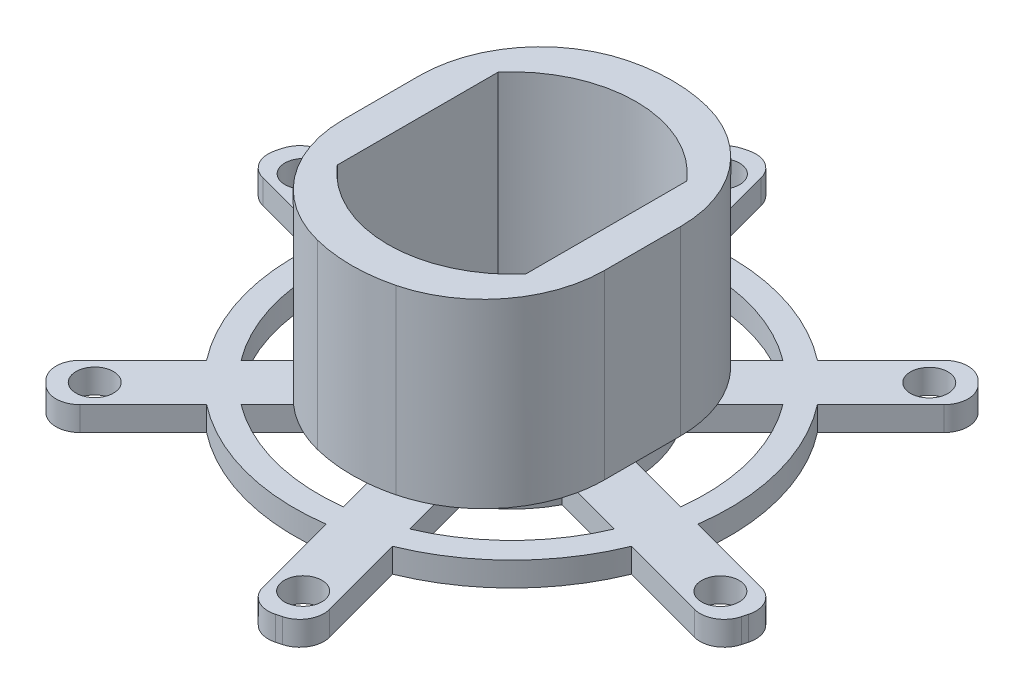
ISO-10303-21;
HEADER;
FILE_DESCRIPTION(('STEP AP214'),'2;1');
FILE_NAME('part.step','',(''),(''),'','','');
FILE_SCHEMA(('AUTOMOTIVE_DESIGN { 1 0 10303 214 1 1 1 1 }'));
ENDSEC;
DATA;
#1=APPLICATION_CONTEXT('core data for automotive mechanical design processes');
#2=APPLICATION_PROTOCOL_DEFINITION('international standard','automotive_design',2000,#1);
#3=PRODUCT_CONTEXT('',#1,'mechanical');
#4=PRODUCT('Part','Part','',(#3));
#5=PRODUCT_RELATED_PRODUCT_CATEGORY('part','',(#4));
#6=PRODUCT_DEFINITION_FORMATION('','',#4);
#7=PRODUCT_DEFINITION_CONTEXT('part definition',#1,'design');
#8=PRODUCT_DEFINITION('design','',#6,#7);
#9=PRODUCT_DEFINITION_SHAPE('','',#8);
#10=(LENGTH_UNIT() NAMED_UNIT(*) SI_UNIT(.MILLI.,.METRE.));
#11=(NAMED_UNIT(*) PLANE_ANGLE_UNIT() SI_UNIT($,.RADIAN.));
#12=(NAMED_UNIT(*) SI_UNIT($,.STERADIAN.) SOLID_ANGLE_UNIT());
#13=UNCERTAINTY_MEASURE_WITH_UNIT(LENGTH_MEASURE(1.E-05),#10,'distance_accuracy_value','');
#14=(GEOMETRIC_REPRESENTATION_CONTEXT(3) GLOBAL_UNCERTAINTY_ASSIGNED_CONTEXT((#13)) GLOBAL_UNIT_ASSIGNED_CONTEXT((#10,
#11,#12)) REPRESENTATION_CONTEXT('',''));
#15=CARTESIAN_POINT('',(0.,0.,0.));
#16=DIRECTION('',(0.,0.,1.));
#17=DIRECTION('',(1.,0.,0.));
#18=AXIS2_PLACEMENT_3D('',#15,#16,#17);
#19=CARTESIAN_POINT('',(0.,0.,0.));
#20=DIRECTION('',(0.,1.,0.));
#21=DIRECTION('',(0.,0.,1.));
#22=AXIS2_PLACEMENT_3D('',#19,#20,#21);
#23=PLANE('',#22);
#24=CARTESIAN_POINT('',(-17.2647521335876,0.,17.2420513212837));
#25=DIRECTION('',(0.,1.,0.));
#26=DIRECTION('',(0.,0.,-1.));
#27=AXIS2_PLACEMENT_3D('',#24,#25,#26);
#28=CIRCLE('',#27,1.54999999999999);
#29=CARTESIAN_POINT('',(-17.2647521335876,0.,15.6920513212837));
#30=VERTEX_POINT('',#29);
#31=EDGE_CURVE('E897',#30,#30,#28,.T.);
#32=ORIENTED_EDGE('',*,*,#31,.F.);
#33=EDGE_LOOP('',(#32));
#34=FACE_BOUND('',#33,.T.);
#35=CARTESIAN_POINT('',(-23.5644305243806,0.,-6.33068827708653));
#36=DIRECTION('',(0.,1.,0.));
#37=DIRECTION('',(0.866025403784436,0.,-0.500000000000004));
#38=AXIS2_PLACEMENT_3D('',#35,#36,#37);
#39=CIRCLE('',#38,1.54999999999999);
#40=CARTESIAN_POINT('',(-22.2220911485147,0.,-7.10568827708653));
#41=VERTEX_POINT('',#40);
#42=EDGE_CURVE('E938',#41,#41,#39,.T.);
#43=ORIENTED_EDGE('',*,*,#42,.F.);
#44=EDGE_LOOP('',(#43));
#45=FACE_BOUND('',#44,.T.);
#46=CARTESIAN_POINT('',(-6.29967839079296,0.,-23.5727395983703));
#47=DIRECTION('',(0.,1.,0.));
#48=DIRECTION('',(0.86602540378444,0.,0.499999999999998));
#49=AXIS2_PLACEMENT_3D('',#46,#47,#48);
#50=CIRCLE('',#49,1.54999999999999);
#51=CARTESIAN_POINT('',(-4.95733901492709,0.,-22.7977395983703));
#52=VERTEX_POINT('',#51);
#53=EDGE_CURVE('E978',#52,#52,#50,.T.);
#54=ORIENTED_EDGE('',*,*,#53,.F.);
#55=EDGE_LOOP('',(#54));
#56=FACE_BOUND('',#55,.T.);
#57=CARTESIAN_POINT('',(23.5644305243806,0.,6.33068827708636));
#58=DIRECTION('',(0.,1.,0.));
#59=DIRECTION('',(-0.866025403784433,0.,0.50000000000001));
#60=AXIS2_PLACEMENT_3D('',#57,#58,#59);
#61=CIRCLE('',#60,1.54999999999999);
#62=CARTESIAN_POINT('',(22.2220911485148,0.,7.10568827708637));
#63=VERTEX_POINT('',#62);
#64=EDGE_CURVE('E818',#63,#63,#61,.T.);
#65=ORIENTED_EDGE('',*,*,#64,.F.);
#66=EDGE_LOOP('',(#65));
#67=FACE_BOUND('',#66,.T.);
#68=CARTESIAN_POINT('',(6.29967839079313,0.,23.5727395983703));
#69=DIRECTION('',(0.,1.,0.));
#70=DIRECTION('',(-0.866025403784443,0.,-0.499999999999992));
#71=AXIS2_PLACEMENT_3D('',#68,#69,#70);
#72=CIRCLE('',#71,1.54999999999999);
#73=CARTESIAN_POINT('',(4.95733901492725,0.,22.7977395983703));
#74=VERTEX_POINT('',#73);
#75=EDGE_CURVE('E857',#74,#74,#72,.T.);
#76=ORIENTED_EDGE('',*,*,#75,.F.);
#77=EDGE_LOOP('',(#76));
#78=FACE_BOUND('',#77,.T.);
#79=CARTESIAN_POINT('',(17.2647521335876,0.,-17.2420513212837));
#80=DIRECTION('',(0.,1.,0.));
#81=DIRECTION('',(0.,0.,1.));
#82=AXIS2_PLACEMENT_3D('',#79,#80,#81);
#83=CIRCLE('',#82,1.54999999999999);
#84=CARTESIAN_POINT('',(17.2647521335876,0.,-15.6920513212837));
#85=VERTEX_POINT('',#84);
#86=EDGE_CURVE('E1130',#85,#85,#83,.T.);
#87=ORIENTED_EDGE('',*,*,#86,.F.);
#88=EDGE_LOOP('',(#87));
#89=FACE_BOUND('',#88,.T.);
#90=DIRECTION('',(0.258819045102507,0.,-0.965925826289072));
#91=VECTOR('',#90,1.);
#92=CARTESIAN_POINT('',(25.7391359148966,0.,9.22615208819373));
#93=LINE('',#92,#91);
#94=CARTESIAN_POINT('',(26.2567740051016,0.,7.29430043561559));
#95=VERTEX_POINT('',#94);
#96=CARTESIAN_POINT('',(26.3861835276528,0.,6.81133752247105));
#97=VERTEX_POINT('',#96);
#98=EDGE_CURVE('E845',#95,#97,#93,.T.);
#99=ORIENTED_EDGE('',*,*,#98,.T.);
#100=CARTESIAN_POINT('',(24.4543318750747,0.,6.29369943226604));
#101=DIRECTION('',(0.,1.,0.));
#102=DIRECTION('',(0.,0.,1.));
#103=AXIS2_PLACEMENT_3D('',#100,#101,#102);
#104=CIRCLE('',#103,2.);
#105=CARTESIAN_POINT('',(24.9719699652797,0.,4.3618477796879));
#106=VERTEX_POINT('',#105);
#107=EDGE_CURVE('E1335',#97,#106,#104,.T.);
#108=ORIENTED_EDGE('',*,*,#107,.T.);
#109=DIRECTION('',(-0.965925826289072,0.,-0.258819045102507));
#110=VECTOR('',#109,1.);
#111=CARTESIAN_POINT('',(26.9038216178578,0.,4.87948586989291));
#112=LINE('',#111,#110);
#113=CARTESIAN_POINT('',(17.832639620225,0.,2.44886997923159));
#114=VERTEX_POINT('',#113);
#115=EDGE_CURVE('E828',#106,#114,#112,.T.);
#116=ORIENTED_EDGE('',*,*,#115,.T.);
#117=CARTESIAN_POINT('',(0.,0.,0.));
#118=DIRECTION('',(0.,1.,0.));
#119=DIRECTION('',(0.,0.,1.));
#120=AXIS2_PLACEMENT_3D('',#117,#118,#119);
#121=CIRCLE('',#120,18.);
#122=CARTESIAN_POINT('',(14.2190839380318,0.,-11.0371034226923));
#123=VERTEX_POINT('',#122);
#124=EDGE_CURVE('E1193',#114,#123,#121,.T.);
#125=ORIENTED_EDGE('',*,*,#124,.T.);
#126=DIRECTION('',(0.707106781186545,0.,-0.707106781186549));
#127=VECTOR('',#126,1.);
#128=CARTESIAN_POINT('',(3.18198051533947,0.,0.));
#129=LINE('',#128,#127);
#130=CARTESIAN_POINT('',(19.44543648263,0.,-16.2634559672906));
#131=VERTEX_POINT('',#130);
#132=EDGE_CURVE('E1154',#123,#131,#129,.T.);
#133=ORIENTED_EDGE('',*,*,#132,.T.);
#134=CARTESIAN_POINT('',(18.0312229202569,0.,-17.6776695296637));
#135=DIRECTION('',(0.,1.,0.));
#136=DIRECTION('',(0.,0.,1.));
#137=AXIS2_PLACEMENT_3D('',#134,#135,#136);
#138=CIRCLE('',#137,2.);
#139=CARTESIAN_POINT('',(19.44543648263,0.,-19.0918830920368));
#140=VERTEX_POINT('',#139);
#141=EDGE_CURVE('E1208',#131,#140,#138,.T.);
#142=ORIENTED_EDGE('',*,*,#141,.T.);
#143=DIRECTION('',(-0.707106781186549,0.,-0.707106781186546));
#144=VECTOR('',#143,1.);
#145=CARTESIAN_POINT('',(20.8596500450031,0.,-17.6776695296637));
#146=LINE('',#145,#144);
#147=CARTESIAN_POINT('',(19.0918830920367,0.,-19.4454364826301));
#148=VERTEX_POINT('',#147);
#149=EDGE_CURVE('E1158',#140,#148,#146,.T.);
#150=ORIENTED_EDGE('',*,*,#149,.T.);
#151=CARTESIAN_POINT('',(17.6776695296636,0.,-18.031222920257));
#152=DIRECTION('',(0.,1.,0.));
#153=DIRECTION('',(0.,0.,1.));
#154=AXIS2_PLACEMENT_3D('',#151,#152,#153);
#155=CIRCLE('',#154,2.);
#156=CARTESIAN_POINT('',(16.2634559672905,0.,-19.4454364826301));
#157=VERTEX_POINT('',#156);
#158=EDGE_CURVE('E1210',#148,#157,#155,.T.);
#159=ORIENTED_EDGE('',*,*,#158,.T.);
#160=DIRECTION('',(-0.707106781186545,0.,0.707106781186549));
#161=VECTOR('',#160,1.);
#162=CARTESIAN_POINT('',(17.6776695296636,0.,-20.8596500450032));
#163=LINE('',#162,#161);
#164=CARTESIAN_POINT('',(11.0371034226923,0.,-14.2190839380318));
#165=VERTEX_POINT('',#164);
#166=EDGE_CURVE('E1140',#157,#165,#163,.T.);
#167=ORIENTED_EDGE('',*,*,#166,.T.);
#168=CARTESIAN_POINT('',(-2.44886997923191,0.,-17.8326396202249));
#169=VERTEX_POINT('',#168);
#170=EDGE_CURVE('E1195',#165,#169,#121,.T.);
#171=ORIENTED_EDGE('',*,*,#170,.T.);
#172=DIRECTION('',(-0.258819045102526,0.,-0.965925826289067));
#173=VECTOR('',#172,1.);
#174=CARTESIAN_POINT('',(1.59099025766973,0.,-2.75567596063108));
#175=LINE('',#174,#173);
#176=CARTESIAN_POINT('',(-4.36184777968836,0.,-24.9719699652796));
#177=VERTEX_POINT('',#176);
#178=EDGE_CURVE('E1002',#169,#177,#175,.T.);
#179=ORIENTED_EDGE('',*,*,#178,.T.);
#180=CARTESIAN_POINT('',(-6.29369943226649,0.,-24.4543318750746));
#181=DIRECTION('',(0.,1.,0.));
#182=DIRECTION('',(0.,0.,1.));
#183=AXIS2_PLACEMENT_3D('',#180,#181,#182);
#184=CIRCLE('',#183,2.);
#185=CARTESIAN_POINT('',(-6.81133752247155,0.,-26.3861835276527));
#186=VERTEX_POINT('',#185);
#187=EDGE_CURVE('E1261',#177,#186,#184,.T.);
#188=ORIENTED_EDGE('',*,*,#187,.T.);
#189=DIRECTION('',(-0.965925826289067,0.,0.258819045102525));
#190=VECTOR('',#189,1.);
#191=CARTESIAN_POINT('',(-4.87948586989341,0.,-26.9038216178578));
#192=LINE('',#191,#190);
#193=CARTESIAN_POINT('',(-7.29430043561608,0.,-26.2567740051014));
#194=VERTEX_POINT('',#193);
#195=EDGE_CURVE('E1007',#186,#194,#192,.T.);
#196=ORIENTED_EDGE('',*,*,#195,.T.);
#197=CARTESIAN_POINT('',(-6.77666234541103,0.,-24.3249223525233));
#198=DIRECTION('',(0.,1.,0.));
#199=DIRECTION('',(0.,0.,1.));
#200=AXIS2_PLACEMENT_3D('',#197,#198,#199);
#201=CIRCLE('',#200,2.);
#202=CARTESIAN_POINT('',(-8.70851399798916,0.,-23.8072842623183));
#203=VERTEX_POINT('',#202);
#204=EDGE_CURVE('E1263',#194,#203,#201,.T.);
#205=ORIENTED_EDGE('',*,*,#204,.T.);
#206=DIRECTION('',(0.258819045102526,0.,0.965925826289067));
#207=VECTOR('',#206,1.);
#208=CARTESIAN_POINT('',(-9.22615208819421,0.,-25.7391359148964));
#209=LINE('',#208,#207);
#210=CARTESIAN_POINT('',(-6.79553619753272,0.,-16.6679539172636));
#211=VERTEX_POINT('',#210);
#212=EDGE_CURVE('E988',#203,#211,#209,.T.);
#213=ORIENTED_EDGE('',*,*,#212,.T.);
#214=CARTESIAN_POINT('',(-16.6679539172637,0.,-6.79553619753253));
#215=VERTEX_POINT('',#214);
#216=EDGE_CURVE('E1198',#211,#215,#121,.T.);
#217=ORIENTED_EDGE('',*,*,#216,.T.);
#218=DIRECTION('',(-0.96592582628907,0.,-0.258819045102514));
#219=VECTOR('',#218,1.);
#220=CARTESIAN_POINT('',(-1.59099025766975,0.,-2.75567596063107));
#221=LINE('',#220,#219);
#222=CARTESIAN_POINT('',(-23.8072842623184,0.,-8.70851399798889));
#223=VERTEX_POINT('',#222);
#224=EDGE_CURVE('E962',#215,#223,#221,.T.);
#225=ORIENTED_EDGE('',*,*,#224,.T.);
#226=CARTESIAN_POINT('',(-24.3249223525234,0.,-6.77666234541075));
#227=DIRECTION('',(0.,1.,0.));
#228=DIRECTION('',(0.,0.,1.));
#229=AXIS2_PLACEMENT_3D('',#226,#227,#228);
#230=CIRCLE('',#229,2.);
#231=CARTESIAN_POINT('',(-26.2567740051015,0.,-7.29430043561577));
#232=VERTEX_POINT('',#231);
#233=EDGE_CURVE('E1279',#223,#232,#230,.T.);
#234=ORIENTED_EDGE('',*,*,#233,.T.);
#235=DIRECTION('',(-0.258819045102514,0.,0.96592582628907));
#236=VECTOR('',#235,1.);
#237=CARTESIAN_POINT('',(-25.7391359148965,0.,-9.22615208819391));
#238=LINE('',#237,#236);
#239=CARTESIAN_POINT('',(-26.3861835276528,0.,-6.81133752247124));
#240=VERTEX_POINT('',#239);
#241=EDGE_CURVE('E966',#232,#240,#238,.T.);
#242=ORIENTED_EDGE('',*,*,#241,.T.);
#243=CARTESIAN_POINT('',(-24.4543318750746,0.,-6.29369943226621));
#244=DIRECTION('',(0.,1.,0.));
#245=DIRECTION('',(0.,0.,1.));
#246=AXIS2_PLACEMENT_3D('',#243,#244,#245);
#247=CIRCLE('',#246,2.);
#248=CARTESIAN_POINT('',(-24.9719699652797,0.,-4.36184777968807));
#249=VERTEX_POINT('',#248);
#250=EDGE_CURVE('E1281',#240,#249,#247,.T.);
#251=ORIENTED_EDGE('',*,*,#250,.T.);
#252=DIRECTION('',(0.96592582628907,0.,0.258819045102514));
#253=VECTOR('',#252,1.);
#254=CARTESIAN_POINT('',(-26.9038216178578,0.,-4.8794858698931));
#255=LINE('',#254,#253);
#256=CARTESIAN_POINT('',(-17.832639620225,0.,-2.44886997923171));
#257=VERTEX_POINT('',#256);
#258=EDGE_CURVE('E948',#249,#257,#255,.T.);
#259=ORIENTED_EDGE('',*,*,#258,.T.);
#260=CARTESIAN_POINT('',(-14.2190839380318,0.,11.0371034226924));
#261=VERTEX_POINT('',#260);
#262=EDGE_CURVE('E1713',#257,#261,#121,.T.);
#263=ORIENTED_EDGE('',*,*,#262,.T.);
#264=DIRECTION('',(-0.707106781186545,0.,0.707106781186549));
#265=VECTOR('',#264,1.);
#266=CARTESIAN_POINT('',(-3.18198051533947,0.,0.));
#267=LINE('',#266,#265);
#268=CARTESIAN_POINT('',(-19.44543648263,0.,16.2634559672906));
#269=VERTEX_POINT('',#268);
#270=EDGE_CURVE('E921',#261,#269,#267,.T.);
#271=ORIENTED_EDGE('',*,*,#270,.T.);
#272=CARTESIAN_POINT('',(-18.0312229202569,0.,17.6776695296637));
#273=DIRECTION('',(0.,1.,0.));
#274=DIRECTION('',(0.,0.,1.));
#275=AXIS2_PLACEMENT_3D('',#272,#273,#274);
#276=CIRCLE('',#275,2.);
#277=CARTESIAN_POINT('',(-19.44543648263,0.,19.0918830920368));
#278=VERTEX_POINT('',#277);
#279=EDGE_CURVE('E1297',#269,#278,#276,.T.);
#280=ORIENTED_EDGE('',*,*,#279,.T.);
#281=DIRECTION('',(0.707106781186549,0.,0.707106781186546));
#282=VECTOR('',#281,1.);
#283=CARTESIAN_POINT('',(-20.8596500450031,0.,17.6776695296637));
#284=LINE('',#283,#282);
#285=CARTESIAN_POINT('',(-19.0918830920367,0.,19.4454364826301));
#286=VERTEX_POINT('',#285);
#287=EDGE_CURVE('E925',#278,#286,#284,.T.);
#288=ORIENTED_EDGE('',*,*,#287,.T.);
#289=CARTESIAN_POINT('',(-17.6776695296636,0.,18.031222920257));
#290=DIRECTION('',(0.,1.,0.));
#291=DIRECTION('',(0.,0.,1.));
#292=AXIS2_PLACEMENT_3D('',#289,#290,#291);
#293=CIRCLE('',#292,2.);
#294=CARTESIAN_POINT('',(-16.2634559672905,0.,19.4454364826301));
#295=VERTEX_POINT('',#294);
#296=EDGE_CURVE('E1299',#286,#295,#293,.T.);
#297=ORIENTED_EDGE('',*,*,#296,.T.);
#298=DIRECTION('',(0.707106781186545,0.,-0.707106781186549));
#299=VECTOR('',#298,1.);
#300=CARTESIAN_POINT('',(-17.6776695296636,0.,20.8596500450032));
#301=LINE('',#300,#299);
#302=CARTESIAN_POINT('',(-11.0371034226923,0.,14.2190839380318));
#303=VERTEX_POINT('',#302);
#304=EDGE_CURVE('E907',#295,#303,#301,.T.);
#305=ORIENTED_EDGE('',*,*,#304,.T.);
#306=CARTESIAN_POINT('',(2.44886997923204,0.,17.8326396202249));
#307=VERTEX_POINT('',#306);
#308=EDGE_CURVE('E3042',#303,#307,#121,.T.);
#309=ORIENTED_EDGE('',*,*,#308,.T.);
#310=DIRECTION('',(0.258819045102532,0.,0.965925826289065));
#311=VECTOR('',#310,1.);
#312=CARTESIAN_POINT('',(-1.59099025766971,0.,2.75567596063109));
#313=LINE('',#312,#311);
#314=CARTESIAN_POINT('',(4.36184777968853,0.,24.9719699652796));
#315=VERTEX_POINT('',#314);
#316=EDGE_CURVE('E881',#307,#315,#313,.T.);
#317=ORIENTED_EDGE('',*,*,#316,.T.);
#318=CARTESIAN_POINT('',(6.29369943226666,0.,24.4543318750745));
#319=DIRECTION('',(0.,1.,0.));
#320=DIRECTION('',(0.,0.,1.));
#321=AXIS2_PLACEMENT_3D('',#318,#319,#320);
#322=CIRCLE('',#321,2.);
#323=CARTESIAN_POINT('',(6.81133752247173,0.,26.3861835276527));
#324=VERTEX_POINT('',#323);
#325=EDGE_CURVE('E1315',#315,#324,#322,.T.);
#326=ORIENTED_EDGE('',*,*,#325,.T.);
#327=DIRECTION('',(0.965925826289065,0.,-0.258819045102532));
#328=VECTOR('',#327,1.);
#329=CARTESIAN_POINT('',(4.8794858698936,0.,26.9038216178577));
#330=LINE('',#329,#328);
#331=CARTESIAN_POINT('',(7.29430043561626,0.,26.2567740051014));
#332=VERTEX_POINT('',#331);
#333=EDGE_CURVE('E885',#324,#332,#330,.T.);
#334=ORIENTED_EDGE('',*,*,#333,.T.);
#335=CARTESIAN_POINT('',(6.7766623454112,0.,24.3249223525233));
#336=DIRECTION('',(0.,1.,0.));
#337=DIRECTION('',(0.,0.,1.));
#338=AXIS2_PLACEMENT_3D('',#335,#336,#337);
#339=CIRCLE('',#338,2.);
#340=CARTESIAN_POINT('',(8.70851399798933,0.,23.8072842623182));
#341=VERTEX_POINT('',#340);
#342=EDGE_CURVE('E1317',#332,#341,#339,.T.);
#343=ORIENTED_EDGE('',*,*,#342,.T.);
#344=DIRECTION('',(-0.258819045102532,0.,-0.965925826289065));
#345=VECTOR('',#344,1.);
#346=CARTESIAN_POINT('',(9.22615208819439,0.,25.7391359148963));
#347=LINE('',#346,#345);
#348=CARTESIAN_POINT('',(6.79553619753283,0.,16.6679539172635));
#349=VERTEX_POINT('',#348);
#350=EDGE_CURVE('E867',#341,#349,#347,.T.);
#351=ORIENTED_EDGE('',*,*,#350,.T.);
#352=CARTESIAN_POINT('',(16.6679539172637,0.,6.79553619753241));
#353=VERTEX_POINT('',#352);
#354=EDGE_CURVE('E3041',#349,#353,#121,.T.);
#355=ORIENTED_EDGE('',*,*,#354,.T.);
#356=DIRECTION('',(0.965925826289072,0.,0.258819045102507));
#357=VECTOR('',#356,1.);
#358=CARTESIAN_POINT('',(1.59099025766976,0.,2.75567596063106));
#359=LINE('',#358,#357);
#360=CARTESIAN_POINT('',(23.8072842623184,0.,8.70851399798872));
#361=VERTEX_POINT('',#360);
#362=EDGE_CURVE('E841',#353,#361,#359,.T.);
#363=ORIENTED_EDGE('',*,*,#362,.T.);
#364=CARTESIAN_POINT('',(24.3249223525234,0.,6.77666234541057));
#365=DIRECTION('',(0.,1.,0.));
#366=DIRECTION('',(0.,0.,1.));
#367=AXIS2_PLACEMENT_3D('',#364,#365,#366);
#368=CIRCLE('',#367,2.);
#369=EDGE_CURVE('E1333',#361,#95,#368,.T.);
#370=ORIENTED_EDGE('',*,*,#369,.T.);
#371=EDGE_LOOP('',(#99,#108,#116,#125,#133,#142,#150,#159,#167,#171,#179,#188,#196,#205,#213,
#217,#225,#234,#242,#251,#259,#263,#271,#280,#288,#297,#305,#309,#317,#326,#334,#343,#351,#355,
#363,#370));
#372=FACE_BOUND('',#371,.T.);
#373=CARTESIAN_POINT('',(-6.27328739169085,0.,-14.7188948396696));
#374=VERTEX_POINT('',#373);
#375=CARTESIAN_POINT('',(-5.53368121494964,0.,-11.9586470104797));
#376=VERTEX_POINT('',#375);
#377=EDGE_CURVE('E1012',#374,#376,#209,.T.);
#378=ORIENTED_EDGE('',*,*,#377,.T.);
#379=CARTESIAN_POINT('',(-0.800000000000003,0.,-3.15));
#380=DIRECTION('',(0.,1.,0.));
#381=DIRECTION('',(0.,0.,1.));
#382=AXIS2_PLACEMENT_3D('',#379,#380,#381);
#383=CIRCLE('',#382,10.);
#384=CARTESIAN_POINT('',(-3.26153846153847,0.,-12.8423076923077));
#385=VERTEX_POINT('',#384);
#386=EDGE_CURVE('E1395',#376,#385,#383,.F.);
#387=ORIENTED_EDGE('',*,*,#386,.T.);
#388=CARTESIAN_POINT('',(0.,0.,0.));
#389=DIRECTION('',(0.,1.,0.));
#390=DIRECTION('',(0.,0.,1.));
#391=AXIS2_PLACEMENT_3D('',#388,#389,#390);
#392=CIRCLE('',#391,13.25);
#393=CARTESIAN_POINT('',(-1.20621335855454,0.,-13.1949819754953));
#394=VERTEX_POINT('',#393);
#395=EDGE_CURVE('E737',#394,#385,#392,.T.);
#396=ORIENTED_EDGE('',*,*,#395,.F.);
#397=CARTESIAN_POINT('',(-1.92662117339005,0.,-15.883580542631));
#398=VERTEX_POINT('',#397);
#399=EDGE_CURVE('E1005',#394,#398,#175,.T.);
#400=ORIENTED_EDGE('',*,*,#399,.T.);
#401=CARTESIAN_POINT('',(0.,0.,0.));
#402=DIRECTION('',(0.,1.,0.));
#403=DIRECTION('',(0.,0.,1.));
#404=AXIS2_PLACEMENT_3D('',#401,#402,#403);
#405=CIRCLE('',#404,16.);
#406=CARTESIAN_POINT('',(9.61029315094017,0.,-12.7922736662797));
#407=VERTEX_POINT('',#406);
#408=EDGE_CURVE('E1190',#407,#398,#405,.T.);
#409=ORIENTED_EDGE('',*,*,#408,.F.);
#410=CARTESIAN_POINT('',(7.44283061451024,0.,-10.6248111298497));
#411=VERTEX_POINT('',#410);
#412=EDGE_CURVE('E1165',#407,#411,#163,.T.);
#413=ORIENTED_EDGE('',*,*,#412,.T.);
#414=CARTESIAN_POINT('',(0.799999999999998,0.,-3.15));
#415=DIRECTION('',(0.,1.,0.));
#416=DIRECTION('',(0.,0.,1.));
#417=AXIS2_PLACEMENT_3D('',#414,#415,#416);
#418=CIRCLE('',#417,10.);
#419=CARTESIAN_POINT('',(10.0736240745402,0.,-6.89164355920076));
#420=VERTEX_POINT('',#419);
#421=EDGE_CURVE('E1397',#411,#420,#418,.F.);
#422=ORIENTED_EDGE('',*,*,#421,.T.);
#423=CARTESIAN_POINT('',(12.7922736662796,0.,-9.61029315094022));
#424=VERTEX_POINT('',#423);
#425=EDGE_CURVE('E1160',#420,#424,#129,.T.);
#426=ORIENTED_EDGE('',*,*,#425,.T.);
#427=CARTESIAN_POINT('',(15.883580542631,0.,1.92662117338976));
#428=VERTEX_POINT('',#427);
#429=EDGE_CURVE('E1178',#428,#424,#405,.T.);
#430=ORIENTED_EDGE('',*,*,#429,.F.);
#431=CARTESIAN_POINT('',(10.8,0.,0.564479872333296));
#432=VERTEX_POINT('',#431);
#433=EDGE_CURVE('E851',#428,#432,#112,.T.);
#434=ORIENTED_EDGE('',*,*,#433,.T.);
#435=DIRECTION('',(0.,0.,-1.));
#436=VECTOR('',#435,1.);
#437=CARTESIAN_POINT('',(10.8,0.,7.67609926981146));
#438=LINE('',#437,#436);
#439=CARTESIAN_POINT('',(10.8,0.,3.15));
#440=VERTEX_POINT('',#439);
#441=EDGE_CURVE('E773',#440,#432,#438,.T.);
#442=ORIENTED_EDGE('',*,*,#441,.F.);
#443=CARTESIAN_POINT('',(0.799999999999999,0.,3.15));
#444=DIRECTION('',(0.,1.,0.));
#445=DIRECTION('',(0.,0.,1.));
#446=AXIS2_PLACEMENT_3D('',#443,#444,#445);
#447=CIRCLE('',#446,10.);
#448=CARTESIAN_POINT('',(10.5942485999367,0.,5.16809176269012));
#449=VERTEX_POINT('',#448);
#450=EDGE_CURVE('E57',#440,#449,#447,.F.);
#451=ORIENTED_EDGE('',*,*,#450,.T.);
#452=CARTESIAN_POINT('',(14.7188948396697,0.,6.27328739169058));
#453=VERTEX_POINT('',#452);
#454=EDGE_CURVE('E71',#449,#453,#359,.T.);
#455=ORIENTED_EDGE('',*,*,#454,.T.);
#456=CARTESIAN_POINT('',(6.27328739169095,0.,14.7188948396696));
#457=VERTEX_POINT('',#456);
#458=EDGE_CURVE('E1639',#457,#453,#405,.T.);
#459=ORIENTED_EDGE('',*,*,#458,.F.);
#460=CARTESIAN_POINT('',(5.53368121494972,0.,11.9586470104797));
#461=VERTEX_POINT('',#460);
#462=EDGE_CURVE('E63',#457,#461,#347,.T.);
#463=ORIENTED_EDGE('',*,*,#462,.T.);
#464=CARTESIAN_POINT('',(0.799999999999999,0.,3.15));
#465=DIRECTION('',(0.,1.,0.));
#466=DIRECTION('',(0.,0.,1.));
#467=AXIS2_PLACEMENT_3D('',#464,#465,#466);
#468=CIRCLE('',#467,10.);
#469=CARTESIAN_POINT('',(3.26153846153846,0.,12.8423076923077));
#470=VERTEX_POINT('',#469);
#471=EDGE_CURVE('E12',#461,#470,#468,.F.);
#472=ORIENTED_EDGE('',*,*,#471,.T.);
#473=CARTESIAN_POINT('',(0.,0.,0.));
#474=DIRECTION('',(0.,1.,0.));
#475=DIRECTION('',(0.,0.,1.));
#476=AXIS2_PLACEMENT_3D('',#473,#474,#475);
#477=CIRCLE('',#476,13.25);
#478=CARTESIAN_POINT('',(1.20621335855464,0.,13.1949819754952));
#479=VERTEX_POINT('',#478);
#480=EDGE_CURVE('E788',#479,#470,#477,.T.);
#481=ORIENTED_EDGE('',*,*,#480,.F.);
#482=CARTESIAN_POINT('',(1.92662117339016,0.,15.883580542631));
#483=VERTEX_POINT('',#482);
#484=EDGE_CURVE('E887',#479,#483,#313,.T.);
#485=ORIENTED_EDGE('',*,*,#484,.T.);
#486=CARTESIAN_POINT('',(-9.61029315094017,0.,12.7922736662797));
#487=VERTEX_POINT('',#486);
#488=EDGE_CURVE('E1662',#487,#483,#405,.T.);
#489=ORIENTED_EDGE('',*,*,#488,.F.);
#490=CARTESIAN_POINT('',(-7.44283061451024,0.,10.6248111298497));
#491=VERTEX_POINT('',#490);
#492=EDGE_CURVE('E932',#487,#491,#301,.T.);
#493=ORIENTED_EDGE('',*,*,#492,.T.);
#494=CARTESIAN_POINT('',(-0.800000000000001,0.,3.15));
#495=DIRECTION('',(0.,1.,0.));
#496=DIRECTION('',(0.,0.,1.));
#497=AXIS2_PLACEMENT_3D('',#494,#495,#496);
#498=CIRCLE('',#497,10.);
#499=CARTESIAN_POINT('',(-10.0736240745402,0.,6.89164355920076));
#500=VERTEX_POINT('',#499);
#501=EDGE_CURVE('E1389',#491,#500,#498,.F.);
#502=ORIENTED_EDGE('',*,*,#501,.T.);
#503=CARTESIAN_POINT('',(-12.7922736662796,0.,9.61029315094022));
#504=VERTEX_POINT('',#503);
#505=EDGE_CURVE('E927',#500,#504,#267,.T.);
#506=ORIENTED_EDGE('',*,*,#505,.T.);
#507=CARTESIAN_POINT('',(-15.883580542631,0.,-1.92662117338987));
#508=VERTEX_POINT('',#507);
#509=EDGE_CURVE('E1664',#508,#504,#405,.T.);
#510=ORIENTED_EDGE('',*,*,#509,.F.);
#511=CARTESIAN_POINT('',(-10.8,0.,-0.564479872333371));
#512=VERTEX_POINT('',#511);
#513=EDGE_CURVE('E973',#508,#512,#255,.T.);
#514=ORIENTED_EDGE('',*,*,#513,.T.);
#515=DIRECTION('',(0.,0.,1.));
#516=VECTOR('',#515,1.);
#517=CARTESIAN_POINT('',(-10.8,0.,-7.67609926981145));
#518=LINE('',#517,#516);
#519=CARTESIAN_POINT('',(-10.8,0.,-3.15));
#520=VERTEX_POINT('',#519);
#521=EDGE_CURVE('E786',#520,#512,#518,.T.);
#522=ORIENTED_EDGE('',*,*,#521,.F.);
#523=CARTESIAN_POINT('',(-0.800000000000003,0.,-3.15));
#524=DIRECTION('',(0.,1.,0.));
#525=DIRECTION('',(0.,0.,1.));
#526=AXIS2_PLACEMENT_3D('',#523,#524,#525);
#527=CIRCLE('',#526,10.);
#528=CARTESIAN_POINT('',(-10.5942485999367,0.,-5.1680917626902));
#529=VERTEX_POINT('',#528);
#530=EDGE_CURVE('E1392',#520,#529,#527,.F.);
#531=ORIENTED_EDGE('',*,*,#530,.T.);
#532=CARTESIAN_POINT('',(-14.7188948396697,0.,-6.27328739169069));
#533=VERTEX_POINT('',#532);
#534=EDGE_CURVE('E968',#529,#533,#221,.T.);
#535=ORIENTED_EDGE('',*,*,#534,.T.);
#536=EDGE_CURVE('E1194',#374,#533,#405,.T.);
#537=ORIENTED_EDGE('',*,*,#536,.F.);
#538=EDGE_LOOP('',(#378,#387,#396,#400,#409,#413,#422,#426,#430,#434,#442,#451,#455,#459,#463,
#472,#481,#485,#489,#493,#502,#506,#510,#514,#522,#531,#535,#537));
#539=FACE_BOUND('',#538,.T.);
#540=ADVANCED_FACE('F49',(#34,#45,#56,#67,#78,#89,#372,#539),#23,.T.);
#541=CARTESIAN_POINT('',(0.,-2.,0.));
#542=DIRECTION('',(0.,1.,0.));
#543=DIRECTION('',(0.,0.,1.));
#544=AXIS2_PLACEMENT_3D('',#541,#542,#543);
#545=CYLINDRICAL_SURFACE('',#544,16.);
#546=CARTESIAN_POINT('',(0.,-2.,0.));
#547=DIRECTION('',(0.,1.,0.));
#548=DIRECTION('',(0.,0.,1.));
#549=AXIS2_PLACEMENT_3D('',#546,#547,#548);
#550=CIRCLE('',#549,16.);
#551=CARTESIAN_POINT('',(-6.27328739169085,-2.,-14.7188948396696));
#552=VERTEX_POINT('',#551);
#553=CARTESIAN_POINT('',(-14.7188948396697,-2.,-6.27328739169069));
#554=VERTEX_POINT('',#553);
#555=EDGE_CURVE('E1183',#552,#554,#550,.T.);
#556=ORIENTED_EDGE('',*,*,#555,.F.);
#557=DIRECTION('',(0.,1.,0.));
#558=VECTOR('',#557,1.);
#559=CARTESIAN_POINT('',(-6.27328739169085,-2.,-14.7188948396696));
#560=LINE('',#559,#558);
#561=EDGE_CURVE('E1102',#552,#374,#560,.T.);
#562=ORIENTED_EDGE('',*,*,#561,.T.);
#563=ORIENTED_EDGE('',*,*,#536,.T.);
#564=DIRECTION('',(0.,1.,0.));
#565=VECTOR('',#564,1.);
#566=CARTESIAN_POINT('',(-14.7188948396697,-2.,-6.27328739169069));
#567=LINE('',#566,#565);
#568=EDGE_CURVE('E1076',#533,#554,#567,.F.);
#569=ORIENTED_EDGE('',*,*,#568,.T.);
#570=EDGE_LOOP('',(#556,#562,#563,#569));
#571=FACE_BOUND('',#570,.T.);
#572=ADVANCED_FACE('F1557',(#571),#545,.F.);
#573=CARTESIAN_POINT('',(-15.883580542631,-2.,-1.92662117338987));
#574=VERTEX_POINT('',#573);
#575=CARTESIAN_POINT('',(-12.7922736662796,-2.,9.61029315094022));
#576=VERTEX_POINT('',#575);
#577=EDGE_CURVE('E1645',#574,#576,#550,.T.);
#578=ORIENTED_EDGE('',*,*,#577,.F.);
#579=DIRECTION('',(0.,1.,0.));
#580=VECTOR('',#579,1.);
#581=CARTESIAN_POINT('',(-15.883580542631,-2.,-1.92662117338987));
#582=LINE('',#581,#580);
#583=EDGE_CURVE('E1085',#574,#508,#582,.T.);
#584=ORIENTED_EDGE('',*,*,#583,.T.);
#585=ORIENTED_EDGE('',*,*,#509,.T.);
#586=DIRECTION('',(0.,1.,0.));
#587=VECTOR('',#586,1.);
#588=CARTESIAN_POINT('',(-12.7922736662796,-2.,9.61029315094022));
#589=LINE('',#588,#587);
#590=EDGE_CURVE('E1058',#504,#576,#589,.F.);
#591=ORIENTED_EDGE('',*,*,#590,.T.);
#592=EDGE_LOOP('',(#578,#584,#585,#591));
#593=FACE_BOUND('',#592,.T.);
#594=ADVANCED_FACE('F1563',(#593),#545,.F.);
#595=CARTESIAN_POINT('',(-9.61029315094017,-2.,12.7922736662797));
#596=VERTEX_POINT('',#595);
#597=CARTESIAN_POINT('',(1.92662117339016,-2.,15.883580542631));
#598=VERTEX_POINT('',#597);
#599=EDGE_CURVE('E1643',#596,#598,#550,.T.);
#600=ORIENTED_EDGE('',*,*,#599,.F.);
#601=DIRECTION('',(0.,1.,0.));
#602=VECTOR('',#601,1.);
#603=CARTESIAN_POINT('',(-9.61029315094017,-2.,12.7922736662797));
#604=LINE('',#603,#602);
#605=EDGE_CURVE('E1067',#596,#487,#604,.T.);
#606=ORIENTED_EDGE('',*,*,#605,.T.);
#607=ORIENTED_EDGE('',*,*,#488,.T.);
#608=DIRECTION('',(0.,1.,0.));
#609=VECTOR('',#608,1.);
#610=CARTESIAN_POINT('',(1.92662117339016,-2.,15.883580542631));
#611=LINE('',#610,#609);
#612=EDGE_CURVE('E1040',#483,#598,#611,.F.);
#613=ORIENTED_EDGE('',*,*,#612,.T.);
#614=EDGE_LOOP('',(#600,#606,#607,#613));
#615=FACE_BOUND('',#614,.T.);
#616=ADVANCED_FACE('F2808',(#615),#545,.F.);
#617=CARTESIAN_POINT('',(6.27328739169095,-2.,14.7188948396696));
#618=VERTEX_POINT('',#617);
#619=CARTESIAN_POINT('',(14.7188948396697,-2.,6.27328739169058));
#620=VERTEX_POINT('',#619);
#621=EDGE_CURVE('E1638',#618,#620,#550,.T.);
#622=ORIENTED_EDGE('',*,*,#621,.F.);
#623=DIRECTION('',(0.,1.,0.));
#624=VECTOR('',#623,1.);
#625=CARTESIAN_POINT('',(6.27328739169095,-2.,14.7188948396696));
#626=LINE('',#625,#624);
#627=EDGE_CURVE('E1049',#618,#457,#626,.T.);
#628=ORIENTED_EDGE('',*,*,#627,.T.);
#629=ORIENTED_EDGE('',*,*,#458,.T.);
#630=DIRECTION('',(0.,1.,0.));
#631=VECTOR('',#630,1.);
#632=CARTESIAN_POINT('',(14.7188948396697,-2.,6.27328739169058));
#633=LINE('',#632,#631);
#634=EDGE_CURVE('E1019',#453,#620,#633,.F.);
#635=ORIENTED_EDGE('',*,*,#634,.T.);
#636=EDGE_LOOP('',(#622,#628,#629,#635));
#637=FACE_BOUND('',#636,.T.);
#638=ADVANCED_FACE('F1637',(#637),#545,.F.);
#639=CARTESIAN_POINT('',(15.883580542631,-2.,1.92662117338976));
#640=VERTEX_POINT('',#639);
#641=CARTESIAN_POINT('',(12.7922736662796,-2.,-9.61029315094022));
#642=VERTEX_POINT('',#641);
#643=EDGE_CURVE('E1184',#640,#642,#550,.T.);
#644=ORIENTED_EDGE('',*,*,#643,.F.);
#645=DIRECTION('',(0.,1.,0.));
#646=VECTOR('',#645,1.);
#647=CARTESIAN_POINT('',(15.883580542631,-2.,1.92662117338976));
#648=LINE('',#647,#646);
#649=EDGE_CURVE('E1028',#640,#428,#648,.T.);
#650=ORIENTED_EDGE('',*,*,#649,.T.);
#651=ORIENTED_EDGE('',*,*,#429,.T.);
#652=DIRECTION('',(0.,1.,0.));
#653=VECTOR('',#652,1.);
#654=CARTESIAN_POINT('',(12.7922736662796,-2.,-9.61029315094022));
#655=LINE('',#654,#653);
#656=EDGE_CURVE('E1169',#424,#642,#655,.F.);
#657=ORIENTED_EDGE('',*,*,#656,.T.);
#658=EDGE_LOOP('',(#644,#650,#651,#657));
#659=FACE_BOUND('',#658,.T.);
#660=ADVANCED_FACE('F1660',(#659),#545,.F.);
#661=CARTESIAN_POINT('',(0.,-2.,0.));
#662=DIRECTION('',(0.,1.,0.));
#663=DIRECTION('',(0.,0.,1.));
#664=AXIS2_PLACEMENT_3D('',#661,#662,#663);
#665=CYLINDRICAL_SURFACE('',#664,18.);
#666=DIRECTION('',(0.,1.,0.));
#667=VECTOR('',#666,1.);
#668=CARTESIAN_POINT('',(-6.79553619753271,-2.,-16.6679539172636));
#669=LINE('',#668,#667);
#670=CARTESIAN_POINT('',(-6.79553619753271,-2.,-16.6679539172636));
#671=VERTEX_POINT('',#670);
#672=EDGE_CURVE('E1099',#671,#211,#669,.T.);
#673=ORIENTED_EDGE('',*,*,#672,.F.);
#674=CARTESIAN_POINT('',(0.,-2.,0.));
#675=DIRECTION('',(0.,1.,0.));
#676=DIRECTION('',(0.,0.,1.));
#677=AXIS2_PLACEMENT_3D('',#674,#675,#676);
#678=CIRCLE('',#677,18.);
#679=CARTESIAN_POINT('',(-16.6679539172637,-2.,-6.79553619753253));
#680=VERTEX_POINT('',#679);
#681=EDGE_CURVE('E1189',#671,#680,#678,.T.);
#682=ORIENTED_EDGE('',*,*,#681,.T.);
#683=DIRECTION('',(0.,1.,0.));
#684=VECTOR('',#683,1.);
#685=CARTESIAN_POINT('',(-16.6679539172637,-2.,-6.79553619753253));
#686=LINE('',#685,#684);
#687=EDGE_CURVE('E1073',#215,#680,#686,.F.);
#688=ORIENTED_EDGE('',*,*,#687,.F.);
#689=ORIENTED_EDGE('',*,*,#216,.F.);
#690=EDGE_LOOP('',(#673,#682,#688,#689));
#691=FACE_BOUND('',#690,.T.);
#692=ADVANCED_FACE('F1584',(#691),#665,.T.);
#693=DIRECTION('',(0.,1.,0.));
#694=VECTOR('',#693,1.);
#695=CARTESIAN_POINT('',(-17.832639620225,-2.,-2.44886997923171));
#696=LINE('',#695,#694);
#697=CARTESIAN_POINT('',(-17.832639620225,-2.,-2.44886997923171));
#698=VERTEX_POINT('',#697);
#699=EDGE_CURVE('E1082',#698,#257,#696,.T.);
#700=ORIENTED_EDGE('',*,*,#699,.F.);
#701=CARTESIAN_POINT('',(-14.2190839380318,-2.,11.0371034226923));
#702=VERTEX_POINT('',#701);
#703=EDGE_CURVE('E1712',#698,#702,#678,.T.);
#704=ORIENTED_EDGE('',*,*,#703,.T.);
#705=DIRECTION('',(0.,1.,0.));
#706=VECTOR('',#705,1.);
#707=CARTESIAN_POINT('',(-14.2190839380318,-2.,11.0371034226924));
#708=LINE('',#707,#706);
#709=EDGE_CURVE('E1055',#261,#702,#708,.F.);
#710=ORIENTED_EDGE('',*,*,#709,.F.);
#711=ORIENTED_EDGE('',*,*,#262,.F.);
#712=EDGE_LOOP('',(#700,#704,#710,#711));
#713=FACE_BOUND('',#712,.T.);
#714=ADVANCED_FACE('F1711',(#713),#665,.T.);
#715=DIRECTION('',(0.,1.,0.));
#716=VECTOR('',#715,1.);
#717=CARTESIAN_POINT('',(-11.0371034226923,-2.,14.2190839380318));
#718=LINE('',#717,#716);
#719=CARTESIAN_POINT('',(-11.0371034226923,-2.,14.2190839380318));
#720=VERTEX_POINT('',#719);
#721=EDGE_CURVE('E1064',#720,#303,#718,.T.);
#722=ORIENTED_EDGE('',*,*,#721,.F.);
#723=CARTESIAN_POINT('',(2.44886997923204,-2.,17.8326396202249));
#724=VERTEX_POINT('',#723);
#725=EDGE_CURVE('E1716',#720,#724,#678,.T.);
#726=ORIENTED_EDGE('',*,*,#725,.T.);
#727=DIRECTION('',(0.,1.,0.));
#728=VECTOR('',#727,1.);
#729=CARTESIAN_POINT('',(2.44886997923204,-2.,17.8326396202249));
#730=LINE('',#729,#728);
#731=EDGE_CURVE('E1037',#307,#724,#730,.F.);
#732=ORIENTED_EDGE('',*,*,#731,.F.);
#733=ORIENTED_EDGE('',*,*,#308,.F.);
#734=EDGE_LOOP('',(#722,#726,#732,#733));
#735=FACE_BOUND('',#734,.T.);
#736=ADVANCED_FACE('F2774',(#735),#665,.T.);
#737=DIRECTION('',(0.,1.,0.));
#738=VECTOR('',#737,1.);
#739=CARTESIAN_POINT('',(6.79553619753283,-2.,16.6679539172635));
#740=LINE('',#739,#738);
#741=CARTESIAN_POINT('',(6.79553619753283,-2.,16.6679539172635));
#742=VERTEX_POINT('',#741);
#743=EDGE_CURVE('E1046',#742,#349,#740,.T.);
#744=ORIENTED_EDGE('',*,*,#743,.F.);
#745=CARTESIAN_POINT('',(16.6679539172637,-2.,6.79553619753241));
#746=VERTEX_POINT('',#745);
#747=EDGE_CURVE('E1717',#742,#746,#678,.T.);
#748=ORIENTED_EDGE('',*,*,#747,.T.);
#749=DIRECTION('',(0.,1.,0.));
#750=VECTOR('',#749,1.);
#751=CARTESIAN_POINT('',(16.6679539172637,-2.,6.79553619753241));
#752=LINE('',#751,#750);
#753=EDGE_CURVE('E1016',#353,#746,#752,.F.);
#754=ORIENTED_EDGE('',*,*,#753,.F.);
#755=ORIENTED_EDGE('',*,*,#354,.F.);
#756=EDGE_LOOP('',(#744,#748,#754,#755));
#757=FACE_BOUND('',#756,.T.);
#758=ADVANCED_FACE('F2767',(#757),#665,.T.);
#759=DIRECTION('',(0.,1.,0.));
#760=VECTOR('',#759,1.);
#761=CARTESIAN_POINT('',(17.832639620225,-2.,2.44886997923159));
#762=LINE('',#761,#760);
#763=CARTESIAN_POINT('',(17.832639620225,-2.,2.44886997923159));
#764=VERTEX_POINT('',#763);
#765=EDGE_CURVE('E1025',#764,#114,#762,.T.);
#766=ORIENTED_EDGE('',*,*,#765,.F.);
#767=CARTESIAN_POINT('',(14.2190839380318,-2.,-11.0371034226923));
#768=VERTEX_POINT('',#767);
#769=EDGE_CURVE('E1182',#764,#768,#678,.T.);
#770=ORIENTED_EDGE('',*,*,#769,.T.);
#771=DIRECTION('',(0.,1.,0.));
#772=VECTOR('',#771,1.);
#773=CARTESIAN_POINT('',(14.2190839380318,-2.,-11.0371034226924));
#774=LINE('',#773,#772);
#775=EDGE_CURVE('E1150',#123,#768,#774,.F.);
#776=ORIENTED_EDGE('',*,*,#775,.F.);
#777=ORIENTED_EDGE('',*,*,#124,.F.);
#778=EDGE_LOOP('',(#766,#770,#776,#777));
#779=FACE_BOUND('',#778,.T.);
#780=ADVANCED_FACE('F1585',(#779),#665,.T.);
#781=CARTESIAN_POINT('',(0.,-2.,0.));
#782=DIRECTION('',(0.,1.,0.));
#783=DIRECTION('',(0.,0.,1.));
#784=AXIS2_PLACEMENT_3D('',#781,#782,#783);
#785=CYLINDRICAL_SURFACE('',#784,8.);
#786=CARTESIAN_POINT('',(0.,-2.,0.));
#787=DIRECTION('',(0.,1.,0.));
#788=DIRECTION('',(0.,0.,1.));
#789=AXIS2_PLACEMENT_3D('',#786,#787,#788);
#790=CIRCLE('',#789,8.);
#791=CARTESIAN_POINT('',(-4.16030665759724,-2.,-6.83314338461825));
#792=VERTEX_POINT('',#791);
#793=CARTESIAN_POINT('',(-6.83314338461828,-2.,-4.16030665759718));
#794=VERTEX_POINT('',#793);
#795=EDGE_CURVE('E1110',#792,#794,#790,.T.);
#796=ORIENTED_EDGE('',*,*,#795,.F.);
#797=DIRECTION('',(0.,1.,0.));
#798=VECTOR('',#797,1.);
#799=CARTESIAN_POINT('',(-4.16030665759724,-2.,-6.83314338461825));
#800=LINE('',#799,#798);
#801=CARTESIAN_POINT('',(-4.16030665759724,0.,-6.83314338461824));
#802=VERTEX_POINT('',#801);
#803=EDGE_CURVE('E1096',#792,#802,#800,.T.);
#804=ORIENTED_EDGE('',*,*,#803,.T.);
#805=CARTESIAN_POINT('',(0.,0.,0.));
#806=DIRECTION('',(0.,1.,0.));
#807=DIRECTION('',(0.,0.,1.));
#808=AXIS2_PLACEMENT_3D('',#805,#806,#807);
#809=CIRCLE('',#808,8.);
#810=CARTESIAN_POINT('',(-6.83314338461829,0.,-4.16030665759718));
#811=VERTEX_POINT('',#810);
#812=EDGE_CURVE('E1120',#802,#811,#809,.T.);
#813=ORIENTED_EDGE('',*,*,#812,.T.);
#814=DIRECTION('',(0.,1.,0.));
#815=VECTOR('',#814,1.);
#816=CARTESIAN_POINT('',(-6.83314338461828,-2.,-4.16030665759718));
#817=LINE('',#816,#815);
#818=EDGE_CURVE('E1070',#811,#794,#817,.F.);
#819=ORIENTED_EDGE('',*,*,#818,.T.);
#820=EDGE_LOOP('',(#796,#804,#813,#819));
#821=FACE_BOUND('',#820,.T.);
#822=ADVANCED_FACE('F1547',(#821),#785,.F.);
#823=CARTESIAN_POINT('',(-7.9978290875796,-2.,0.186359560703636));
#824=VERTEX_POINT('',#823);
#825=CARTESIAN_POINT('',(-7.01950294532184,-2.,3.83752242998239));
#826=VERTEX_POINT('',#825);
#827=EDGE_CURVE('E1778',#824,#826,#790,.T.);
#828=ORIENTED_EDGE('',*,*,#827,.F.);
#829=DIRECTION('',(0.,1.,0.));
#830=VECTOR('',#829,1.);
#831=CARTESIAN_POINT('',(-7.9978290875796,-2.,0.186359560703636));
#832=LINE('',#831,#830);
#833=CARTESIAN_POINT('',(-7.9978290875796,0.,0.186359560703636));
#834=VERTEX_POINT('',#833);
#835=EDGE_CURVE('E1079',#824,#834,#832,.T.);
#836=ORIENTED_EDGE('',*,*,#835,.T.);
#837=CARTESIAN_POINT('',(-7.8,0.,1.77763888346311));
#838=VERTEX_POINT('',#837);
#839=EDGE_CURVE('E3105',#834,#838,#809,.T.);
#840=ORIENTED_EDGE('',*,*,#839,.T.);
#841=CARTESIAN_POINT('',(-7.01950294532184,0.,3.83752242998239));
#842=VERTEX_POINT('',#841);
#843=EDGE_CURVE('E1121',#838,#842,#809,.T.);
#844=ORIENTED_EDGE('',*,*,#843,.T.);
#845=DIRECTION('',(0.,1.,0.));
#846=VECTOR('',#845,1.);
#847=CARTESIAN_POINT('',(-7.01950294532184,-2.,3.83752242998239));
#848=LINE('',#847,#846);
#849=EDGE_CURVE('E1052',#842,#826,#848,.F.);
#850=ORIENTED_EDGE('',*,*,#849,.T.);
#851=EDGE_LOOP('',(#828,#836,#840,#844,#850));
#852=FACE_BOUND('',#851,.T.);
#853=ADVANCED_FACE('F2354',(#852),#785,.F.);
#854=CARTESIAN_POINT('',(-3.83752242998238,-2.,7.01950294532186));
#855=VERTEX_POINT('',#854);
#856=CARTESIAN_POINT('',(-0.186359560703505,-2.,7.9978290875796));
#857=VERTEX_POINT('',#856);
#858=EDGE_CURVE('E1772',#855,#857,#790,.T.);
#859=ORIENTED_EDGE('',*,*,#858,.F.);
#860=DIRECTION('',(0.,1.,0.));
#861=VECTOR('',#860,1.);
#862=CARTESIAN_POINT('',(-3.83752242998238,-2.,7.01950294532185));
#863=LINE('',#862,#861);
#864=CARTESIAN_POINT('',(-3.83752242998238,0.,7.01950294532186));
#865=VERTEX_POINT('',#864);
#866=EDGE_CURVE('E1061',#855,#865,#863,.T.);
#867=ORIENTED_EDGE('',*,*,#866,.T.);
#868=CARTESIAN_POINT('',(-0.186359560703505,0.,7.9978290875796));
#869=VERTEX_POINT('',#868);
#870=EDGE_CURVE('E3095',#865,#869,#809,.T.);
#871=ORIENTED_EDGE('',*,*,#870,.T.);
#872=DIRECTION('',(0.,1.,0.));
#873=VECTOR('',#872,1.);
#874=CARTESIAN_POINT('',(-0.186359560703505,-2.,7.9978290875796));
#875=LINE('',#874,#873);
#876=EDGE_CURVE('E1034',#869,#857,#875,.F.);
#877=ORIENTED_EDGE('',*,*,#876,.T.);
#878=EDGE_LOOP('',(#859,#867,#871,#877));
#879=FACE_BOUND('',#878,.T.);
#880=ADVANCED_FACE('F2359',(#879),#785,.F.);
#881=CARTESIAN_POINT('',(4.16030665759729,-2.,6.83314338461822));
#882=VERTEX_POINT('',#881);
#883=CARTESIAN_POINT('',(6.83314338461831,-2.,4.16030665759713));
#884=VERTEX_POINT('',#883);
#885=EDGE_CURVE('E1770',#882,#884,#790,.T.);
#886=ORIENTED_EDGE('',*,*,#885,.F.);
#887=DIRECTION('',(0.,1.,0.));
#888=VECTOR('',#887,1.);
#889=CARTESIAN_POINT('',(4.16030665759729,-2.,6.83314338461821));
#890=LINE('',#889,#888);
#891=CARTESIAN_POINT('',(4.16030665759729,0.,6.83314338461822));
#892=VERTEX_POINT('',#891);
#893=EDGE_CURVE('E1043',#882,#892,#890,.T.);
#894=ORIENTED_EDGE('',*,*,#893,.T.);
#895=CARTESIAN_POINT('',(6.83314338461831,0.,4.16030665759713));
#896=VERTEX_POINT('',#895);
#897=EDGE_CURVE('E3109',#892,#896,#809,.T.);
#898=ORIENTED_EDGE('',*,*,#897,.T.);
#899=DIRECTION('',(0.,1.,0.));
#900=VECTOR('',#899,1.);
#901=CARTESIAN_POINT('',(6.83314338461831,-2.,4.16030665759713));
#902=LINE('',#901,#900);
#903=EDGE_CURVE('E999',#896,#884,#902,.F.);
#904=ORIENTED_EDGE('',*,*,#903,.T.);
#905=EDGE_LOOP('',(#886,#894,#898,#904));
#906=FACE_BOUND('',#905,.T.);
#907=ADVANCED_FACE('F2347',(#906),#785,.F.);
#908=CARTESIAN_POINT('',(7.9978290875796,-2.,-0.186359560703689));
#909=VERTEX_POINT('',#908);
#910=CARTESIAN_POINT('',(7.01950294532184,-2.,-3.83752242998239));
#911=VERTEX_POINT('',#910);
#912=EDGE_CURVE('E1111',#909,#911,#790,.T.);
#913=ORIENTED_EDGE('',*,*,#912,.F.);
#914=DIRECTION('',(0.,1.,0.));
#915=VECTOR('',#914,1.);
#916=CARTESIAN_POINT('',(7.9978290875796,-2.,-0.186359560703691));
#917=LINE('',#916,#915);
#918=CARTESIAN_POINT('',(7.9978290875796,0.,-0.186359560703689));
#919=VERTEX_POINT('',#918);
#920=EDGE_CURVE('E1022',#909,#919,#917,.T.);
#921=ORIENTED_EDGE('',*,*,#920,.T.);
#922=CARTESIAN_POINT('',(7.8,0.,-1.77763888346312));
#923=VERTEX_POINT('',#922);
#924=EDGE_CURVE('E3110',#919,#923,#809,.T.);
#925=ORIENTED_EDGE('',*,*,#924,.T.);
#926=CARTESIAN_POINT('',(7.01950294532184,0.,-3.83752242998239));
#927=VERTEX_POINT('',#926);
#928=EDGE_CURVE('E1105',#923,#927,#809,.T.);
#929=ORIENTED_EDGE('',*,*,#928,.T.);
#930=DIRECTION('',(0.,1.,0.));
#931=VECTOR('',#930,1.);
#932=CARTESIAN_POINT('',(7.01950294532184,-2.,-3.83752242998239));
#933=LINE('',#932,#931);
#934=EDGE_CURVE('E1200',#911,#927,#933,.T.);
#935=ORIENTED_EDGE('',*,*,#934,.F.);
#936=EDGE_LOOP('',(#913,#921,#925,#929,#935));
#937=FACE_BOUND('',#936,.T.);
#938=ADVANCED_FACE('F1548',(#937),#785,.F.);
#939=CARTESIAN_POINT('',(0.,-2.,0.));
#940=DIRECTION('',(0.,1.,0.));
#941=DIRECTION('',(0.,0.,1.));
#942=AXIS2_PLACEMENT_3D('',#939,#940,#941);
#943=CYLINDRICAL_SURFACE('',#942,10.);
#944=DIRECTION('',(0.,1.,0.));
#945=VECTOR('',#944,1.);
#946=CARTESIAN_POINT('',(-4.69515915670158,-2.,-8.82924008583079));
#947=LINE('',#946,#945);
#948=CARTESIAN_POINT('',(-4.69515915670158,-2.,-8.82924008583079));
#949=VERTEX_POINT('',#948);
#950=CARTESIAN_POINT('',(-4.69515915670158,0.,-8.82924008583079));
#951=VERTEX_POINT('',#950);
#952=EDGE_CURVE('E1247',#949,#951,#947,.T.);
#953=ORIENTED_EDGE('',*,*,#952,.F.);
#954=CARTESIAN_POINT('',(0.,-2.,0.));
#955=DIRECTION('',(0.,1.,0.));
#956=DIRECTION('',(0.,0.,1.));
#957=AXIS2_PLACEMENT_3D('',#954,#955,#956);
#958=CIRCLE('',#957,10.);
#959=CARTESIAN_POINT('',(-8.82924008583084,-2.,-4.69515915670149));
#960=VERTEX_POINT('',#959);
#961=EDGE_CURVE('E1116',#949,#960,#958,.T.);
#962=ORIENTED_EDGE('',*,*,#961,.T.);
#963=DIRECTION('',(0.,1.,0.));
#964=VECTOR('',#963,1.);
#965=CARTESIAN_POINT('',(-8.82924008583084,-2.,-4.69515915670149));
#966=LINE('',#965,#964);
#967=CARTESIAN_POINT('',(-8.82924008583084,0.,-4.69515915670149));
#968=VERTEX_POINT('',#967);
#969=EDGE_CURVE('E1239',#968,#960,#966,.F.);
#970=ORIENTED_EDGE('',*,*,#969,.F.);
#971=CARTESIAN_POINT('',(0.,0.,0.));
#972=DIRECTION('',(0.,1.,0.));
#973=DIRECTION('',(0.,0.,1.));
#974=AXIS2_PLACEMENT_3D('',#971,#972,#973);
#975=CIRCLE('',#974,10.);
#976=CARTESIAN_POINT('',(-7.8,0.,-6.2577951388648));
#977=VERTEX_POINT('',#976);
#978=EDGE_CURVE('E800',#968,#977,#975,.F.);
#979=ORIENTED_EDGE('',*,*,#978,.T.);
#980=CARTESIAN_POINT('',(0.,0.,0.));
#981=DIRECTION('',(0.,1.,0.));
#982=DIRECTION('',(0.,0.,1.));
#983=AXIS2_PLACEMENT_3D('',#980,#981,#982);
#984=CIRCLE('',#983,10.);
#985=EDGE_CURVE('E1125',#951,#977,#984,.T.);
#986=ORIENTED_EDGE('',*,*,#985,.F.);
#987=EDGE_LOOP('',(#953,#962,#970,#979,#986));
#988=FACE_BOUND('',#987,.T.);
#989=ADVANCED_FACE('F1535',(#988),#943,.T.);
#990=DIRECTION('',(0.,1.,0.));
#991=VECTOR('',#990,1.);
#992=CARTESIAN_POINT('',(-9.99392578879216,-2.,-0.348492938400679));
#993=LINE('',#992,#991);
#994=CARTESIAN_POINT('',(-9.99392578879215,-2.,-0.348492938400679));
#995=VERTEX_POINT('',#994);
#996=CARTESIAN_POINT('',(-9.99392578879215,0.,-0.348492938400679));
#997=VERTEX_POINT('',#996);
#998=EDGE_CURVE('E1242',#995,#997,#993,.T.);
#999=ORIENTED_EDGE('',*,*,#998,.F.);
#1000=CARTESIAN_POINT('',(-8.48074714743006,-2.,5.29876663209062));
#1001=VERTEX_POINT('',#1000);
#1002=EDGE_CURVE('E3015',#995,#1001,#958,.T.);
#1003=ORIENTED_EDGE('',*,*,#1002,.T.);
#1004=DIRECTION('',(0.,1.,0.));
#1005=VECTOR('',#1004,1.);
#1006=CARTESIAN_POINT('',(-8.48074714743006,-2.,5.29876663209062));
#1007=LINE('',#1006,#1005);
#1008=CARTESIAN_POINT('',(-8.48074714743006,0.,5.29876663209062));
#1009=VERTEX_POINT('',#1008);
#1010=EDGE_CURVE('E1233',#1009,#1001,#1007,.F.);
#1011=ORIENTED_EDGE('',*,*,#1010,.F.);
#1012=EDGE_CURVE('E1804',#997,#1009,#984,.T.);
#1013=ORIENTED_EDGE('',*,*,#1012,.F.);
#1014=EDGE_LOOP('',(#999,#1003,#1011,#1013));
#1015=FACE_BOUND('',#1014,.T.);
#1016=ADVANCED_FACE('F1551',(#1015),#943,.T.);
#1017=DIRECTION('',(0.,1.,0.));
#1018=VECTOR('',#1017,1.);
#1019=CARTESIAN_POINT('',(-5.29876663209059,-2.,8.48074714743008));
#1020=LINE('',#1019,#1018);
#1021=CARTESIAN_POINT('',(-5.29876663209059,-2.,8.48074714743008));
#1022=VERTEX_POINT('',#1021);
#1023=CARTESIAN_POINT('',(-5.29876663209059,0.,8.48074714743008));
#1024=VERTEX_POINT('',#1023);
#1025=EDGE_CURVE('E1236',#1022,#1024,#1020,.T.);
#1026=ORIENTED_EDGE('',*,*,#1025,.F.);
#1027=CARTESIAN_POINT('',(0.34849293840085,-2.,9.99392578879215));
#1028=VERTEX_POINT('',#1027);
#1029=EDGE_CURVE('E3016',#1022,#1028,#958,.T.);
#1030=ORIENTED_EDGE('',*,*,#1029,.T.);
#1031=DIRECTION('',(0.,1.,0.));
#1032=VECTOR('',#1031,1.);
#1033=CARTESIAN_POINT('',(0.348492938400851,-2.,9.99392578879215));
#1034=LINE('',#1033,#1032);
#1035=CARTESIAN_POINT('',(0.348492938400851,0.,9.99392578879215));
#1036=VERTEX_POINT('',#1035);
#1037=EDGE_CURVE('E1227',#1036,#1028,#1034,.F.);
#1038=ORIENTED_EDGE('',*,*,#1037,.F.);
#1039=EDGE_CURVE('E1440',#1024,#1036,#984,.T.);
#1040=ORIENTED_EDGE('',*,*,#1039,.F.);
#1041=EDGE_LOOP('',(#1026,#1030,#1038,#1040));
#1042=FACE_BOUND('',#1041,.T.);
#1043=ADVANCED_FACE('F2320',(#1042),#943,.T.);
#1044=DIRECTION('',(0.,1.,0.));
#1045=VECTOR('',#1044,1.);
#1046=CARTESIAN_POINT('',(4.69515915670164,-2.,8.82924008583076));
#1047=LINE('',#1046,#1045);
#1048=CARTESIAN_POINT('',(4.69515915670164,-2.,8.82924008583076));
#1049=VERTEX_POINT('',#1048);
#1050=CARTESIAN_POINT('',(4.69515915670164,0.,8.82924008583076));
#1051=VERTEX_POINT('',#1050);
#1052=EDGE_CURVE('E1230',#1049,#1051,#1047,.T.);
#1053=ORIENTED_EDGE('',*,*,#1052,.F.);
#1054=CARTESIAN_POINT('',(8.82924008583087,-2.,4.69515915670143));
#1055=VERTEX_POINT('',#1054);
#1056=EDGE_CURVE('E3018',#1049,#1055,#958,.T.);
#1057=ORIENTED_EDGE('',*,*,#1056,.T.);
#1058=DIRECTION('',(0.,1.,0.));
#1059=VECTOR('',#1058,1.);
#1060=CARTESIAN_POINT('',(8.82924008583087,-2.,4.69515915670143));
#1061=LINE('',#1060,#1059);
#1062=CARTESIAN_POINT('',(8.82924008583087,0.,4.69515915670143));
#1063=VERTEX_POINT('',#1062);
#1064=EDGE_CURVE('E1221',#1063,#1055,#1061,.F.);
#1065=ORIENTED_EDGE('',*,*,#1064,.F.);
#1066=CARTESIAN_POINT('',(0.,0.,0.));
#1067=DIRECTION('',(0.,1.,0.));
#1068=DIRECTION('',(0.,0.,1.));
#1069=AXIS2_PLACEMENT_3D('',#1066,#1067,#1068);
#1070=CIRCLE('',#1069,10.);
#1071=CARTESIAN_POINT('',(7.8,0.,6.25779513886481));
#1072=VERTEX_POINT('',#1071);
#1073=EDGE_CURVE('E813',#1063,#1072,#1070,.F.);
#1074=ORIENTED_EDGE('',*,*,#1073,.T.);
#1075=EDGE_CURVE('E1809',#1051,#1072,#984,.T.);
#1076=ORIENTED_EDGE('',*,*,#1075,.F.);
#1077=EDGE_LOOP('',(#1053,#1057,#1065,#1074,#1076));
#1078=FACE_BOUND('',#1077,.T.);
#1079=ADVANCED_FACE('F1554',(#1078),#943,.T.);
#1080=DIRECTION('',(0.,1.,0.));
#1081=VECTOR('',#1080,1.);
#1082=CARTESIAN_POINT('',(9.99392578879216,-2.,0.348492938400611));
#1083=LINE('',#1082,#1081);
#1084=CARTESIAN_POINT('',(9.99392578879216,-2.,0.348492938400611));
#1085=VERTEX_POINT('',#1084);
#1086=CARTESIAN_POINT('',(9.99392578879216,0.,0.348492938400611));
#1087=VERTEX_POINT('',#1086);
#1088=EDGE_CURVE('E1224',#1085,#1087,#1083,.T.);
#1089=ORIENTED_EDGE('',*,*,#1088,.F.);
#1090=CARTESIAN_POINT('',(8.48074714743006,-2.,-5.29876663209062));
#1091=VERTEX_POINT('',#1090);
#1092=EDGE_CURVE('E1109',#1085,#1091,#958,.T.);
#1093=ORIENTED_EDGE('',*,*,#1092,.T.);
#1094=DIRECTION('',(0.,1.,0.));
#1095=VECTOR('',#1094,1.);
#1096=CARTESIAN_POINT('',(8.48074714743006,-2.,-5.29876663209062));
#1097=LINE('',#1096,#1095);
#1098=CARTESIAN_POINT('',(8.48074714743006,0.,-5.29876663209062));
#1099=VERTEX_POINT('',#1098);
#1100=EDGE_CURVE('E1188',#1091,#1099,#1097,.T.);
#1101=ORIENTED_EDGE('',*,*,#1100,.T.);
#1102=EDGE_CURVE('E1119',#1087,#1099,#984,.T.);
#1103=ORIENTED_EDGE('',*,*,#1102,.F.);
#1104=EDGE_LOOP('',(#1089,#1093,#1101,#1103));
#1105=FACE_BOUND('',#1104,.T.);
#1106=ADVANCED_FACE('F1536',(#1105),#943,.T.);
#1107=CARTESIAN_POINT('',(17.6776695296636,-2.,-20.8596500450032));
#1108=DIRECTION('',(-0.70710678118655,0.,-0.707106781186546));
#1109=DIRECTION('',(-0.707106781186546,0.,0.70710678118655));
#1110=AXIS2_PLACEMENT_3D('',#1107,#1108,#1109);
#1111=PLANE('',#1110);
#1112=DIRECTION('',(0.,-1.,0.));
#1113=VECTOR('',#1112,1.);
#1114=CARTESIAN_POINT('',(1.16468570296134,-2.,-4.3466662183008));
#1115=LINE('',#1114,#1113);
#1116=CARTESIAN_POINT('',(1.16468570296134,0.,-4.3466662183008));
#1117=VERTEX_POINT('',#1116);
#1118=CARTESIAN_POINT('',(1.16468570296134,-2.,-4.3466662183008));
#1119=VERTEX_POINT('',#1118);
#1120=EDGE_CURVE('E1094',#1117,#1119,#1115,.T.);
#1121=ORIENTED_EDGE('',*,*,#1120,.F.);
#1122=CARTESIAN_POINT('',(3.83752242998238,0.,-7.01950294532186));
#1123=VERTEX_POINT('',#1122);
#1124=EDGE_CURVE('E1163',#1123,#1117,#163,.T.);
#1125=ORIENTED_EDGE('',*,*,#1124,.F.);
#1126=DIRECTION('',(0.,1.,0.));
#1127=VECTOR('',#1126,1.);
#1128=CARTESIAN_POINT('',(3.83752242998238,-2.,-7.01950294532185));
#1129=LINE('',#1128,#1127);
#1130=CARTESIAN_POINT('',(3.83752242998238,-2.,-7.01950294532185));
#1131=VERTEX_POINT('',#1130);
#1132=EDGE_CURVE('E1127',#1123,#1131,#1129,.F.);
#1133=ORIENTED_EDGE('',*,*,#1132,.T.);
#1134=DIRECTION('',(-0.707106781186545,0.,0.707106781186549));
#1135=VECTOR('',#1134,1.);
#1136=CARTESIAN_POINT('',(17.6776695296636,-2.,-20.8596500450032));
#1137=LINE('',#1136,#1135);
#1138=EDGE_CURVE('E1147',#1131,#1119,#1137,.T.);
#1139=ORIENTED_EDGE('',*,*,#1138,.T.);
#1140=EDGE_LOOP('',(#1121,#1125,#1133,#1139));
#1141=FACE_BOUND('',#1140,.T.);
#1142=ADVANCED_FACE('F1519',(#1141),#1111,.T.);
#1143=CARTESIAN_POINT('',(3.18198051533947,-2.,0.));
#1144=DIRECTION('',(0.70710678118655,0.,0.707106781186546));
#1145=DIRECTION('',(0.707106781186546,0.,-0.70710678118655));
#1146=AXIS2_PLACEMENT_3D('',#1143,#1144,#1145);
#1147=PLANE('',#1146);
#1148=DIRECTION('',(0.,1.,0.));
#1149=VECTOR('',#1148,1.);
#1150=CARTESIAN_POINT('',(4.34666621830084,-2.,-1.16468570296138));
#1151=LINE('',#1150,#1149);
#1152=CARTESIAN_POINT('',(4.34666621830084,-2.,-1.16468570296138));
#1153=VERTEX_POINT('',#1152);
#1154=CARTESIAN_POINT('',(4.34666621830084,0.,-1.16468570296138));
#1155=VERTEX_POINT('',#1154);
#1156=EDGE_CURVE('E1031',#1153,#1155,#1151,.T.);
#1157=ORIENTED_EDGE('',*,*,#1156,.F.);
#1158=DIRECTION('',(0.707106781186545,0.,-0.707106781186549));
#1159=VECTOR('',#1158,1.);
#1160=CARTESIAN_POINT('',(3.18198051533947,-2.,0.));
#1161=LINE('',#1160,#1159);
#1162=EDGE_CURVE('E1141',#1153,#911,#1161,.T.);
#1163=ORIENTED_EDGE('',*,*,#1162,.T.);
#1164=ORIENTED_EDGE('',*,*,#934,.T.);
#1165=EDGE_CURVE('E1155',#1155,#927,#129,.T.);
#1166=ORIENTED_EDGE('',*,*,#1165,.F.);
#1167=EDGE_LOOP('',(#1157,#1163,#1164,#1166));
#1168=FACE_BOUND('',#1167,.T.);
#1169=ADVANCED_FACE('F1595',(#1168),#1147,.T.);
#1170=ORIENTED_EDGE('',*,*,#408,.T.);
#1171=DIRECTION('',(0.,1.,0.));
#1172=VECTOR('',#1171,1.);
#1173=CARTESIAN_POINT('',(-1.92662117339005,-2.,-15.883580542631));
#1174=LINE('',#1173,#1172);
#1175=CARTESIAN_POINT('',(-1.92662117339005,-2.,-15.883580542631));
#1176=VERTEX_POINT('',#1175);
#1177=EDGE_CURVE('E1092',#398,#1176,#1174,.F.);
#1178=ORIENTED_EDGE('',*,*,#1177,.T.);
#1179=CARTESIAN_POINT('',(9.61029315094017,-2.,-12.7922736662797));
#1180=VERTEX_POINT('',#1179);
#1181=EDGE_CURVE('E1179',#1180,#1176,#550,.T.);
#1182=ORIENTED_EDGE('',*,*,#1181,.F.);
#1183=DIRECTION('',(0.,1.,0.));
#1184=VECTOR('',#1183,1.);
#1185=CARTESIAN_POINT('',(9.61029315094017,-2.,-12.7922736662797));
#1186=LINE('',#1185,#1184);
#1187=EDGE_CURVE('E1175',#1180,#407,#1186,.T.);
#1188=ORIENTED_EDGE('',*,*,#1187,.T.);
#1189=EDGE_LOOP('',(#1170,#1178,#1182,#1188));
#1190=FACE_BOUND('',#1189,.T.);
#1191=ADVANCED_FACE('F1500',(#1190),#545,.F.);
#1192=DIRECTION('',(0.,1.,0.));
#1193=VECTOR('',#1192,1.);
#1194=CARTESIAN_POINT('',(-2.44886997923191,-2.,-17.832639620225));
#1195=LINE('',#1194,#1193);
#1196=CARTESIAN_POINT('',(-2.44886997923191,-2.,-17.8326396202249));
#1197=VERTEX_POINT('',#1196);
#1198=EDGE_CURVE('E1090',#169,#1197,#1195,.F.);
#1199=ORIENTED_EDGE('',*,*,#1198,.F.);
#1200=ORIENTED_EDGE('',*,*,#170,.F.);
#1201=DIRECTION('',(0.,1.,0.));
#1202=VECTOR('',#1201,1.);
#1203=CARTESIAN_POINT('',(11.0371034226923,-2.,-14.2190839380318));
#1204=LINE('',#1203,#1202);
#1205=CARTESIAN_POINT('',(11.0371034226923,-2.,-14.2190839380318));
#1206=VERTEX_POINT('',#1205);
#1207=EDGE_CURVE('E1172',#1206,#165,#1204,.T.);
#1208=ORIENTED_EDGE('',*,*,#1207,.F.);
#1209=EDGE_CURVE('E1185',#1206,#1197,#678,.T.);
#1210=ORIENTED_EDGE('',*,*,#1209,.T.);
#1211=EDGE_LOOP('',(#1199,#1200,#1208,#1210));
#1212=FACE_BOUND('',#1211,.T.);
#1213=ADVANCED_FACE('F1579',(#1212),#665,.T.);
#1214=CARTESIAN_POINT('',(0.,-2.,0.));
#1215=DIRECTION('',(0.,1.,0.));
#1216=DIRECTION('',(0.,0.,1.));
#1217=AXIS2_PLACEMENT_3D('',#1214,#1215,#1216);
#1218=PLANE('',#1217);
#1219=DIRECTION('',(-0.258819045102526,0.,-0.965925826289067));
#1220=VECTOR('',#1219,1.);
#1221=CARTESIAN_POINT('',(1.59099025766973,-2.,-2.75567596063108));
#1222=LINE('',#1221,#1220);
#1223=CARTESIAN_POINT('',(0.186359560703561,-2.,-7.9978290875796));
#1224=VERTEX_POINT('',#1223);
#1225=EDGE_CURVE('E992',#1119,#1224,#1222,.T.);
#1226=ORIENTED_EDGE('',*,*,#1225,.F.);
#1227=ORIENTED_EDGE('',*,*,#1138,.F.);
#1228=EDGE_CURVE('E1106',#1131,#1224,#790,.T.);
#1229=ORIENTED_EDGE('',*,*,#1228,.T.);
#1230=EDGE_LOOP('',(#1226,#1227,#1229));
#1231=FACE_BOUND('',#1230,.T.);
#1232=ORIENTED_EDGE('',*,*,#1162,.F.);
#1233=DIRECTION('',(-0.965925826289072,0.,-0.258819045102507));
#1234=VECTOR('',#1233,1.);
#1235=CARTESIAN_POINT('',(26.9038216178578,-2.,4.87948586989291));
#1236=LINE('',#1235,#1234);
#1237=EDGE_CURVE('E835',#909,#1153,#1236,.T.);
#1238=ORIENTED_EDGE('',*,*,#1237,.F.);
#1239=ORIENTED_EDGE('',*,*,#912,.T.);
#1240=EDGE_LOOP('',(#1232,#1238,#1239));
#1241=FACE_BOUND('',#1240,.T.);
#1242=ORIENTED_EDGE('',*,*,#577,.T.);
#1243=DIRECTION('',(-0.707106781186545,0.,0.707106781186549));
#1244=VECTOR('',#1243,1.);
#1245=CARTESIAN_POINT('',(-3.18198051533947,-2.,0.));
#1246=LINE('',#1245,#1244);
#1247=EDGE_CURVE('E911',#1001,#576,#1246,.T.);
#1248=ORIENTED_EDGE('',*,*,#1247,.F.);
#1249=ORIENTED_EDGE('',*,*,#1002,.F.);
#1250=DIRECTION('',(0.96592582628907,0.,0.258819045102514));
#1251=VECTOR('',#1250,1.);
#1252=CARTESIAN_POINT('',(-26.9038216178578,-2.,-4.8794858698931));
#1253=LINE('',#1252,#1251);
#1254=EDGE_CURVE('E959',#574,#995,#1253,.T.);
#1255=ORIENTED_EDGE('',*,*,#1254,.F.);
#1256=EDGE_LOOP('',(#1242,#1248,#1249,#1255));
#1257=FACE_BOUND('',#1256,.T.);
#1258=ORIENTED_EDGE('',*,*,#555,.T.);
#1259=DIRECTION('',(-0.96592582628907,0.,-0.258819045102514));
#1260=VECTOR('',#1259,1.);
#1261=CARTESIAN_POINT('',(-1.59099025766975,-2.,-2.75567596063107));
#1262=LINE('',#1261,#1260);
#1263=EDGE_CURVE('E952',#960,#554,#1262,.T.);
#1264=ORIENTED_EDGE('',*,*,#1263,.F.);
#1265=ORIENTED_EDGE('',*,*,#961,.F.);
#1266=DIRECTION('',(0.258819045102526,0.,0.965925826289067));
#1267=VECTOR('',#1266,1.);
#1268=CARTESIAN_POINT('',(-9.22615208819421,-2.,-25.7391359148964));
#1269=LINE('',#1268,#1267);
#1270=EDGE_CURVE('E1000',#552,#949,#1269,.T.);
#1271=ORIENTED_EDGE('',*,*,#1270,.F.);
#1272=EDGE_LOOP('',(#1258,#1264,#1265,#1271));
#1273=FACE_BOUND('',#1272,.T.);
#1274=ORIENTED_EDGE('',*,*,#1181,.T.);
#1275=CARTESIAN_POINT('',(-0.34849293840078,-2.,-9.99392578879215));
#1276=VERTEX_POINT('',#1275);
#1277=EDGE_CURVE('E991',#1276,#1176,#1222,.T.);
#1278=ORIENTED_EDGE('',*,*,#1277,.F.);
#1279=CARTESIAN_POINT('',(5.29876663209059,-2.,-8.48074714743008));
#1280=VERTEX_POINT('',#1279);
#1281=EDGE_CURVE('E1112',#1280,#1276,#958,.T.);
#1282=ORIENTED_EDGE('',*,*,#1281,.F.);
#1283=EDGE_CURVE('E1151',#1180,#1280,#1137,.T.);
#1284=ORIENTED_EDGE('',*,*,#1283,.F.);
#1285=EDGE_LOOP('',(#1274,#1278,#1282,#1284));
#1286=FACE_BOUND('',#1285,.T.);
#1287=ORIENTED_EDGE('',*,*,#621,.T.);
#1288=DIRECTION('',(0.965925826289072,0.,0.258819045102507));
#1289=VECTOR('',#1288,1.);
#1290=CARTESIAN_POINT('',(1.59099025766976,-2.,2.75567596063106));
#1291=LINE('',#1290,#1289);
#1292=EDGE_CURVE('E832',#1055,#620,#1291,.T.);
#1293=ORIENTED_EDGE('',*,*,#1292,.F.);
#1294=ORIENTED_EDGE('',*,*,#1056,.F.);
#1295=DIRECTION('',(-0.258819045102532,0.,-0.965925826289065));
#1296=VECTOR('',#1295,1.);
#1297=CARTESIAN_POINT('',(9.22615208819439,-2.,25.7391359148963));
#1298=LINE('',#1297,#1296);
#1299=EDGE_CURVE('E878',#618,#1049,#1298,.T.);
#1300=ORIENTED_EDGE('',*,*,#1299,.F.);
#1301=EDGE_LOOP('',(#1287,#1293,#1294,#1300));
#1302=FACE_BOUND('',#1301,.T.);
#1303=ORIENTED_EDGE('',*,*,#599,.T.);
#1304=DIRECTION('',(0.258819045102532,0.,0.965925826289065));
#1305=VECTOR('',#1304,1.);
#1306=CARTESIAN_POINT('',(-1.59099025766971,-2.,2.75567596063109));
#1307=LINE('',#1306,#1305);
#1308=EDGE_CURVE('E871',#1028,#598,#1307,.T.);
#1309=ORIENTED_EDGE('',*,*,#1308,.F.);
#1310=ORIENTED_EDGE('',*,*,#1029,.F.);
#1311=DIRECTION('',(0.707106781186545,0.,-0.707106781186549));
#1312=VECTOR('',#1311,1.);
#1313=CARTESIAN_POINT('',(-17.6776695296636,-2.,20.8596500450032));
#1314=LINE('',#1313,#1312);
#1315=EDGE_CURVE('E918',#596,#1022,#1314,.T.);
#1316=ORIENTED_EDGE('',*,*,#1315,.F.);
#1317=EDGE_LOOP('',(#1303,#1309,#1310,#1316));
#1318=FACE_BOUND('',#1317,.T.);
#1319=EDGE_CURVE('E839',#640,#1085,#1236,.T.);
#1320=ORIENTED_EDGE('',*,*,#1319,.F.);
#1321=ORIENTED_EDGE('',*,*,#643,.T.);
#1322=EDGE_CURVE('E1144',#1091,#642,#1161,.T.);
#1323=ORIENTED_EDGE('',*,*,#1322,.F.);
#1324=ORIENTED_EDGE('',*,*,#1092,.F.);
#1325=EDGE_LOOP('',(#1320,#1321,#1323,#1324));
#1326=FACE_BOUND('',#1325,.T.);
#1327=CARTESIAN_POINT('',(-3.18198051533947,-2.,-3.18198051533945));
#1328=VERTEX_POINT('',#1327);
#1329=EDGE_CURVE('E996',#792,#1328,#1269,.T.);
#1330=ORIENTED_EDGE('',*,*,#1329,.F.);
#1331=ORIENTED_EDGE('',*,*,#795,.T.);
#1332=EDGE_CURVE('E949',#1328,#794,#1262,.T.);
#1333=ORIENTED_EDGE('',*,*,#1332,.F.);
#1334=EDGE_LOOP('',(#1330,#1331,#1333));
#1335=FACE_BOUND('',#1334,.T.);
#1336=CARTESIAN_POINT('',(24.9719699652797,-2.,4.3618477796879));
#1337=VERTEX_POINT('',#1336);
#1338=EDGE_CURVE('E836',#1337,#764,#1236,.T.);
#1339=ORIENTED_EDGE('',*,*,#1338,.F.);
#1340=CARTESIAN_POINT('',(24.4543318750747,-2.,6.29369943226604));
#1341=DIRECTION('',(0.,1.,0.));
#1342=DIRECTION('',(0.,0.,1.));
#1343=AXIS2_PLACEMENT_3D('',#1340,#1341,#1342);
#1344=CIRCLE('',#1343,2.);
#1345=CARTESIAN_POINT('',(26.3861835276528,-2.,6.81133752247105));
#1346=VERTEX_POINT('',#1345);
#1347=EDGE_CURVE('E1341',#1337,#1346,#1344,.F.);
#1348=ORIENTED_EDGE('',*,*,#1347,.T.);
#1349=DIRECTION('',(0.258819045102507,0.,-0.965925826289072));
#1350=VECTOR('',#1349,1.);
#1351=CARTESIAN_POINT('',(25.7391359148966,-2.,9.22615208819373));
#1352=LINE('',#1351,#1350);
#1353=CARTESIAN_POINT('',(26.2567740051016,-2.,7.29430043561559));
#1354=VERTEX_POINT('',#1353);
#1355=EDGE_CURVE('E831',#1354,#1346,#1352,.T.);
#1356=ORIENTED_EDGE('',*,*,#1355,.F.);
#1357=CARTESIAN_POINT('',(24.3249223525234,-2.,6.77666234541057));
#1358=DIRECTION('',(0.,1.,0.));
#1359=DIRECTION('',(0.,0.,1.));
#1360=AXIS2_PLACEMENT_3D('',#1357,#1358,#1359);
#1361=CIRCLE('',#1360,2.);
#1362=CARTESIAN_POINT('',(23.8072842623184,-2.,8.70851399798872));
#1363=VERTEX_POINT('',#1362);
#1364=EDGE_CURVE('E1339',#1354,#1363,#1361,.F.);
#1365=ORIENTED_EDGE('',*,*,#1364,.T.);
#1366=EDGE_CURVE('E827',#746,#1363,#1291,.T.);
#1367=ORIENTED_EDGE('',*,*,#1366,.F.);
#1368=ORIENTED_EDGE('',*,*,#747,.F.);
#1369=CARTESIAN_POINT('',(8.70851399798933,-2.,23.8072842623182));
#1370=VERTEX_POINT('',#1369);
#1371=EDGE_CURVE('E875',#1370,#742,#1298,.T.);
#1372=ORIENTED_EDGE('',*,*,#1371,.F.);
#1373=CARTESIAN_POINT('',(6.7766623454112,-2.,24.3249223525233));
#1374=DIRECTION('',(0.,1.,0.));
#1375=DIRECTION('',(0.,0.,1.));
#1376=AXIS2_PLACEMENT_3D('',#1373,#1374,#1375);
#1377=CIRCLE('',#1376,2.);
#1378=CARTESIAN_POINT('',(7.29430043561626,-2.,26.2567740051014));
#1379=VERTEX_POINT('',#1378);
#1380=EDGE_CURVE('E1323',#1370,#1379,#1377,.F.);
#1381=ORIENTED_EDGE('',*,*,#1380,.T.);
#1382=DIRECTION('',(0.965925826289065,0.,-0.258819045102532));
#1383=VECTOR('',#1382,1.);
#1384=CARTESIAN_POINT('',(4.8794858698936,-2.,26.9038216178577));
#1385=LINE('',#1384,#1383);
#1386=CARTESIAN_POINT('',(6.81133752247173,-2.,26.3861835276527));
#1387=VERTEX_POINT('',#1386);
#1388=EDGE_CURVE('E870',#1387,#1379,#1385,.T.);
#1389=ORIENTED_EDGE('',*,*,#1388,.F.);
#1390=CARTESIAN_POINT('',(6.29369943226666,-2.,24.4543318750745));
#1391=DIRECTION('',(0.,1.,0.));
#1392=DIRECTION('',(0.,0.,1.));
#1393=AXIS2_PLACEMENT_3D('',#1390,#1391,#1392);
#1394=CIRCLE('',#1393,2.);
#1395=CARTESIAN_POINT('',(4.36184777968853,-2.,24.9719699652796));
#1396=VERTEX_POINT('',#1395);
#1397=EDGE_CURVE('E1321',#1387,#1396,#1394,.F.);
#1398=ORIENTED_EDGE('',*,*,#1397,.T.);
#1399=EDGE_CURVE('E866',#724,#1396,#1307,.T.);
#1400=ORIENTED_EDGE('',*,*,#1399,.F.);
#1401=ORIENTED_EDGE('',*,*,#725,.F.);
#1402=CARTESIAN_POINT('',(-16.2634559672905,-2.,19.4454364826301));
#1403=VERTEX_POINT('',#1402);
#1404=EDGE_CURVE('E915',#1403,#720,#1314,.T.);
#1405=ORIENTED_EDGE('',*,*,#1404,.F.);
#1406=CARTESIAN_POINT('',(-17.6776695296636,-2.,18.031222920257));
#1407=DIRECTION('',(0.,1.,0.));
#1408=DIRECTION('',(0.,0.,1.));
#1409=AXIS2_PLACEMENT_3D('',#1406,#1407,#1408);
#1410=CIRCLE('',#1409,2.);
#1411=CARTESIAN_POINT('',(-19.0918830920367,-2.,19.4454364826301));
#1412=VERTEX_POINT('',#1411);
#1413=EDGE_CURVE('E1305',#1403,#1412,#1410,.F.);
#1414=ORIENTED_EDGE('',*,*,#1413,.T.);
#1415=DIRECTION('',(0.707106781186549,0.,0.707106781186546));
#1416=VECTOR('',#1415,1.);
#1417=CARTESIAN_POINT('',(-20.8596500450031,-2.,17.6776695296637));
#1418=LINE('',#1417,#1416);
#1419=CARTESIAN_POINT('',(-19.44543648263,-2.,19.0918830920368));
#1420=VERTEX_POINT('',#1419);
#1421=EDGE_CURVE('E910',#1420,#1412,#1418,.T.);
#1422=ORIENTED_EDGE('',*,*,#1421,.F.);
#1423=CARTESIAN_POINT('',(-18.0312229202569,-2.,17.6776695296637));
#1424=DIRECTION('',(0.,1.,0.));
#1425=DIRECTION('',(0.,0.,1.));
#1426=AXIS2_PLACEMENT_3D('',#1423,#1424,#1425);
#1427=CIRCLE('',#1426,2.);
#1428=CARTESIAN_POINT('',(-19.44543648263,-2.,16.2634559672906));
#1429=VERTEX_POINT('',#1428);
#1430=EDGE_CURVE('E1303',#1420,#1429,#1427,.F.);
#1431=ORIENTED_EDGE('',*,*,#1430,.T.);
#1432=EDGE_CURVE('E906',#702,#1429,#1246,.T.);
#1433=ORIENTED_EDGE('',*,*,#1432,.F.);
#1434=ORIENTED_EDGE('',*,*,#703,.F.);
#1435=CARTESIAN_POINT('',(-24.9719699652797,-2.,-4.36184777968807));
#1436=VERTEX_POINT('',#1435);
#1437=EDGE_CURVE('E956',#1436,#698,#1253,.T.);
#1438=ORIENTED_EDGE('',*,*,#1437,.F.);
#1439=CARTESIAN_POINT('',(-24.4543318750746,-2.,-6.29369943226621));
#1440=DIRECTION('',(0.,1.,0.));
#1441=DIRECTION('',(0.,0.,1.));
#1442=AXIS2_PLACEMENT_3D('',#1439,#1440,#1441);
#1443=CIRCLE('',#1442,2.);
#1444=CARTESIAN_POINT('',(-26.3861835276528,-2.,-6.81133752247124));
#1445=VERTEX_POINT('',#1444);
#1446=EDGE_CURVE('E1287',#1436,#1445,#1443,.F.);
#1447=ORIENTED_EDGE('',*,*,#1446,.T.);
#1448=DIRECTION('',(-0.258819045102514,0.,0.96592582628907));
#1449=VECTOR('',#1448,1.);
#1450=CARTESIAN_POINT('',(-25.7391359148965,-2.,-9.22615208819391));
#1451=LINE('',#1450,#1449);
#1452=CARTESIAN_POINT('',(-26.2567740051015,-2.,-7.29430043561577));
#1453=VERTEX_POINT('',#1452);
#1454=EDGE_CURVE('E951',#1453,#1445,#1451,.T.);
#1455=ORIENTED_EDGE('',*,*,#1454,.F.);
#1456=CARTESIAN_POINT('',(-24.3249223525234,-2.,-6.77666234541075));
#1457=DIRECTION('',(0.,1.,0.));
#1458=DIRECTION('',(0.,0.,1.));
#1459=AXIS2_PLACEMENT_3D('',#1456,#1457,#1458);
#1460=CIRCLE('',#1459,2.);
#1461=CARTESIAN_POINT('',(-23.8072842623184,-2.,-8.70851399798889));
#1462=VERTEX_POINT('',#1461);
#1463=EDGE_CURVE('E1285',#1453,#1462,#1460,.F.);
#1464=ORIENTED_EDGE('',*,*,#1463,.T.);
#1465=EDGE_CURVE('E947',#680,#1462,#1262,.T.);
#1466=ORIENTED_EDGE('',*,*,#1465,.F.);
#1467=ORIENTED_EDGE('',*,*,#681,.F.);
#1468=CARTESIAN_POINT('',(-8.70851399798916,-2.,-23.8072842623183));
#1469=VERTEX_POINT('',#1468);
#1470=EDGE_CURVE('E997',#1469,#671,#1269,.T.);
#1471=ORIENTED_EDGE('',*,*,#1470,.F.);
#1472=CARTESIAN_POINT('',(-6.77666234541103,-2.,-24.3249223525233));
#1473=DIRECTION('',(0.,1.,0.));
#1474=DIRECTION('',(0.,0.,1.));
#1475=AXIS2_PLACEMENT_3D('',#1472,#1473,#1474);
#1476=CIRCLE('',#1475,2.);
#1477=CARTESIAN_POINT('',(-7.29430043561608,-2.,-26.2567740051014));
#1478=VERTEX_POINT('',#1477);
#1479=EDGE_CURVE('E1269',#1469,#1478,#1476,.F.);
#1480=ORIENTED_EDGE('',*,*,#1479,.T.);
#1481=DIRECTION('',(-0.965925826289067,0.,0.258819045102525));
#1482=VECTOR('',#1481,1.);
#1483=CARTESIAN_POINT('',(-4.87948586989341,-2.,-26.9038216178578));
#1484=LINE('',#1483,#1482);
#1485=CARTESIAN_POINT('',(-6.81133752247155,-2.,-26.3861835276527));
#1486=VERTEX_POINT('',#1485);
#1487=EDGE_CURVE('E993',#1486,#1478,#1484,.T.);
#1488=ORIENTED_EDGE('',*,*,#1487,.F.);
#1489=CARTESIAN_POINT('',(-6.29369943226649,-2.,-24.4543318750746));
#1490=DIRECTION('',(0.,1.,0.));
#1491=DIRECTION('',(0.,0.,1.));
#1492=AXIS2_PLACEMENT_3D('',#1489,#1490,#1491);
#1493=CIRCLE('',#1492,2.);
#1494=CARTESIAN_POINT('',(-4.36184777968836,-2.,-24.9719699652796));
#1495=VERTEX_POINT('',#1494);
#1496=EDGE_CURVE('E1267',#1486,#1495,#1493,.F.);
#1497=ORIENTED_EDGE('',*,*,#1496,.T.);
#1498=EDGE_CURVE('E987',#1197,#1495,#1222,.T.);
#1499=ORIENTED_EDGE('',*,*,#1498,.F.);
#1500=ORIENTED_EDGE('',*,*,#1209,.F.);
#1501=CARTESIAN_POINT('',(16.2634559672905,-2.,-19.4454364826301));
#1502=VERTEX_POINT('',#1501);
#1503=EDGE_CURVE('E1148',#1502,#1206,#1137,.T.);
#1504=ORIENTED_EDGE('',*,*,#1503,.F.);
#1505=CARTESIAN_POINT('',(17.6776695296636,-2.,-18.031222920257));
#1506=DIRECTION('',(0.,1.,0.));
#1507=DIRECTION('',(0.,0.,1.));
#1508=AXIS2_PLACEMENT_3D('',#1505,#1506,#1507);
#1509=CIRCLE('',#1508,2.);
#1510=CARTESIAN_POINT('',(19.0918830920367,-2.,-19.4454364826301));
#1511=VERTEX_POINT('',#1510);
#1512=EDGE_CURVE('E1216',#1502,#1511,#1509,.F.);
#1513=ORIENTED_EDGE('',*,*,#1512,.T.);
#1514=DIRECTION('',(-0.707106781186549,0.,-0.707106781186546));
#1515=VECTOR('',#1514,1.);
#1516=CARTESIAN_POINT('',(20.8596500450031,-2.,-17.6776695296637));
#1517=LINE('',#1516,#1515);
#1518=CARTESIAN_POINT('',(19.44543648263,-2.,-19.0918830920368));
#1519=VERTEX_POINT('',#1518);
#1520=EDGE_CURVE('E1143',#1519,#1511,#1517,.T.);
#1521=ORIENTED_EDGE('',*,*,#1520,.F.);
#1522=CARTESIAN_POINT('',(18.0312229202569,-2.,-17.6776695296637));
#1523=DIRECTION('',(0.,1.,0.));
#1524=DIRECTION('',(0.,0.,1.));
#1525=AXIS2_PLACEMENT_3D('',#1522,#1523,#1524);
#1526=CIRCLE('',#1525,2.);
#1527=CARTESIAN_POINT('',(19.44543648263,-2.,-16.2634559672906));
#1528=VERTEX_POINT('',#1527);
#1529=EDGE_CURVE('E1214',#1519,#1528,#1526,.F.);
#1530=ORIENTED_EDGE('',*,*,#1529,.T.);
#1531=EDGE_CURVE('E1139',#768,#1528,#1161,.T.);
#1532=ORIENTED_EDGE('',*,*,#1531,.F.);
#1533=ORIENTED_EDGE('',*,*,#769,.F.);
#1534=EDGE_LOOP('',(#1339,#1348,#1356,#1365,#1367,#1368,#1372,#1381,#1389,#1398,#1400,#1401,
#1405,#1414,#1422,#1431,#1433,#1434,#1438,#1447,#1455,#1464,#1466,#1467,#1471,#1480,#1488,#1497,
#1499,#1500,#1504,#1513,#1521,#1530,#1532,#1533));
#1535=FACE_BOUND('',#1534,.T.);
#1536=CARTESIAN_POINT('',(-4.34666621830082,-2.,1.16468570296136));
#1537=VERTEX_POINT('',#1536);
#1538=EDGE_CURVE('E955',#824,#1537,#1253,.T.);
#1539=ORIENTED_EDGE('',*,*,#1538,.F.);
#1540=ORIENTED_EDGE('',*,*,#827,.T.);
#1541=EDGE_CURVE('E908',#1537,#826,#1246,.T.);
#1542=ORIENTED_EDGE('',*,*,#1541,.F.);
#1543=EDGE_LOOP('',(#1539,#1540,#1542));
#1544=FACE_BOUND('',#1543,.T.);
#1545=CARTESIAN_POINT('',(-1.16468570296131,-2.,4.34666621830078));
#1546=VERTEX_POINT('',#1545);
#1547=EDGE_CURVE('E914',#855,#1546,#1314,.T.);
#1548=ORIENTED_EDGE('',*,*,#1547,.F.);
#1549=ORIENTED_EDGE('',*,*,#858,.T.);
#1550=EDGE_CURVE('E868',#1546,#857,#1307,.T.);
#1551=ORIENTED_EDGE('',*,*,#1550,.F.);
#1552=EDGE_LOOP('',(#1548,#1549,#1551));
#1553=FACE_BOUND('',#1552,.T.);
#1554=CARTESIAN_POINT('',(3.18198051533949,-2.,3.18198051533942));
#1555=VERTEX_POINT('',#1554);
#1556=EDGE_CURVE('E874',#882,#1555,#1298,.T.);
#1557=ORIENTED_EDGE('',*,*,#1556,.F.);
#1558=ORIENTED_EDGE('',*,*,#885,.T.);
#1559=EDGE_CURVE('E829',#1555,#884,#1291,.T.);
#1560=ORIENTED_EDGE('',*,*,#1559,.F.);
#1561=EDGE_LOOP('',(#1557,#1558,#1560));
#1562=FACE_BOUND('',#1561,.T.);
#1563=DIRECTION('',(-0.258819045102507,0.,0.965925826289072));
#1564=VECTOR('',#1563,1.);
#1565=CARTESIAN_POINT('',(2.75567596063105,-2.,-1.59099025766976));
#1566=LINE('',#1565,#1564);
#1567=CARTESIAN_POINT('',(2.50954891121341,-2.,-0.672431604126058));
#1568=VERTEX_POINT('',#1567);
#1569=CARTESIAN_POINT('',(1.83711730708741,-2.,1.83711730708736));
#1570=VERTEX_POINT('',#1569);
#1571=EDGE_CURVE('E825',#1568,#1570,#1566,.T.);
#1572=ORIENTED_EDGE('',*,*,#1571,.F.);
#1573=DIRECTION('',(0.707106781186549,0.,0.707106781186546));
#1574=VECTOR('',#1573,1.);
#1575=CARTESIAN_POINT('',(0.,-2.,-3.18198051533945));
#1576=LINE('',#1575,#1574);
#1577=CARTESIAN_POINT('',(0.672431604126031,-2.,-2.50954891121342));
#1578=VERTEX_POINT('',#1577);
#1579=EDGE_CURVE('E1137',#1578,#1568,#1576,.T.);
#1580=ORIENTED_EDGE('',*,*,#1579,.F.);
#1581=DIRECTION('',(0.965925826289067,0.,-0.258819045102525));
#1582=VECTOR('',#1581,1.);
#1583=CARTESIAN_POINT('',(-2.75567596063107,-2.,-1.59099025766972));
#1584=LINE('',#1583,#1582);
#1585=CARTESIAN_POINT('',(-1.83711730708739,-2.,-1.83711730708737));
#1586=VERTEX_POINT('',#1585);
#1587=EDGE_CURVE('E985',#1586,#1578,#1584,.T.);
#1588=ORIENTED_EDGE('',*,*,#1587,.F.);
#1589=DIRECTION('',(0.258819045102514,0.,-0.96592582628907));
#1590=VECTOR('',#1589,1.);
#1591=CARTESIAN_POINT('',(-2.75567596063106,-2.,1.59099025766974));
#1592=LINE('',#1591,#1590);
#1593=CARTESIAN_POINT('',(-2.50954891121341,-2.,0.67243160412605));
#1594=VERTEX_POINT('',#1593);
#1595=EDGE_CURVE('E945',#1594,#1586,#1592,.T.);
#1596=ORIENTED_EDGE('',*,*,#1595,.F.);
#1597=DIRECTION('',(-0.707106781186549,0.,-0.707106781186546));
#1598=VECTOR('',#1597,1.);
#1599=CARTESIAN_POINT('',(0.,-2.,3.18198051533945));
#1600=LINE('',#1599,#1598);
#1601=CARTESIAN_POINT('',(-0.672431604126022,-2.,2.50954891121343));
#1602=VERTEX_POINT('',#1601);
#1603=EDGE_CURVE('E904',#1602,#1594,#1600,.T.);
#1604=ORIENTED_EDGE('',*,*,#1603,.F.);
#1605=DIRECTION('',(-0.965925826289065,0.,0.258819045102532));
#1606=VECTOR('',#1605,1.);
#1607=CARTESIAN_POINT('',(2.75567596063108,-2.,1.5909902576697));
#1608=LINE('',#1607,#1606);
#1609=EDGE_CURVE('E864',#1570,#1602,#1608,.T.);
#1610=ORIENTED_EDGE('',*,*,#1609,.F.);
#1611=EDGE_LOOP('',(#1572,#1580,#1588,#1596,#1604,#1610));
#1612=FACE_BOUND('',#1611,.T.);
#1613=CARTESIAN_POINT('',(17.2647521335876,-2.,-17.2420513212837));
#1614=DIRECTION('',(0.,1.,0.));
#1615=DIRECTION('',(0.,0.,1.));
#1616=AXIS2_PLACEMENT_3D('',#1613,#1614,#1615);
#1617=CIRCLE('',#1616,1.54999999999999);
#1618=CARTESIAN_POINT('',(17.2647521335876,-2.,-15.6920513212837));
#1619=VERTEX_POINT('',#1618);
#1620=EDGE_CURVE('E1131',#1619,#1619,#1617,.T.);
#1621=ORIENTED_EDGE('',*,*,#1620,.T.);
#1622=EDGE_LOOP('',(#1621));
#1623=FACE_BOUND('',#1622,.T.);
#1624=CARTESIAN_POINT('',(6.29967839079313,-2.,23.5727395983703));
#1625=DIRECTION('',(0.,1.,0.));
#1626=DIRECTION('',(-0.866025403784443,0.,-0.499999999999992));
#1627=AXIS2_PLACEMENT_3D('',#1624,#1625,#1626);
#1628=CIRCLE('',#1627,1.54999999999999);
#1629=CARTESIAN_POINT('',(4.95733901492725,-2.,22.7977395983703));
#1630=VERTEX_POINT('',#1629);
#1631=EDGE_CURVE('E858',#1630,#1630,#1628,.T.);
#1632=ORIENTED_EDGE('',*,*,#1631,.T.);
#1633=EDGE_LOOP('',(#1632));
#1634=FACE_BOUND('',#1633,.T.);
#1635=CARTESIAN_POINT('',(23.5644305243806,-2.,6.33068827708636));
#1636=DIRECTION('',(0.,1.,0.));
#1637=DIRECTION('',(-0.866025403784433,0.,0.50000000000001));
#1638=AXIS2_PLACEMENT_3D('',#1635,#1636,#1637);
#1639=CIRCLE('',#1638,1.54999999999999);
#1640=CARTESIAN_POINT('',(22.2220911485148,-2.,7.10568827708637));
#1641=VERTEX_POINT('',#1640);
#1642=EDGE_CURVE('E819',#1641,#1641,#1639,.T.);
#1643=ORIENTED_EDGE('',*,*,#1642,.T.);
#1644=EDGE_LOOP('',(#1643));
#1645=FACE_BOUND('',#1644,.T.);
#1646=CARTESIAN_POINT('',(-6.29967839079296,-2.,-23.5727395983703));
#1647=DIRECTION('',(0.,1.,0.));
#1648=DIRECTION('',(0.86602540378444,0.,0.499999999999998));
#1649=AXIS2_PLACEMENT_3D('',#1646,#1647,#1648);
#1650=CIRCLE('',#1649,1.54999999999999);
#1651=CARTESIAN_POINT('',(-4.95733901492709,-2.,-22.7977395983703));
#1652=VERTEX_POINT('',#1651);
#1653=EDGE_CURVE('E979',#1652,#1652,#1650,.T.);
#1654=ORIENTED_EDGE('',*,*,#1653,.T.);
#1655=EDGE_LOOP('',(#1654));
#1656=FACE_BOUND('',#1655,.T.);
#1657=CARTESIAN_POINT('',(-23.5644305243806,-2.,-6.33068827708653));
#1658=DIRECTION('',(0.,1.,0.));
#1659=DIRECTION('',(0.866025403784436,0.,-0.500000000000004));
#1660=AXIS2_PLACEMENT_3D('',#1657,#1658,#1659);
#1661=CIRCLE('',#1660,1.54999999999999);
#1662=CARTESIAN_POINT('',(-22.2220911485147,-2.,-7.10568827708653));
#1663=VERTEX_POINT('',#1662);
#1664=EDGE_CURVE('E939',#1663,#1663,#1661,.T.);
#1665=ORIENTED_EDGE('',*,*,#1664,.T.);
#1666=EDGE_LOOP('',(#1665));
#1667=FACE_BOUND('',#1666,.T.);
#1668=CARTESIAN_POINT('',(-17.2647521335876,-2.,17.2420513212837));
#1669=DIRECTION('',(0.,1.,0.));
#1670=DIRECTION('',(0.,0.,-1.));
#1671=AXIS2_PLACEMENT_3D('',#1668,#1669,#1670);
#1672=CIRCLE('',#1671,1.54999999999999);
#1673=CARTESIAN_POINT('',(-17.2647521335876,-2.,15.6920513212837));
#1674=VERTEX_POINT('',#1673);
#1675=EDGE_CURVE('E898',#1674,#1674,#1672,.T.);
#1676=ORIENTED_EDGE('',*,*,#1675,.T.);
#1677=EDGE_LOOP('',(#1676));
#1678=FACE_BOUND('',#1677,.T.);
#1679=ADVANCED_FACE('F1516',(#1231,#1241,#1257,#1273,#1286,#1302,#1318,#1326,#1335,#1535,#1544,
#1553,#1562,#1612,#1623,#1634,#1645,#1656,#1667,#1678),#1218,.F.);
#1680=CARTESIAN_POINT('',(0.,0.,0.));
#1681=DIRECTION('',(0.,1.,0.));
#1682=DIRECTION('',(0.,0.,1.));
#1683=AXIS2_PLACEMENT_3D('',#1680,#1681,#1682);
#1684=CIRCLE('',#1683,10.25);
#1685=CARTESIAN_POINT('',(-0.414857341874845,0.,-10.2416011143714));
#1686=VERTEX_POINT('',#1685);
#1687=CARTESIAN_POINT('',(-4.76152356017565,0.,-9.07691541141));
#1688=VERTEX_POINT('',#1687);
#1689=EDGE_CURVE('E1463',#1686,#1688,#1684,.T.);
#1690=ORIENTED_EDGE('',*,*,#1689,.T.);
#1691=EDGE_CURVE('E1013',#1688,#951,#209,.T.);
#1692=ORIENTED_EDGE('',*,*,#1691,.T.);
#1693=ORIENTED_EDGE('',*,*,#985,.T.);
#1694=DIRECTION('',(0.,0.,1.));
#1695=VECTOR('',#1694,1.);
#1696=CARTESIAN_POINT('',(-7.8,0.,-6.65));
#1697=LINE('',#1696,#1695);
#1698=CARTESIAN_POINT('',(-7.8,0.,0.239367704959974));
#1699=VERTEX_POINT('',#1698);
#1700=EDGE_CURVE('E756',#977,#1699,#1697,.T.);
#1701=ORIENTED_EDGE('',*,*,#1700,.T.);
#1702=CARTESIAN_POINT('',(-4.34666621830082,0.,1.16468570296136));
#1703=VERTEX_POINT('',#1702);
#1704=EDGE_CURVE('E971',#1699,#1703,#255,.T.);
#1705=ORIENTED_EDGE('',*,*,#1704,.T.);
#1706=EDGE_CURVE('E922',#1703,#842,#267,.T.);
#1707=ORIENTED_EDGE('',*,*,#1706,.T.);
#1708=ORIENTED_EDGE('',*,*,#843,.F.);
#1709=CARTESIAN_POINT('',(-7.8,0.,6.65));
#1710=VERTEX_POINT('',#1709);
#1711=EDGE_CURVE('E751',#838,#1710,#1697,.T.);
#1712=ORIENTED_EDGE('',*,*,#1711,.T.);
#1713=CARTESIAN_POINT('',(0.,0.,0.));
#1714=DIRECTION('',(0.,1.,0.));
#1715=DIRECTION('',(0.,0.,1.));
#1716=AXIS2_PLACEMENT_3D('',#1713,#1714,#1715);
#1717=CIRCLE('',#1716,10.25);
#1718=CARTESIAN_POINT('',(-5.48007755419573,0.,8.66205806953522));
#1719=VERTEX_POINT('',#1718);
#1720=EDGE_CURVE('E757',#1710,#1719,#1717,.T.);
#1721=ORIENTED_EDGE('',*,*,#1720,.T.);
#1722=EDGE_CURVE('E933',#1719,#1024,#301,.T.);
#1723=ORIENTED_EDGE('',*,*,#1722,.T.);
#1724=ORIENTED_EDGE('',*,*,#1039,.T.);
#1725=CARTESIAN_POINT('',(0.414857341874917,0.,10.2416011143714));
#1726=VERTEX_POINT('',#1725);
#1727=EDGE_CURVE('E886',#1036,#1726,#313,.T.);
#1728=ORIENTED_EDGE('',*,*,#1727,.T.);
#1729=CARTESIAN_POINT('',(4.76152356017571,0.,9.07691541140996));
#1730=VERTEX_POINT('',#1729);
#1731=EDGE_CURVE('E1438',#1726,#1730,#1717,.T.);
#1732=ORIENTED_EDGE('',*,*,#1731,.T.);
#1733=EDGE_CURVE('E892',#1730,#1051,#347,.T.);
#1734=ORIENTED_EDGE('',*,*,#1733,.T.);
#1735=ORIENTED_EDGE('',*,*,#1075,.T.);
#1736=DIRECTION('',(0.,0.,-1.));
#1737=VECTOR('',#1736,1.);
#1738=CARTESIAN_POINT('',(7.8,0.,6.65));
#1739=LINE('',#1738,#1737);
#1740=CARTESIAN_POINT('',(7.8,0.,-0.239367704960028));
#1741=VERTEX_POINT('',#1740);
#1742=EDGE_CURVE('E763',#1072,#1741,#1739,.T.);
#1743=ORIENTED_EDGE('',*,*,#1742,.T.);
#1744=EDGE_CURVE('E849',#1741,#1155,#112,.T.);
#1745=ORIENTED_EDGE('',*,*,#1744,.T.);
#1746=ORIENTED_EDGE('',*,*,#1165,.T.);
#1747=ORIENTED_EDGE('',*,*,#928,.F.);
#1748=CARTESIAN_POINT('',(7.8,0.,-6.65));
#1749=VERTEX_POINT('',#1748);
#1750=EDGE_CURVE('E759',#923,#1749,#1739,.T.);
#1751=ORIENTED_EDGE('',*,*,#1750,.T.);
#1752=CARTESIAN_POINT('',(5.48007755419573,0.,-8.66205806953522));
#1753=VERTEX_POINT('',#1752);
#1754=EDGE_CURVE('E749',#1749,#1753,#1684,.T.);
#1755=ORIENTED_EDGE('',*,*,#1754,.T.);
#1756=CARTESIAN_POINT('',(5.29876663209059,0.,-8.48074714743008));
#1757=VERTEX_POINT('',#1756);
#1758=EDGE_CURVE('E1166',#1753,#1757,#163,.T.);
#1759=ORIENTED_EDGE('',*,*,#1758,.T.);
#1760=CARTESIAN_POINT('',(-0.34849293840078,0.,-9.99392578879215));
#1761=VERTEX_POINT('',#1760);
#1762=EDGE_CURVE('E1122',#1757,#1761,#984,.T.);
#1763=ORIENTED_EDGE('',*,*,#1762,.T.);
#1764=EDGE_CURVE('E1495',#1761,#1686,#175,.T.);
#1765=ORIENTED_EDGE('',*,*,#1764,.T.);
#1766=EDGE_LOOP('',(#1690,#1692,#1693,#1701,#1705,#1707,#1708,#1712,#1721,#1723,#1724,#1728,
#1732,#1734,#1735,#1743,#1745,#1746,#1747,#1751,#1755,#1759,#1763,#1765));
#1767=FACE_BOUND('',#1766,.T.);
#1768=ORIENTED_EDGE('',*,*,#1124,.T.);
#1769=CARTESIAN_POINT('',(0.186359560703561,0.,-7.9978290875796));
#1770=VERTEX_POINT('',#1769);
#1771=EDGE_CURVE('E1006',#1117,#1770,#175,.T.);
#1772=ORIENTED_EDGE('',*,*,#1771,.T.);
#1773=EDGE_CURVE('E1117',#1123,#1770,#809,.T.);
#1774=ORIENTED_EDGE('',*,*,#1773,.F.);
#1775=EDGE_LOOP('',(#1768,#1772,#1774));
#1776=FACE_BOUND('',#1775,.T.);
#1777=ORIENTED_EDGE('',*,*,#812,.F.);
#1778=CARTESIAN_POINT('',(-3.18198051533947,0.,-3.18198051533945));
#1779=VERTEX_POINT('',#1778);
#1780=EDGE_CURVE('E1010',#802,#1779,#209,.T.);
#1781=ORIENTED_EDGE('',*,*,#1780,.T.);
#1782=EDGE_CURVE('E963',#1779,#811,#221,.T.);
#1783=ORIENTED_EDGE('',*,*,#1782,.T.);
#1784=EDGE_LOOP('',(#1777,#1781,#1783));
#1785=FACE_BOUND('',#1784,.T.);
#1786=ORIENTED_EDGE('',*,*,#870,.F.);
#1787=CARTESIAN_POINT('',(-1.16468570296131,0.,4.34666621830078));
#1788=VERTEX_POINT('',#1787);
#1789=EDGE_CURVE('E930',#865,#1788,#301,.T.);
#1790=ORIENTED_EDGE('',*,*,#1789,.T.);
#1791=EDGE_CURVE('E882',#1788,#869,#313,.T.);
#1792=ORIENTED_EDGE('',*,*,#1791,.T.);
#1793=EDGE_LOOP('',(#1786,#1790,#1792));
#1794=FACE_BOUND('',#1793,.T.);
#1795=ORIENTED_EDGE('',*,*,#897,.F.);
#1796=CARTESIAN_POINT('',(3.18198051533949,0.,3.18198051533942));
#1797=VERTEX_POINT('',#1796);
#1798=EDGE_CURVE('E890',#892,#1797,#347,.T.);
#1799=ORIENTED_EDGE('',*,*,#1798,.T.);
#1800=EDGE_CURVE('E842',#1797,#896,#359,.T.);
#1801=ORIENTED_EDGE('',*,*,#1800,.T.);
#1802=EDGE_LOOP('',(#1795,#1799,#1801));
#1803=FACE_BOUND('',#1802,.T.);
#1804=DIRECTION('',(0.707106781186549,0.,0.707106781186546));
#1805=VECTOR('',#1804,1.);
#1806=CARTESIAN_POINT('',(0.,0.,-3.18198051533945));
#1807=LINE('',#1806,#1805);
#1808=CARTESIAN_POINT('',(0.672431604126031,0.,-2.50954891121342));
#1809=VERTEX_POINT('',#1808);
#1810=CARTESIAN_POINT('',(2.50954891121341,0.,-0.672431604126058));
#1811=VERTEX_POINT('',#1810);
#1812=EDGE_CURVE('E1134',#1809,#1811,#1807,.T.);
#1813=ORIENTED_EDGE('',*,*,#1812,.T.);
#1814=DIRECTION('',(-0.258819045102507,0.,0.965925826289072));
#1815=VECTOR('',#1814,1.);
#1816=CARTESIAN_POINT('',(2.75567596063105,0.,-1.59099025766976));
#1817=LINE('',#1816,#1815);
#1818=CARTESIAN_POINT('',(1.83711730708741,0.,1.83711730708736));
#1819=VERTEX_POINT('',#1818);
#1820=EDGE_CURVE('E822',#1811,#1819,#1817,.T.);
#1821=ORIENTED_EDGE('',*,*,#1820,.T.);
#1822=DIRECTION('',(-0.965925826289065,0.,0.258819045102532));
#1823=VECTOR('',#1822,1.);
#1824=CARTESIAN_POINT('',(2.75567596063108,0.,1.5909902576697));
#1825=LINE('',#1824,#1823);
#1826=CARTESIAN_POINT('',(-0.672431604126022,0.,2.50954891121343));
#1827=VERTEX_POINT('',#1826);
#1828=EDGE_CURVE('E861',#1819,#1827,#1825,.T.);
#1829=ORIENTED_EDGE('',*,*,#1828,.T.);
#1830=DIRECTION('',(-0.707106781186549,0.,-0.707106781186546));
#1831=VECTOR('',#1830,1.);
#1832=CARTESIAN_POINT('',(0.,0.,3.18198051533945));
#1833=LINE('',#1832,#1831);
#1834=CARTESIAN_POINT('',(-2.50954891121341,0.,0.67243160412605));
#1835=VERTEX_POINT('',#1834);
#1836=EDGE_CURVE('E901',#1827,#1835,#1833,.T.);
#1837=ORIENTED_EDGE('',*,*,#1836,.T.);
#1838=DIRECTION('',(0.258819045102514,0.,-0.96592582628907));
#1839=VECTOR('',#1838,1.);
#1840=CARTESIAN_POINT('',(-2.75567596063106,0.,1.59099025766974));
#1841=LINE('',#1840,#1839);
#1842=CARTESIAN_POINT('',(-1.83711730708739,0.,-1.83711730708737));
#1843=VERTEX_POINT('',#1842);
#1844=EDGE_CURVE('E942',#1835,#1843,#1841,.T.);
#1845=ORIENTED_EDGE('',*,*,#1844,.T.);
#1846=DIRECTION('',(0.965925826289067,0.,-0.258819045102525));
#1847=VECTOR('',#1846,1.);
#1848=CARTESIAN_POINT('',(-2.75567596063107,0.,-1.59099025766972));
#1849=LINE('',#1848,#1847);
#1850=EDGE_CURVE('E982',#1843,#1809,#1849,.T.);
#1851=ORIENTED_EDGE('',*,*,#1850,.T.);
#1852=EDGE_LOOP('',(#1813,#1821,#1829,#1837,#1845,#1851));
#1853=FACE_BOUND('',#1852,.T.);
#1854=ADVANCED_FACE('F1436',(#1767,#1776,#1785,#1794,#1803,#1853),#23,.T.);
#1855=CARTESIAN_POINT('',(20.8596500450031,-2.,-17.6776695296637));
#1856=DIRECTION('',(0.707106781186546,0.,-0.707106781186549));
#1857=DIRECTION('',(-0.707106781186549,0.,-0.707106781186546));
#1858=AXIS2_PLACEMENT_3D('',#1855,#1856,#1857);
#1859=PLANE('',#1858);
#1860=ORIENTED_EDGE('',*,*,#1520,.T.);
#1861=DIRECTION('',(0.,1.,0.));
#1862=VECTOR('',#1861,1.);
#1863=CARTESIAN_POINT('',(19.0918830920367,-2.,-19.4454364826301));
#1864=LINE('',#1863,#1862);
#1865=EDGE_CURVE('E1205',#1511,#148,#1864,.T.);
#1866=ORIENTED_EDGE('',*,*,#1865,.T.);
#1867=ORIENTED_EDGE('',*,*,#149,.F.);
#1868=DIRECTION('',(0.,1.,0.));
#1869=VECTOR('',#1868,1.);
#1870=CARTESIAN_POINT('',(19.44543648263,-2.,-19.0918830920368));
#1871=LINE('',#1870,#1869);
#1872=EDGE_CURVE('E1203',#140,#1519,#1871,.F.);
#1873=ORIENTED_EDGE('',*,*,#1872,.T.);
#1874=EDGE_LOOP('',(#1860,#1866,#1867,#1873));
#1875=FACE_BOUND('',#1874,.T.);
#1876=ADVANCED_FACE('F1571',(#1875),#1859,.T.);
#1877=CARTESIAN_POINT('',(17.2647521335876,-2.,-17.2420513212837));
#1878=DIRECTION('',(0.,1.,0.));
#1879=DIRECTION('',(0.,0.,1.));
#1880=AXIS2_PLACEMENT_3D('',#1877,#1878,#1879);
#1881=CYLINDRICAL_SURFACE('',#1880,1.54999999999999);
#1882=ORIENTED_EDGE('',*,*,#1620,.F.);
#1883=EDGE_LOOP('',(#1882));
#1884=FACE_BOUND('',#1883,.T.);
#1885=ORIENTED_EDGE('',*,*,#86,.T.);
#1886=EDGE_LOOP('',(#1885));
#1887=FACE_BOUND('',#1886,.T.);
#1888=ADVANCED_FACE('F1576',(#1884,#1887),#1881,.F.);
#1889=ORIENTED_EDGE('',*,*,#1531,.T.);
#1890=DIRECTION('',(0.,1.,0.));
#1891=VECTOR('',#1890,1.);
#1892=CARTESIAN_POINT('',(19.44543648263,-2.,-16.2634559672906));
#1893=LINE('',#1892,#1891);
#1894=EDGE_CURVE('E1218',#1528,#131,#1893,.T.);
#1895=ORIENTED_EDGE('',*,*,#1894,.T.);
#1896=ORIENTED_EDGE('',*,*,#132,.F.);
#1897=ORIENTED_EDGE('',*,*,#775,.T.);
#1898=EDGE_LOOP('',(#1889,#1895,#1896,#1897));
#1899=FACE_BOUND('',#1898,.T.);
#1900=ADVANCED_FACE('F1591',(#1899),#1147,.T.);
#1901=ORIENTED_EDGE('',*,*,#166,.F.);
#1902=DIRECTION('',(0.,1.,0.));
#1903=VECTOR('',#1902,1.);
#1904=CARTESIAN_POINT('',(16.2634559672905,-2.,-19.4454364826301));
#1905=LINE('',#1904,#1903);
#1906=EDGE_CURVE('E1212',#157,#1502,#1905,.F.);
#1907=ORIENTED_EDGE('',*,*,#1906,.T.);
#1908=ORIENTED_EDGE('',*,*,#1503,.T.);
#1909=ORIENTED_EDGE('',*,*,#1207,.T.);
#1910=EDGE_LOOP('',(#1901,#1907,#1908,#1909));
#1911=FACE_BOUND('',#1910,.T.);
#1912=ADVANCED_FACE('F1593',(#1911),#1111,.T.);
#1913=DIRECTION('',(0.,1.,0.));
#1914=VECTOR('',#1913,1.);
#1915=CARTESIAN_POINT('',(5.29876663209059,-2.,-8.48074714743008));
#1916=LINE('',#1915,#1914);
#1917=EDGE_CURVE('E1115',#1757,#1280,#1916,.F.);
#1918=ORIENTED_EDGE('',*,*,#1917,.F.);
#1919=ORIENTED_EDGE('',*,*,#1758,.F.);
#1920=DIRECTION('',(0.707106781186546,0.,-0.70710678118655));
#1921=VECTOR('',#1920,1.);
#1922=CARTESIAN_POINT('',(17.6776695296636,0.,-20.8596500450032));
#1923=LINE('',#1922,#1921);
#1924=EDGE_CURVE('E815',#1753,#411,#1923,.T.);
#1925=ORIENTED_EDGE('',*,*,#1924,.T.);
#1926=ORIENTED_EDGE('',*,*,#412,.F.);
#1927=ORIENTED_EDGE('',*,*,#1187,.F.);
#1928=ORIENTED_EDGE('',*,*,#1283,.T.);
#1929=EDGE_LOOP('',(#1918,#1919,#1925,#1926,#1927,#1928));
#1930=FACE_BOUND('',#1929,.T.);
#1931=ADVANCED_FACE('F1527',(#1930),#1111,.T.);
#1932=ORIENTED_EDGE('',*,*,#1100,.F.);
#1933=ORIENTED_EDGE('',*,*,#1322,.T.);
#1934=ORIENTED_EDGE('',*,*,#656,.F.);
#1935=ORIENTED_EDGE('',*,*,#425,.F.);
#1936=EDGE_CURVE('E1159',#1099,#420,#129,.T.);
#1937=ORIENTED_EDGE('',*,*,#1936,.F.);
#1938=EDGE_LOOP('',(#1932,#1933,#1934,#1935,#1937));
#1939=FACE_BOUND('',#1938,.T.);
#1940=ADVANCED_FACE('F1589',(#1939),#1147,.T.);
#1941=CARTESIAN_POINT('',(0.,-2.,-3.18198051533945));
#1942=DIRECTION('',(-0.707106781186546,0.,0.707106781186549));
#1943=DIRECTION('',(0.707106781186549,0.,0.707106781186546));
#1944=AXIS2_PLACEMENT_3D('',#1941,#1942,#1943);
#1945=PLANE('',#1944);
#1946=DIRECTION('',(0.,1.,0.));
#1947=VECTOR('',#1946,1.);
#1948=CARTESIAN_POINT('',(0.672431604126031,-2.,-2.50954891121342));
#1949=LINE('',#1948,#1947);
#1950=EDGE_CURVE('E1253',#1578,#1809,#1949,.T.);
#1951=ORIENTED_EDGE('',*,*,#1950,.F.);
#1952=ORIENTED_EDGE('',*,*,#1579,.T.);
#1953=DIRECTION('',(0.,-1.,0.));
#1954=VECTOR('',#1953,1.);
#1955=CARTESIAN_POINT('',(2.50954891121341,-2.,-0.672431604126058));
#1956=LINE('',#1955,#1954);
#1957=EDGE_CURVE('E1250',#1811,#1568,#1956,.T.);
#1958=ORIENTED_EDGE('',*,*,#1957,.F.);
#1959=ORIENTED_EDGE('',*,*,#1812,.F.);
#1960=EDGE_LOOP('',(#1951,#1952,#1958,#1959));
#1961=FACE_BOUND('',#1960,.T.);
#1962=ADVANCED_FACE('F1544',(#1961),#1945,.T.);
#1963=ORIENTED_EDGE('',*,*,#1773,.T.);
#1964=DIRECTION('',(0.,1.,0.));
#1965=VECTOR('',#1964,1.);
#1966=CARTESIAN_POINT('',(0.186359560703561,-2.,-7.9978290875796));
#1967=LINE('',#1966,#1965);
#1968=EDGE_CURVE('E1088',#1770,#1224,#1967,.F.);
#1969=ORIENTED_EDGE('',*,*,#1968,.T.);
#1970=ORIENTED_EDGE('',*,*,#1228,.F.);
#1971=ORIENTED_EDGE('',*,*,#1132,.F.);
#1972=EDGE_LOOP('',(#1963,#1969,#1970,#1971));
#1973=FACE_BOUND('',#1972,.T.);
#1974=ADVANCED_FACE('F1533',(#1973),#785,.F.);
#1975=DIRECTION('',(0.,1.,0.));
#1976=VECTOR('',#1975,1.);
#1977=CARTESIAN_POINT('',(-0.34849293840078,-2.,-9.99392578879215));
#1978=LINE('',#1977,#1976);
#1979=EDGE_CURVE('E1245',#1761,#1276,#1978,.F.);
#1980=ORIENTED_EDGE('',*,*,#1979,.F.);
#1981=ORIENTED_EDGE('',*,*,#1762,.F.);
#1982=ORIENTED_EDGE('',*,*,#1917,.T.);
#1983=ORIENTED_EDGE('',*,*,#1281,.T.);
#1984=EDGE_LOOP('',(#1980,#1981,#1982,#1983));
#1985=FACE_BOUND('',#1984,.T.);
#1986=ADVANCED_FACE('F1530',(#1985),#943,.T.);
#1987=CARTESIAN_POINT('',(17.6776695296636,-2.,-18.031222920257));
#1988=DIRECTION('',(0.,1.,0.));
#1989=DIRECTION('',(0.,0.,1.));
#1990=AXIS2_PLACEMENT_3D('',#1987,#1988,#1989);
#1991=CYLINDRICAL_SURFACE('',#1990,2.);
#1992=ORIENTED_EDGE('',*,*,#1512,.F.);
#1993=ORIENTED_EDGE('',*,*,#1906,.F.);
#1994=ORIENTED_EDGE('',*,*,#158,.F.);
#1995=ORIENTED_EDGE('',*,*,#1865,.F.);
#1996=EDGE_LOOP('',(#1992,#1993,#1994,#1995));
#1997=FACE_BOUND('',#1996,.T.);
#1998=ADVANCED_FACE('F1532',(#1997),#1991,.T.);
#1999=CARTESIAN_POINT('',(18.0312229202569,-2.,-17.6776695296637));
#2000=DIRECTION('',(0.,1.,0.));
#2001=DIRECTION('',(0.,0.,1.));
#2002=AXIS2_PLACEMENT_3D('',#1999,#2000,#2001);
#2003=CYLINDRICAL_SURFACE('',#2002,2.);
#2004=ORIENTED_EDGE('',*,*,#1529,.F.);
#2005=ORIENTED_EDGE('',*,*,#1872,.F.);
#2006=ORIENTED_EDGE('',*,*,#141,.F.);
#2007=ORIENTED_EDGE('',*,*,#1894,.F.);
#2008=EDGE_LOOP('',(#2004,#2005,#2006,#2007));
#2009=FACE_BOUND('',#2008,.T.);
#2010=ADVANCED_FACE('F1541',(#2009),#2003,.T.);
#2011=CARTESIAN_POINT('',(1.59099025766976,-2.,2.75567596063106));
#2012=DIRECTION('',(-0.258819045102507,0.,0.965925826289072));
#2013=DIRECTION('',(0.965925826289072,0.,0.258819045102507));
#2014=AXIS2_PLACEMENT_3D('',#2011,#2012,#2013);
#2015=PLANE('',#2014);
#2016=ORIENTED_EDGE('',*,*,#634,.F.);
#2017=ORIENTED_EDGE('',*,*,#454,.F.);
#2018=EDGE_CURVE('E846',#1063,#449,#359,.T.);
#2019=ORIENTED_EDGE('',*,*,#2018,.F.);
#2020=ORIENTED_EDGE('',*,*,#1064,.T.);
#2021=ORIENTED_EDGE('',*,*,#1292,.T.);
#2022=EDGE_LOOP('',(#2016,#2017,#2019,#2020,#2021));
#2023=FACE_BOUND('',#2022,.T.);
#2024=ADVANCED_FACE('F1631',(#2023),#2015,.T.);
#2025=CARTESIAN_POINT('',(26.9038216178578,-2.,4.87948586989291));
#2026=DIRECTION('',(0.258819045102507,0.,-0.965925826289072));
#2027=DIRECTION('',(-0.965925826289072,0.,-0.258819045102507));
#2028=AXIS2_PLACEMENT_3D('',#2025,#2026,#2027);
#2029=PLANE('',#2028);
#2030=ORIENTED_EDGE('',*,*,#649,.F.);
#2031=ORIENTED_EDGE('',*,*,#1319,.T.);
#2032=ORIENTED_EDGE('',*,*,#1088,.T.);
#2033=DIRECTION('',(0.965925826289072,0.,0.258819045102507));
#2034=VECTOR('',#2033,1.);
#2035=CARTESIAN_POINT('',(26.9038216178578,0.,4.87948586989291));
#2036=LINE('',#2035,#2034);
#2037=EDGE_CURVE('E810',#1087,#432,#2036,.T.);
#2038=ORIENTED_EDGE('',*,*,#2037,.T.);
#2039=ORIENTED_EDGE('',*,*,#433,.F.);
#2040=EDGE_LOOP('',(#2030,#2031,#2032,#2038,#2039));
#2041=FACE_BOUND('',#2040,.T.);
#2042=ADVANCED_FACE('F1756',(#2041),#2029,.T.);
#2043=CARTESIAN_POINT('',(-1.59099025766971,-2.,2.75567596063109));
#2044=DIRECTION('',(-0.965925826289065,0.,0.258819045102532));
#2045=DIRECTION('',(0.258819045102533,0.,0.965925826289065));
#2046=AXIS2_PLACEMENT_3D('',#2043,#2044,#2045);
#2047=PLANE('',#2046);
#2048=ORIENTED_EDGE('',*,*,#612,.F.);
#2049=ORIENTED_EDGE('',*,*,#484,.F.);
#2050=DIRECTION('',(-0.258819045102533,0.,-0.965925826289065));
#2051=VECTOR('',#2050,1.);
#2052=CARTESIAN_POINT('',(-1.59099025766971,0.,2.75567596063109));
#2053=LINE('',#2052,#2051);
#2054=EDGE_CURVE('E808',#479,#1726,#2053,.T.);
#2055=ORIENTED_EDGE('',*,*,#2054,.T.);
#2056=ORIENTED_EDGE('',*,*,#1727,.F.);
#2057=ORIENTED_EDGE('',*,*,#1037,.T.);
#2058=ORIENTED_EDGE('',*,*,#1308,.T.);
#2059=EDGE_LOOP('',(#2048,#2049,#2055,#2056,#2057,#2058));
#2060=FACE_BOUND('',#2059,.T.);
#2061=ADVANCED_FACE('F1430',(#2060),#2047,.T.);
#2062=CARTESIAN_POINT('',(9.22615208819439,-2.,25.7391359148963));
#2063=DIRECTION('',(0.965925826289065,0.,-0.258819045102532));
#2064=DIRECTION('',(-0.258819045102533,0.,-0.965925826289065));
#2065=AXIS2_PLACEMENT_3D('',#2062,#2063,#2064);
#2066=PLANE('',#2065);
#2067=ORIENTED_EDGE('',*,*,#627,.F.);
#2068=ORIENTED_EDGE('',*,*,#1299,.T.);
#2069=ORIENTED_EDGE('',*,*,#1052,.T.);
#2070=ORIENTED_EDGE('',*,*,#1733,.F.);
#2071=DIRECTION('',(0.258819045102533,0.,0.965925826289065));
#2072=VECTOR('',#2071,1.);
#2073=CARTESIAN_POINT('',(9.22615208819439,0.,25.7391359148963));
#2074=LINE('',#2073,#2072);
#2075=EDGE_CURVE('E805',#1730,#461,#2074,.T.);
#2076=ORIENTED_EDGE('',*,*,#2075,.T.);
#2077=ORIENTED_EDGE('',*,*,#462,.F.);
#2078=EDGE_LOOP('',(#2067,#2068,#2069,#2070,#2076,#2077));
#2079=FACE_BOUND('',#2078,.T.);
#2080=ADVANCED_FACE('F1813',(#2079),#2066,.T.);
#2081=CARTESIAN_POINT('',(-3.18198051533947,-2.,0.));
#2082=DIRECTION('',(-0.70710678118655,0.,-0.707106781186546));
#2083=DIRECTION('',(-0.707106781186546,0.,0.70710678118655));
#2084=AXIS2_PLACEMENT_3D('',#2081,#2082,#2083);
#2085=PLANE('',#2084);
#2086=ORIENTED_EDGE('',*,*,#590,.F.);
#2087=ORIENTED_EDGE('',*,*,#505,.F.);
#2088=EDGE_CURVE('E926',#1009,#500,#267,.T.);
#2089=ORIENTED_EDGE('',*,*,#2088,.F.);
#2090=ORIENTED_EDGE('',*,*,#1010,.T.);
#2091=ORIENTED_EDGE('',*,*,#1247,.T.);
#2092=EDGE_LOOP('',(#2086,#2087,#2089,#2090,#2091));
#2093=FACE_BOUND('',#2092,.T.);
#2094=ADVANCED_FACE('F1849',(#2093),#2085,.T.);
#2095=CARTESIAN_POINT('',(-17.6776695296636,-2.,20.8596500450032));
#2096=DIRECTION('',(0.70710678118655,0.,0.707106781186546));
#2097=DIRECTION('',(0.707106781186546,0.,-0.70710678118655));
#2098=AXIS2_PLACEMENT_3D('',#2095,#2096,#2097);
#2099=PLANE('',#2098);
#2100=ORIENTED_EDGE('',*,*,#605,.F.);
#2101=ORIENTED_EDGE('',*,*,#1315,.T.);
#2102=ORIENTED_EDGE('',*,*,#1025,.T.);
#2103=ORIENTED_EDGE('',*,*,#1722,.F.);
#2104=DIRECTION('',(-0.707106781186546,0.,0.70710678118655));
#2105=VECTOR('',#2104,1.);
#2106=CARTESIAN_POINT('',(-17.6776695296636,0.,20.8596500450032));
#2107=LINE('',#2106,#2105);
#2108=EDGE_CURVE('E802',#1719,#491,#2107,.T.);
#2109=ORIENTED_EDGE('',*,*,#2108,.T.);
#2110=ORIENTED_EDGE('',*,*,#492,.F.);
#2111=EDGE_LOOP('',(#2100,#2101,#2102,#2103,#2109,#2110));
#2112=FACE_BOUND('',#2111,.T.);
#2113=ADVANCED_FACE('F1863',(#2112),#2099,.T.);
#2114=CARTESIAN_POINT('',(-1.59099025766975,-2.,-2.75567596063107));
#2115=DIRECTION('',(0.258819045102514,0.,-0.96592582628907));
#2116=DIRECTION('',(-0.96592582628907,0.,-0.258819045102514));
#2117=AXIS2_PLACEMENT_3D('',#2114,#2115,#2116);
#2118=PLANE('',#2117);
#2119=ORIENTED_EDGE('',*,*,#568,.F.);
#2120=ORIENTED_EDGE('',*,*,#534,.F.);
#2121=EDGE_CURVE('E967',#968,#529,#221,.T.);
#2122=ORIENTED_EDGE('',*,*,#2121,.F.);
#2123=ORIENTED_EDGE('',*,*,#969,.T.);
#2124=ORIENTED_EDGE('',*,*,#1263,.T.);
#2125=EDGE_LOOP('',(#2119,#2120,#2122,#2123,#2124));
#2126=FACE_BOUND('',#2125,.T.);
#2127=ADVANCED_FACE('F1676',(#2126),#2118,.T.);
#2128=CARTESIAN_POINT('',(-26.9038216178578,-2.,-4.8794858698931));
#2129=DIRECTION('',(-0.258819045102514,0.,0.96592582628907));
#2130=DIRECTION('',(0.96592582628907,0.,0.258819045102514));
#2131=AXIS2_PLACEMENT_3D('',#2128,#2129,#2130);
#2132=PLANE('',#2131);
#2133=ORIENTED_EDGE('',*,*,#583,.F.);
#2134=ORIENTED_EDGE('',*,*,#1254,.T.);
#2135=ORIENTED_EDGE('',*,*,#998,.T.);
#2136=DIRECTION('',(-0.96592582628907,0.,-0.258819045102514));
#2137=VECTOR('',#2136,1.);
#2138=CARTESIAN_POINT('',(-26.9038216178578,0.,-4.8794858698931));
#2139=LINE('',#2138,#2137);
#2140=EDGE_CURVE('E797',#997,#512,#2139,.T.);
#2141=ORIENTED_EDGE('',*,*,#2140,.T.);
#2142=ORIENTED_EDGE('',*,*,#513,.F.);
#2143=EDGE_LOOP('',(#2133,#2134,#2135,#2141,#2142));
#2144=FACE_BOUND('',#2143,.T.);
#2145=ADVANCED_FACE('F1879',(#2144),#2132,.T.);
#2146=CARTESIAN_POINT('',(1.59099025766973,-2.,-2.75567596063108));
#2147=DIRECTION('',(0.965925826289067,0.,-0.258819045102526));
#2148=DIRECTION('',(-0.258819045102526,0.,-0.965925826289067));
#2149=AXIS2_PLACEMENT_3D('',#2146,#2147,#2148);
#2150=PLANE('',#2149);
#2151=ORIENTED_EDGE('',*,*,#1177,.F.);
#2152=ORIENTED_EDGE('',*,*,#399,.F.);
#2153=DIRECTION('',(0.258819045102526,0.,0.965925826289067));
#2154=VECTOR('',#2153,1.);
#2155=CARTESIAN_POINT('',(1.59099025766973,0.,-2.75567596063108));
#2156=LINE('',#2155,#2154);
#2157=EDGE_CURVE('E795',#394,#1686,#2156,.T.);
#2158=ORIENTED_EDGE('',*,*,#2157,.T.);
#2159=ORIENTED_EDGE('',*,*,#1764,.F.);
#2160=ORIENTED_EDGE('',*,*,#1979,.T.);
#2161=ORIENTED_EDGE('',*,*,#1277,.T.);
#2162=EDGE_LOOP('',(#2151,#2152,#2158,#2159,#2160,#2161));
#2163=FACE_BOUND('',#2162,.T.);
#2164=ADVANCED_FACE('F1494',(#2163),#2150,.T.);
#2165=CARTESIAN_POINT('',(-9.22615208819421,-2.,-25.7391359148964));
#2166=DIRECTION('',(-0.965925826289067,0.,0.258819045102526));
#2167=DIRECTION('',(0.258819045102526,0.,0.965925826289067));
#2168=AXIS2_PLACEMENT_3D('',#2165,#2166,#2167);
#2169=PLANE('',#2168);
#2170=ORIENTED_EDGE('',*,*,#561,.F.);
#2171=ORIENTED_EDGE('',*,*,#1270,.T.);
#2172=ORIENTED_EDGE('',*,*,#952,.T.);
#2173=ORIENTED_EDGE('',*,*,#1691,.F.);
#2174=DIRECTION('',(-0.258819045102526,0.,-0.965925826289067));
#2175=VECTOR('',#2174,1.);
#2176=CARTESIAN_POINT('',(-9.22615208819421,0.,-25.7391359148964));
#2177=LINE('',#2176,#2175);
#2178=EDGE_CURVE('E782',#1688,#376,#2177,.T.);
#2179=ORIENTED_EDGE('',*,*,#2178,.T.);
#2180=ORIENTED_EDGE('',*,*,#377,.F.);
#2181=EDGE_LOOP('',(#2170,#2171,#2172,#2173,#2179,#2180));
#2182=FACE_BOUND('',#2181,.T.);
#2183=ADVANCED_FACE('F1478',(#2182),#2169,.T.);
#2184=CARTESIAN_POINT('',(-2.75567596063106,-2.,1.59099025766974));
#2185=DIRECTION('',(0.96592582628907,0.,0.258819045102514));
#2186=DIRECTION('',(0.258819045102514,0.,-0.96592582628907));
#2187=AXIS2_PLACEMENT_3D('',#2184,#2185,#2186);
#2188=PLANE('',#2187);
#2189=ORIENTED_EDGE('',*,*,#1595,.T.);
#2190=DIRECTION('',(0.,1.,0.));
#2191=VECTOR('',#2190,1.);
#2192=CARTESIAN_POINT('',(-1.83711730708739,-2.,-1.83711730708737));
#2193=LINE('',#2192,#2191);
#2194=EDGE_CURVE('E976',#1586,#1843,#2193,.T.);
#2195=ORIENTED_EDGE('',*,*,#2194,.T.);
#2196=ORIENTED_EDGE('',*,*,#1844,.F.);
#2197=DIRECTION('',(0.,1.,0.));
#2198=VECTOR('',#2197,1.);
#2199=CARTESIAN_POINT('',(-2.50954891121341,-2.,0.67243160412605));
#2200=LINE('',#2199,#2198);
#2201=EDGE_CURVE('E936',#1594,#1835,#2200,.T.);
#2202=ORIENTED_EDGE('',*,*,#2201,.F.);
#2203=EDGE_LOOP('',(#2189,#2195,#2196,#2202));
#2204=FACE_BOUND('',#2203,.T.);
#2205=ADVANCED_FACE('F1871',(#2204),#2188,.T.);
#2206=CARTESIAN_POINT('',(0.,-2.,3.18198051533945));
#2207=DIRECTION('',(0.707106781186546,0.,-0.707106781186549));
#2208=DIRECTION('',(-0.707106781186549,0.,-0.707106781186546));
#2209=AXIS2_PLACEMENT_3D('',#2206,#2207,#2208);
#2210=PLANE('',#2209);
#2211=ORIENTED_EDGE('',*,*,#1603,.T.);
#2212=ORIENTED_EDGE('',*,*,#2201,.T.);
#2213=ORIENTED_EDGE('',*,*,#1836,.F.);
#2214=DIRECTION('',(0.,1.,0.));
#2215=VECTOR('',#2214,1.);
#2216=CARTESIAN_POINT('',(-0.672431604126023,-2.,2.50954891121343));
#2217=LINE('',#2216,#2215);
#2218=EDGE_CURVE('E895',#1602,#1827,#2217,.T.);
#2219=ORIENTED_EDGE('',*,*,#2218,.F.);
#2220=EDGE_LOOP('',(#2211,#2212,#2213,#2219));
#2221=FACE_BOUND('',#2220,.T.);
#2222=ADVANCED_FACE('F1868',(#2221),#2210,.T.);
#2223=CARTESIAN_POINT('',(2.75567596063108,-2.,1.5909902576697));
#2224=DIRECTION('',(-0.258819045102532,0.,-0.965925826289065));
#2225=DIRECTION('',(-0.965925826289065,0.,0.258819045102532));
#2226=AXIS2_PLACEMENT_3D('',#2223,#2224,#2225);
#2227=PLANE('',#2226);
#2228=ORIENTED_EDGE('',*,*,#1609,.T.);
#2229=ORIENTED_EDGE('',*,*,#2218,.T.);
#2230=ORIENTED_EDGE('',*,*,#1828,.F.);
#2231=DIRECTION('',(0.,1.,0.));
#2232=VECTOR('',#2231,1.);
#2233=CARTESIAN_POINT('',(1.83711730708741,-2.,1.83711730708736));
#2234=LINE('',#2233,#2232);
#2235=EDGE_CURVE('E854',#1570,#1819,#2234,.T.);
#2236=ORIENTED_EDGE('',*,*,#2235,.F.);
#2237=EDGE_LOOP('',(#2228,#2229,#2230,#2236));
#2238=FACE_BOUND('',#2237,.T.);
#2239=ADVANCED_FACE('F1856',(#2238),#2227,.T.);
#2240=ORIENTED_EDGE('',*,*,#903,.F.);
#2241=ORIENTED_EDGE('',*,*,#1800,.F.);
#2242=DIRECTION('',(0.,-1.,0.));
#2243=VECTOR('',#2242,1.);
#2244=CARTESIAN_POINT('',(3.18198051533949,-2.,3.18198051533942));
#2245=LINE('',#2244,#2243);
#2246=EDGE_CURVE('E838',#1797,#1555,#2245,.T.);
#2247=ORIENTED_EDGE('',*,*,#2246,.T.);
#2248=ORIENTED_EDGE('',*,*,#1559,.T.);
#2249=EDGE_LOOP('',(#2240,#2241,#2247,#2248));
#2250=FACE_BOUND('',#2249,.T.);
#2251=ADVANCED_FACE('F1819',(#2250),#2015,.T.);
#2252=ORIENTED_EDGE('',*,*,#893,.F.);
#2253=ORIENTED_EDGE('',*,*,#1556,.T.);
#2254=ORIENTED_EDGE('',*,*,#2246,.F.);
#2255=ORIENTED_EDGE('',*,*,#1798,.F.);
#2256=EDGE_LOOP('',(#2252,#2253,#2254,#2255));
#2257=FACE_BOUND('',#2256,.T.);
#2258=ADVANCED_FACE('F1816',(#2257),#2066,.T.);
#2259=ORIENTED_EDGE('',*,*,#876,.F.);
#2260=ORIENTED_EDGE('',*,*,#1791,.F.);
#2261=DIRECTION('',(0.,-1.,0.));
#2262=VECTOR('',#2261,1.);
#2263=CARTESIAN_POINT('',(-1.16468570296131,-2.,4.34666621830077));
#2264=LINE('',#2263,#2262);
#2265=EDGE_CURVE('E877',#1788,#1546,#2264,.T.);
#2266=ORIENTED_EDGE('',*,*,#2265,.T.);
#2267=ORIENTED_EDGE('',*,*,#1550,.T.);
#2268=EDGE_LOOP('',(#2259,#2260,#2266,#2267));
#2269=FACE_BOUND('',#2268,.T.);
#2270=ADVANCED_FACE('F1941',(#2269),#2047,.T.);
#2271=ORIENTED_EDGE('',*,*,#866,.F.);
#2272=ORIENTED_EDGE('',*,*,#1547,.T.);
#2273=ORIENTED_EDGE('',*,*,#2265,.F.);
#2274=ORIENTED_EDGE('',*,*,#1789,.F.);
#2275=EDGE_LOOP('',(#2271,#2272,#2273,#2274));
#2276=FACE_BOUND('',#2275,.T.);
#2277=ADVANCED_FACE('F1864',(#2276),#2099,.T.);
#2278=ORIENTED_EDGE('',*,*,#849,.F.);
#2279=ORIENTED_EDGE('',*,*,#1706,.F.);
#2280=DIRECTION('',(0.,-1.,0.));
#2281=VECTOR('',#2280,1.);
#2282=CARTESIAN_POINT('',(-4.34666621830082,-2.,1.16468570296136));
#2283=LINE('',#2282,#2281);
#2284=EDGE_CURVE('E917',#1703,#1537,#2283,.T.);
#2285=ORIENTED_EDGE('',*,*,#2284,.T.);
#2286=ORIENTED_EDGE('',*,*,#1541,.T.);
#2287=EDGE_LOOP('',(#2278,#2279,#2285,#2286));
#2288=FACE_BOUND('',#2287,.T.);
#2289=ADVANCED_FACE('F1850',(#2288),#2085,.T.);
#2290=ORIENTED_EDGE('',*,*,#835,.F.);
#2291=ORIENTED_EDGE('',*,*,#1538,.T.);
#2292=ORIENTED_EDGE('',*,*,#2284,.F.);
#2293=ORIENTED_EDGE('',*,*,#1704,.F.);
#2294=EDGE_CURVE('E3079',#834,#1699,#255,.T.);
#2295=ORIENTED_EDGE('',*,*,#2294,.F.);
#2296=EDGE_LOOP('',(#2290,#2291,#2292,#2293,#2295));
#2297=FACE_BOUND('',#2296,.T.);
#2298=ADVANCED_FACE('F1880',(#2297),#2132,.T.);
#2299=ORIENTED_EDGE('',*,*,#818,.F.);
#2300=ORIENTED_EDGE('',*,*,#1782,.F.);
#2301=DIRECTION('',(0.,-1.,0.));
#2302=VECTOR('',#2301,1.);
#2303=CARTESIAN_POINT('',(-3.18198051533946,-2.,-3.18198051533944));
#2304=LINE('',#2303,#2302);
#2305=EDGE_CURVE('E958',#1779,#1328,#2304,.T.);
#2306=ORIENTED_EDGE('',*,*,#2305,.T.);
#2307=ORIENTED_EDGE('',*,*,#1332,.T.);
#2308=EDGE_LOOP('',(#2299,#2300,#2306,#2307));
#2309=FACE_BOUND('',#2308,.T.);
#2310=ADVANCED_FACE('F1885',(#2309),#2118,.T.);
#2311=ORIENTED_EDGE('',*,*,#1237,.T.);
#2312=ORIENTED_EDGE('',*,*,#1156,.T.);
#2313=ORIENTED_EDGE('',*,*,#1744,.F.);
#2314=EDGE_CURVE('E1757',#919,#1741,#112,.T.);
#2315=ORIENTED_EDGE('',*,*,#2314,.F.);
#2316=ORIENTED_EDGE('',*,*,#920,.F.);
#2317=EDGE_LOOP('',(#2311,#2312,#2313,#2315,#2316));
#2318=FACE_BOUND('',#2317,.T.);
#2319=ADVANCED_FACE('F1764',(#2318),#2029,.T.);
#2320=ORIENTED_EDGE('',*,*,#1771,.F.);
#2321=ORIENTED_EDGE('',*,*,#1120,.T.);
#2322=ORIENTED_EDGE('',*,*,#1225,.T.);
#2323=ORIENTED_EDGE('',*,*,#1968,.F.);
#2324=EDGE_LOOP('',(#2320,#2321,#2322,#2323));
#2325=FACE_BOUND('',#2324,.T.);
#2326=ADVANCED_FACE('F1511',(#2325),#2150,.T.);
#2327=ORIENTED_EDGE('',*,*,#803,.F.);
#2328=ORIENTED_EDGE('',*,*,#1329,.T.);
#2329=ORIENTED_EDGE('',*,*,#2305,.F.);
#2330=ORIENTED_EDGE('',*,*,#1780,.F.);
#2331=EDGE_LOOP('',(#2327,#2328,#2329,#2330));
#2332=FACE_BOUND('',#2331,.T.);
#2333=ADVANCED_FACE('F1795',(#2332),#2169,.T.);
#2334=CARTESIAN_POINT('',(2.75567596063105,-2.,-1.59099025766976));
#2335=DIRECTION('',(-0.965925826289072,0.,-0.258819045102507));
#2336=DIRECTION('',(-0.258819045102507,0.,0.965925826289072));
#2337=AXIS2_PLACEMENT_3D('',#2334,#2335,#2336);
#2338=PLANE('',#2337);
#2339=ORIENTED_EDGE('',*,*,#1820,.F.);
#2340=ORIENTED_EDGE('',*,*,#1957,.T.);
#2341=ORIENTED_EDGE('',*,*,#1571,.T.);
#2342=ORIENTED_EDGE('',*,*,#2235,.T.);
#2343=EDGE_LOOP('',(#2339,#2340,#2341,#2342));
#2344=FACE_BOUND('',#2343,.T.);
#2345=ADVANCED_FACE('F1907',(#2344),#2338,.T.);
#2346=CARTESIAN_POINT('',(-2.75567596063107,-2.,-1.59099025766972));
#2347=DIRECTION('',(0.258819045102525,0.,0.965925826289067));
#2348=DIRECTION('',(0.965925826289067,0.,-0.258819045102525));
#2349=AXIS2_PLACEMENT_3D('',#2346,#2347,#2348);
#2350=PLANE('',#2349);
#2351=ORIENTED_EDGE('',*,*,#1587,.T.);
#2352=ORIENTED_EDGE('',*,*,#1950,.T.);
#2353=ORIENTED_EDGE('',*,*,#1850,.F.);
#2354=ORIENTED_EDGE('',*,*,#2194,.F.);
#2355=EDGE_LOOP('',(#2351,#2352,#2353,#2354));
#2356=FACE_BOUND('',#2355,.T.);
#2357=ADVANCED_FACE('F1904',(#2356),#2350,.T.);
#2358=CARTESIAN_POINT('',(23.5644305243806,-2.,6.33068827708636));
#2359=DIRECTION('',(0.,1.,0.));
#2360=DIRECTION('',(0.,0.,1.));
#2361=AXIS2_PLACEMENT_3D('',#2358,#2359,#2360);
#2362=CYLINDRICAL_SURFACE('',#2361,1.54999999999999);
#2363=ORIENTED_EDGE('',*,*,#1642,.F.);
#2364=EDGE_LOOP('',(#2363));
#2365=FACE_BOUND('',#2364,.T.);
#2366=ORIENTED_EDGE('',*,*,#64,.T.);
#2367=EDGE_LOOP('',(#2366));
#2368=FACE_BOUND('',#2367,.T.);
#2369=ADVANCED_FACE('F1906',(#2365,#2368),#2362,.F.);
#2370=CARTESIAN_POINT('',(25.7391359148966,-2.,9.22615208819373));
#2371=DIRECTION('',(0.965925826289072,0.,0.258819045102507));
#2372=DIRECTION('',(0.258819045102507,0.,-0.965925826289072));
#2373=AXIS2_PLACEMENT_3D('',#2370,#2371,#2372);
#2374=PLANE('',#2373);
#2375=ORIENTED_EDGE('',*,*,#1355,.T.);
#2376=DIRECTION('',(0.,1.,0.));
#2377=VECTOR('',#2376,1.);
#2378=CARTESIAN_POINT('',(26.3861835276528,-2.,6.81133752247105));
#2379=LINE('',#2378,#2377);
#2380=EDGE_CURVE('E1330',#1346,#97,#2379,.T.);
#2381=ORIENTED_EDGE('',*,*,#2380,.T.);
#2382=ORIENTED_EDGE('',*,*,#98,.F.);
#2383=DIRECTION('',(0.,1.,0.));
#2384=VECTOR('',#2383,1.);
#2385=CARTESIAN_POINT('',(26.2567740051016,-2.,7.29430043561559));
#2386=LINE('',#2385,#2384);
#2387=EDGE_CURVE('E1328',#95,#1354,#2386,.F.);
#2388=ORIENTED_EDGE('',*,*,#2387,.T.);
#2389=EDGE_LOOP('',(#2375,#2381,#2382,#2388));
#2390=FACE_BOUND('',#2389,.T.);
#2391=ADVANCED_FACE('F1614',(#2390),#2374,.T.);
#2392=ORIENTED_EDGE('',*,*,#1366,.T.);
#2393=DIRECTION('',(0.,1.,0.));
#2394=VECTOR('',#2393,1.);
#2395=CARTESIAN_POINT('',(23.8072842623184,-2.,8.70851399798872));
#2396=LINE('',#2395,#2394);
#2397=EDGE_CURVE('E1343',#1363,#361,#2396,.T.);
#2398=ORIENTED_EDGE('',*,*,#2397,.T.);
#2399=ORIENTED_EDGE('',*,*,#362,.F.);
#2400=ORIENTED_EDGE('',*,*,#753,.T.);
#2401=EDGE_LOOP('',(#2392,#2398,#2399,#2400));
#2402=FACE_BOUND('',#2401,.T.);
#2403=ADVANCED_FACE('F1628',(#2402),#2015,.T.);
#2404=ORIENTED_EDGE('',*,*,#115,.F.);
#2405=DIRECTION('',(0.,1.,0.));
#2406=VECTOR('',#2405,1.);
#2407=CARTESIAN_POINT('',(24.9719699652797,-2.,4.3618477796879));
#2408=LINE('',#2407,#2406);
#2409=EDGE_CURVE('E1337',#106,#1337,#2408,.F.);
#2410=ORIENTED_EDGE('',*,*,#2409,.T.);
#2411=ORIENTED_EDGE('',*,*,#1338,.T.);
#2412=ORIENTED_EDGE('',*,*,#765,.T.);
#2413=EDGE_LOOP('',(#2404,#2410,#2411,#2412));
#2414=FACE_BOUND('',#2413,.T.);
#2415=ADVANCED_FACE('F1944',(#2414),#2029,.T.);
#2416=CARTESIAN_POINT('',(6.29967839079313,-2.,23.5727395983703));
#2417=DIRECTION('',(0.,1.,0.));
#2418=DIRECTION('',(0.,0.,1.));
#2419=AXIS2_PLACEMENT_3D('',#2416,#2417,#2418);
#2420=CYLINDRICAL_SURFACE('',#2419,1.54999999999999);
#2421=ORIENTED_EDGE('',*,*,#1631,.F.);
#2422=EDGE_LOOP('',(#2421));
#2423=FACE_BOUND('',#2422,.T.);
#2424=ORIENTED_EDGE('',*,*,#75,.T.);
#2425=EDGE_LOOP('',(#2424));
#2426=FACE_BOUND('',#2425,.T.);
#2427=ADVANCED_FACE('F2542',(#2423,#2426),#2420,.F.);
#2428=CARTESIAN_POINT('',(4.8794858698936,-2.,26.9038216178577));
#2429=DIRECTION('',(0.258819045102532,0.,0.965925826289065));
#2430=DIRECTION('',(0.965925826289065,0.,-0.258819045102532));
#2431=AXIS2_PLACEMENT_3D('',#2428,#2429,#2430);
#2432=PLANE('',#2431);
#2433=ORIENTED_EDGE('',*,*,#1388,.T.);
#2434=DIRECTION('',(0.,1.,0.));
#2435=VECTOR('',#2434,1.);
#2436=CARTESIAN_POINT('',(7.29430043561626,-2.,26.2567740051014));
#2437=LINE('',#2436,#2435);
#2438=EDGE_CURVE('E1312',#1379,#332,#2437,.T.);
#2439=ORIENTED_EDGE('',*,*,#2438,.T.);
#2440=ORIENTED_EDGE('',*,*,#333,.F.);
#2441=DIRECTION('',(0.,1.,0.));
#2442=VECTOR('',#2441,1.);
#2443=CARTESIAN_POINT('',(6.81133752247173,-2.,26.3861835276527));
#2444=LINE('',#2443,#2442);
#2445=EDGE_CURVE('E1310',#324,#1387,#2444,.F.);
#2446=ORIENTED_EDGE('',*,*,#2445,.T.);
#2447=EDGE_LOOP('',(#2433,#2439,#2440,#2446));
#2448=FACE_BOUND('',#2447,.T.);
#2449=ADVANCED_FACE('F2532',(#2448),#2432,.T.);
#2450=ORIENTED_EDGE('',*,*,#1399,.T.);
#2451=DIRECTION('',(0.,1.,0.));
#2452=VECTOR('',#2451,1.);
#2453=CARTESIAN_POINT('',(4.36184777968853,-2.,24.9719699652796));
#2454=LINE('',#2453,#2452);
#2455=EDGE_CURVE('E1325',#1396,#315,#2454,.T.);
#2456=ORIENTED_EDGE('',*,*,#2455,.T.);
#2457=ORIENTED_EDGE('',*,*,#316,.F.);
#2458=ORIENTED_EDGE('',*,*,#731,.T.);
#2459=EDGE_LOOP('',(#2450,#2456,#2457,#2458));
#2460=FACE_BOUND('',#2459,.T.);
#2461=ADVANCED_FACE('F1851',(#2460),#2047,.T.);
#2462=ORIENTED_EDGE('',*,*,#350,.F.);
#2463=DIRECTION('',(0.,1.,0.));
#2464=VECTOR('',#2463,1.);
#2465=CARTESIAN_POINT('',(8.70851399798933,-2.,23.8072842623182));
#2466=LINE('',#2465,#2464);
#2467=EDGE_CURVE('E1319',#341,#1370,#2466,.F.);
#2468=ORIENTED_EDGE('',*,*,#2467,.T.);
#2469=ORIENTED_EDGE('',*,*,#1371,.T.);
#2470=ORIENTED_EDGE('',*,*,#743,.T.);
#2471=EDGE_LOOP('',(#2462,#2468,#2469,#2470));
#2472=FACE_BOUND('',#2471,.T.);
#2473=ADVANCED_FACE('F1840',(#2472),#2066,.T.);
#2474=CARTESIAN_POINT('',(-17.2647521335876,-2.,17.2420513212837));
#2475=DIRECTION('',(0.,1.,0.));
#2476=DIRECTION('',(0.,0.,1.));
#2477=AXIS2_PLACEMENT_3D('',#2474,#2475,#2476);
#2478=CYLINDRICAL_SURFACE('',#2477,1.54999999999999);
#2479=ORIENTED_EDGE('',*,*,#1675,.F.);
#2480=EDGE_LOOP('',(#2479));
#2481=FACE_BOUND('',#2480,.T.);
#2482=ORIENTED_EDGE('',*,*,#31,.T.);
#2483=EDGE_LOOP('',(#2482));
#2484=FACE_BOUND('',#2483,.T.);
#2485=ADVANCED_FACE('F1836',(#2481,#2484),#2478,.F.);
#2486=ORIENTED_EDGE('',*,*,#1432,.T.);
#2487=DIRECTION('',(0.,1.,0.));
#2488=VECTOR('',#2487,1.);
#2489=CARTESIAN_POINT('',(-19.44543648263,-2.,16.2634559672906));
#2490=LINE('',#2489,#2488);
#2491=EDGE_CURVE('E1307',#1429,#269,#2490,.T.);
#2492=ORIENTED_EDGE('',*,*,#2491,.T.);
#2493=ORIENTED_EDGE('',*,*,#270,.F.);
#2494=ORIENTED_EDGE('',*,*,#709,.T.);
#2495=EDGE_LOOP('',(#2486,#2492,#2493,#2494));
#2496=FACE_BOUND('',#2495,.T.);
#2497=ADVANCED_FACE('F1839',(#2496),#2085,.T.);
#2498=CARTESIAN_POINT('',(-20.8596500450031,-2.,17.6776695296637));
#2499=DIRECTION('',(-0.707106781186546,0.,0.707106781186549));
#2500=DIRECTION('',(0.707106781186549,0.,0.707106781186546));
#2501=AXIS2_PLACEMENT_3D('',#2498,#2499,#2500);
#2502=PLANE('',#2501);
#2503=ORIENTED_EDGE('',*,*,#1421,.T.);
#2504=DIRECTION('',(0.,1.,0.));
#2505=VECTOR('',#2504,1.);
#2506=CARTESIAN_POINT('',(-19.0918830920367,-2.,19.4454364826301));
#2507=LINE('',#2506,#2505);
#2508=EDGE_CURVE('E1294',#1412,#286,#2507,.T.);
#2509=ORIENTED_EDGE('',*,*,#2508,.T.);
#2510=ORIENTED_EDGE('',*,*,#287,.F.);
#2511=DIRECTION('',(0.,1.,0.));
#2512=VECTOR('',#2511,1.);
#2513=CARTESIAN_POINT('',(-19.44543648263,-2.,19.0918830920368));
#2514=LINE('',#2513,#2512);
#2515=EDGE_CURVE('E1292',#278,#1420,#2514,.F.);
#2516=ORIENTED_EDGE('',*,*,#2515,.T.);
#2517=EDGE_LOOP('',(#2503,#2509,#2510,#2516));
#2518=FACE_BOUND('',#2517,.T.);
#2519=ADVANCED_FACE('F1846',(#2518),#2502,.T.);
#2520=ORIENTED_EDGE('',*,*,#304,.F.);
#2521=DIRECTION('',(0.,1.,0.));
#2522=VECTOR('',#2521,1.);
#2523=CARTESIAN_POINT('',(-16.2634559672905,-2.,19.4454364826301));
#2524=LINE('',#2523,#2522);
#2525=EDGE_CURVE('E1301',#295,#1403,#2524,.F.);
#2526=ORIENTED_EDGE('',*,*,#2525,.T.);
#2527=ORIENTED_EDGE('',*,*,#1404,.T.);
#2528=ORIENTED_EDGE('',*,*,#721,.T.);
#2529=EDGE_LOOP('',(#2520,#2526,#2527,#2528));
#2530=FACE_BOUND('',#2529,.T.);
#2531=ADVANCED_FACE('F1858',(#2530),#2099,.T.);
#2532=CARTESIAN_POINT('',(-23.5644305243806,-2.,-6.33068827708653));
#2533=DIRECTION('',(0.,1.,0.));
#2534=DIRECTION('',(0.,0.,1.));
#2535=AXIS2_PLACEMENT_3D('',#2532,#2533,#2534);
#2536=CYLINDRICAL_SURFACE('',#2535,1.54999999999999);
#2537=ORIENTED_EDGE('',*,*,#1664,.F.);
#2538=EDGE_LOOP('',(#2537));
#2539=FACE_BOUND('',#2538,.T.);
#2540=ORIENTED_EDGE('',*,*,#42,.T.);
#2541=EDGE_LOOP('',(#2540));
#2542=FACE_BOUND('',#2541,.T.);
#2543=ADVANCED_FACE('F1861',(#2539,#2542),#2536,.F.);
#2544=CARTESIAN_POINT('',(-25.7391359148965,-2.,-9.22615208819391));
#2545=DIRECTION('',(-0.96592582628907,0.,-0.258819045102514));
#2546=DIRECTION('',(-0.258819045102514,0.,0.96592582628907));
#2547=AXIS2_PLACEMENT_3D('',#2544,#2545,#2546);
#2548=PLANE('',#2547);
#2549=ORIENTED_EDGE('',*,*,#1454,.T.);
#2550=DIRECTION('',(0.,1.,0.));
#2551=VECTOR('',#2550,1.);
#2552=CARTESIAN_POINT('',(-26.3861835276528,-2.,-6.81133752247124));
#2553=LINE('',#2552,#2551);
#2554=EDGE_CURVE('E1276',#1445,#240,#2553,.T.);
#2555=ORIENTED_EDGE('',*,*,#2554,.T.);
#2556=ORIENTED_EDGE('',*,*,#241,.F.);
#2557=DIRECTION('',(0.,1.,0.));
#2558=VECTOR('',#2557,1.);
#2559=CARTESIAN_POINT('',(-26.2567740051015,-2.,-7.29430043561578));
#2560=LINE('',#2559,#2558);
#2561=EDGE_CURVE('E1274',#232,#1453,#2560,.F.);
#2562=ORIENTED_EDGE('',*,*,#2561,.T.);
#2563=EDGE_LOOP('',(#2549,#2555,#2556,#2562));
#2564=FACE_BOUND('',#2563,.T.);
#2565=ADVANCED_FACE('F1695',(#2564),#2548,.T.);
#2566=ORIENTED_EDGE('',*,*,#1465,.T.);
#2567=DIRECTION('',(0.,1.,0.));
#2568=VECTOR('',#2567,1.);
#2569=CARTESIAN_POINT('',(-23.8072842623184,-2.,-8.70851399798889));
#2570=LINE('',#2569,#2568);
#2571=EDGE_CURVE('E1289',#1462,#223,#2570,.T.);
#2572=ORIENTED_EDGE('',*,*,#2571,.T.);
#2573=ORIENTED_EDGE('',*,*,#224,.F.);
#2574=ORIENTED_EDGE('',*,*,#687,.T.);
#2575=EDGE_LOOP('',(#2566,#2572,#2573,#2574));
#2576=FACE_BOUND('',#2575,.T.);
#2577=ADVANCED_FACE('F1684',(#2576),#2118,.T.);
#2578=ORIENTED_EDGE('',*,*,#258,.F.);
#2579=DIRECTION('',(0.,1.,0.));
#2580=VECTOR('',#2579,1.);
#2581=CARTESIAN_POINT('',(-24.9719699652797,-2.,-4.36184777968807));
#2582=LINE('',#2581,#2580);
#2583=EDGE_CURVE('E1283',#249,#1436,#2582,.F.);
#2584=ORIENTED_EDGE('',*,*,#2583,.T.);
#2585=ORIENTED_EDGE('',*,*,#1437,.T.);
#2586=ORIENTED_EDGE('',*,*,#699,.T.);
#2587=EDGE_LOOP('',(#2578,#2584,#2585,#2586));
#2588=FACE_BOUND('',#2587,.T.);
#2589=ADVANCED_FACE('F1706',(#2588),#2132,.T.);
#2590=ORIENTED_EDGE('',*,*,#212,.F.);
#2591=DIRECTION('',(0.,1.,0.));
#2592=VECTOR('',#2591,1.);
#2593=CARTESIAN_POINT('',(-8.70851399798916,-2.,-23.8072842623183));
#2594=LINE('',#2593,#2592);
#2595=EDGE_CURVE('E1265',#203,#1469,#2594,.F.);
#2596=ORIENTED_EDGE('',*,*,#2595,.T.);
#2597=ORIENTED_EDGE('',*,*,#1470,.T.);
#2598=ORIENTED_EDGE('',*,*,#672,.T.);
#2599=EDGE_LOOP('',(#2590,#2596,#2597,#2598));
#2600=FACE_BOUND('',#2599,.T.);
#2601=ADVANCED_FACE('F1878',(#2600),#2169,.T.);
#2602=CARTESIAN_POINT('',(-4.87948586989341,-2.,-26.9038216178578));
#2603=DIRECTION('',(-0.258819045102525,0.,-0.965925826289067));
#2604=DIRECTION('',(-0.965925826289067,0.,0.258819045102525));
#2605=AXIS2_PLACEMENT_3D('',#2602,#2603,#2604);
#2606=PLANE('',#2605);
#2607=ORIENTED_EDGE('',*,*,#1487,.T.);
#2608=DIRECTION('',(0.,1.,0.));
#2609=VECTOR('',#2608,1.);
#2610=CARTESIAN_POINT('',(-7.29430043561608,-2.,-26.2567740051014));
#2611=LINE('',#2610,#2609);
#2612=EDGE_CURVE('E1258',#1478,#194,#2611,.T.);
#2613=ORIENTED_EDGE('',*,*,#2612,.T.);
#2614=ORIENTED_EDGE('',*,*,#195,.F.);
#2615=DIRECTION('',(0.,1.,0.));
#2616=VECTOR('',#2615,1.);
#2617=CARTESIAN_POINT('',(-6.81133752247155,-2.,-26.3861835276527));
#2618=LINE('',#2617,#2616);
#2619=EDGE_CURVE('E1256',#186,#1486,#2618,.F.);
#2620=ORIENTED_EDGE('',*,*,#2619,.T.);
#2621=EDGE_LOOP('',(#2607,#2613,#2614,#2620));
#2622=FACE_BOUND('',#2621,.T.);
#2623=ADVANCED_FACE('F1897',(#2622),#2606,.T.);
#2624=ORIENTED_EDGE('',*,*,#1498,.T.);
#2625=DIRECTION('',(0.,1.,0.));
#2626=VECTOR('',#2625,1.);
#2627=CARTESIAN_POINT('',(-4.36184777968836,-2.,-24.9719699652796));
#2628=LINE('',#2627,#2626);
#2629=EDGE_CURVE('E1271',#1495,#177,#2628,.T.);
#2630=ORIENTED_EDGE('',*,*,#2629,.T.);
#2631=ORIENTED_EDGE('',*,*,#178,.F.);
#2632=ORIENTED_EDGE('',*,*,#1198,.T.);
#2633=EDGE_LOOP('',(#2624,#2630,#2631,#2632));
#2634=FACE_BOUND('',#2633,.T.);
#2635=ADVANCED_FACE('F1893',(#2634),#2150,.T.);
#2636=CARTESIAN_POINT('',(-6.29967839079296,-2.,-23.5727395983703));
#2637=DIRECTION('',(0.,1.,0.));
#2638=DIRECTION('',(0.,0.,1.));
#2639=AXIS2_PLACEMENT_3D('',#2636,#2637,#2638);
#2640=CYLINDRICAL_SURFACE('',#2639,1.54999999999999);
#2641=ORIENTED_EDGE('',*,*,#1653,.F.);
#2642=EDGE_LOOP('',(#2641));
#2643=FACE_BOUND('',#2642,.T.);
#2644=ORIENTED_EDGE('',*,*,#53,.T.);
#2645=EDGE_LOOP('',(#2644));
#2646=FACE_BOUND('',#2645,.T.);
#2647=ADVANCED_FACE('F1889',(#2643,#2646),#2640,.F.);
#2648=CARTESIAN_POINT('',(-6.77666234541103,-2.,-24.3249223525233));
#2649=DIRECTION('',(0.,1.,0.));
#2650=DIRECTION('',(0.,0.,1.));
#2651=AXIS2_PLACEMENT_3D('',#2648,#2649,#2650);
#2652=CYLINDRICAL_SURFACE('',#2651,2.);
#2653=ORIENTED_EDGE('',*,*,#1479,.F.);
#2654=ORIENTED_EDGE('',*,*,#2595,.F.);
#2655=ORIENTED_EDGE('',*,*,#204,.F.);
#2656=ORIENTED_EDGE('',*,*,#2612,.F.);
#2657=EDGE_LOOP('',(#2653,#2654,#2655,#2656));
#2658=FACE_BOUND('',#2657,.T.);
#2659=ADVANCED_FACE('F1892',(#2658),#2652,.T.);
#2660=CARTESIAN_POINT('',(-6.29369943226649,-2.,-24.4543318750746));
#2661=DIRECTION('',(0.,1.,0.));
#2662=DIRECTION('',(0.,0.,1.));
#2663=AXIS2_PLACEMENT_3D('',#2660,#2661,#2662);
#2664=CYLINDRICAL_SURFACE('',#2663,2.);
#2665=ORIENTED_EDGE('',*,*,#1496,.F.);
#2666=ORIENTED_EDGE('',*,*,#2619,.F.);
#2667=ORIENTED_EDGE('',*,*,#187,.F.);
#2668=ORIENTED_EDGE('',*,*,#2629,.F.);
#2669=EDGE_LOOP('',(#2665,#2666,#2667,#2668));
#2670=FACE_BOUND('',#2669,.T.);
#2671=ADVANCED_FACE('F1957',(#2670),#2664,.T.);
#2672=CARTESIAN_POINT('',(-24.4543318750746,-2.,-6.29369943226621));
#2673=DIRECTION('',(0.,1.,0.));
#2674=DIRECTION('',(0.,0.,1.));
#2675=AXIS2_PLACEMENT_3D('',#2672,#2673,#2674);
#2676=CYLINDRICAL_SURFACE('',#2675,2.);
#2677=ORIENTED_EDGE('',*,*,#1446,.F.);
#2678=ORIENTED_EDGE('',*,*,#2583,.F.);
#2679=ORIENTED_EDGE('',*,*,#250,.F.);
#2680=ORIENTED_EDGE('',*,*,#2554,.F.);
#2681=EDGE_LOOP('',(#2677,#2678,#2679,#2680));
#2682=FACE_BOUND('',#2681,.T.);
#2683=ADVANCED_FACE('F1700',(#2682),#2676,.T.);
#2684=CARTESIAN_POINT('',(-24.3249223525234,-2.,-6.77666234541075));
#2685=DIRECTION('',(0.,1.,0.));
#2686=DIRECTION('',(0.,0.,1.));
#2687=AXIS2_PLACEMENT_3D('',#2684,#2685,#2686);
#2688=CYLINDRICAL_SURFACE('',#2687,2.);
#2689=ORIENTED_EDGE('',*,*,#1463,.F.);
#2690=ORIENTED_EDGE('',*,*,#2561,.F.);
#2691=ORIENTED_EDGE('',*,*,#233,.F.);
#2692=ORIENTED_EDGE('',*,*,#2571,.F.);
#2693=EDGE_LOOP('',(#2689,#2690,#2691,#2692));
#2694=FACE_BOUND('',#2693,.T.);
#2695=ADVANCED_FACE('F1690',(#2694),#2688,.T.);
#2696=CARTESIAN_POINT('',(-17.6776695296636,-2.,18.031222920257));
#2697=DIRECTION('',(0.,1.,0.));
#2698=DIRECTION('',(0.,0.,1.));
#2699=AXIS2_PLACEMENT_3D('',#2696,#2697,#2698);
#2700=CYLINDRICAL_SURFACE('',#2699,2.);
#2701=ORIENTED_EDGE('',*,*,#1413,.F.);
#2702=ORIENTED_EDGE('',*,*,#2525,.F.);
#2703=ORIENTED_EDGE('',*,*,#296,.F.);
#2704=ORIENTED_EDGE('',*,*,#2508,.F.);
#2705=EDGE_LOOP('',(#2701,#2702,#2703,#2704));
#2706=FACE_BOUND('',#2705,.T.);
#2707=ADVANCED_FACE('F1966',(#2706),#2700,.T.);
#2708=CARTESIAN_POINT('',(-18.0312229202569,-2.,17.6776695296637));
#2709=DIRECTION('',(0.,1.,0.));
#2710=DIRECTION('',(0.,0.,1.));
#2711=AXIS2_PLACEMENT_3D('',#2708,#2709,#2710);
#2712=CYLINDRICAL_SURFACE('',#2711,2.);
#2713=ORIENTED_EDGE('',*,*,#1430,.F.);
#2714=ORIENTED_EDGE('',*,*,#2515,.F.);
#2715=ORIENTED_EDGE('',*,*,#279,.F.);
#2716=ORIENTED_EDGE('',*,*,#2491,.F.);
#2717=EDGE_LOOP('',(#2713,#2714,#2715,#2716));
#2718=FACE_BOUND('',#2717,.T.);
#2719=ADVANCED_FACE('F1969',(#2718),#2712,.T.);
#2720=CARTESIAN_POINT('',(6.7766623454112,-2.,24.3249223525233));
#2721=DIRECTION('',(0.,1.,0.));
#2722=DIRECTION('',(0.,0.,1.));
#2723=AXIS2_PLACEMENT_3D('',#2720,#2721,#2722);
#2724=CYLINDRICAL_SURFACE('',#2723,2.);
#2725=ORIENTED_EDGE('',*,*,#1380,.F.);
#2726=ORIENTED_EDGE('',*,*,#2467,.F.);
#2727=ORIENTED_EDGE('',*,*,#342,.F.);
#2728=ORIENTED_EDGE('',*,*,#2438,.F.);
#2729=EDGE_LOOP('',(#2725,#2726,#2727,#2728));
#2730=FACE_BOUND('',#2729,.T.);
#2731=ADVANCED_FACE('F1973',(#2730),#2724,.T.);
#2732=CARTESIAN_POINT('',(6.29369943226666,-2.,24.4543318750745));
#2733=DIRECTION('',(0.,1.,0.));
#2734=DIRECTION('',(0.,0.,1.));
#2735=AXIS2_PLACEMENT_3D('',#2732,#2733,#2734);
#2736=CYLINDRICAL_SURFACE('',#2735,2.);
#2737=ORIENTED_EDGE('',*,*,#1397,.F.);
#2738=ORIENTED_EDGE('',*,*,#2445,.F.);
#2739=ORIENTED_EDGE('',*,*,#325,.F.);
#2740=ORIENTED_EDGE('',*,*,#2455,.F.);
#2741=EDGE_LOOP('',(#2737,#2738,#2739,#2740));
#2742=FACE_BOUND('',#2741,.T.);
#2743=ADVANCED_FACE('F1977',(#2742),#2736,.T.);
#2744=CARTESIAN_POINT('',(24.4543318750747,-2.,6.29369943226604));
#2745=DIRECTION('',(0.,1.,0.));
#2746=DIRECTION('',(0.,0.,1.));
#2747=AXIS2_PLACEMENT_3D('',#2744,#2745,#2746);
#2748=CYLINDRICAL_SURFACE('',#2747,2.);
#2749=ORIENTED_EDGE('',*,*,#1347,.F.);
#2750=ORIENTED_EDGE('',*,*,#2409,.F.);
#2751=ORIENTED_EDGE('',*,*,#107,.F.);
#2752=ORIENTED_EDGE('',*,*,#2380,.F.);
#2753=EDGE_LOOP('',(#2749,#2750,#2751,#2752));
#2754=FACE_BOUND('',#2753,.T.);
#2755=ADVANCED_FACE('F1981',(#2754),#2748,.T.);
#2756=CARTESIAN_POINT('',(24.3249223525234,-2.,6.77666234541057));
#2757=DIRECTION('',(0.,1.,0.));
#2758=DIRECTION('',(0.,0.,1.));
#2759=AXIS2_PLACEMENT_3D('',#2756,#2757,#2758);
#2760=CYLINDRICAL_SURFACE('',#2759,2.);
#2761=ORIENTED_EDGE('',*,*,#1364,.F.);
#2762=ORIENTED_EDGE('',*,*,#2387,.F.);
#2763=ORIENTED_EDGE('',*,*,#369,.F.);
#2764=ORIENTED_EDGE('',*,*,#2397,.F.);
#2765=EDGE_LOOP('',(#2761,#2762,#2763,#2764));
#2766=FACE_BOUND('',#2765,.T.);
#2767=ADVANCED_FACE('F1619',(#2766),#2760,.T.);
#2768=CARTESIAN_POINT('',(0.,0.,0.));
#2769=DIRECTION('',(0.,1.,0.));
#2770=DIRECTION('',(0.,0.,1.));
#2771=AXIS2_PLACEMENT_3D('',#2768,#2769,#2770);
#2772=PLANE('',#2771);
#2773=CARTESIAN_POINT('',(3.26153846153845,0.,-12.8423076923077));
#2774=VERTEX_POINT('',#2773);
#2775=EDGE_CURVE('E783',#2774,#394,#392,.T.);
#2776=ORIENTED_EDGE('',*,*,#2775,.F.);
#2777=CARTESIAN_POINT('',(0.799999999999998,0.,-3.15));
#2778=DIRECTION('',(0.,1.,0.));
#2779=DIRECTION('',(0.,0.,1.));
#2780=AXIS2_PLACEMENT_3D('',#2777,#2778,#2779);
#2781=CIRCLE('',#2780,10.);
#2782=EDGE_CURVE('E1377',#2774,#411,#2781,.F.);
#2783=ORIENTED_EDGE('',*,*,#2782,.T.);
#2784=ORIENTED_EDGE('',*,*,#1924,.F.);
#2785=EDGE_CURVE('E752',#1753,#1686,#1684,.T.);
#2786=ORIENTED_EDGE('',*,*,#2785,.T.);
#2787=ORIENTED_EDGE('',*,*,#2157,.F.);
#2788=EDGE_LOOP('',(#2776,#2783,#2784,#2786,#2787));
#2789=FACE_BOUND('',#2788,.T.);
#2790=ADVANCED_FACE('F1491',(#2789),#2772,.F.);
#2791=ORIENTED_EDGE('',*,*,#2018,.T.);
#2792=CARTESIAN_POINT('',(0.799999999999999,0.,3.15));
#2793=DIRECTION('',(0.,1.,0.));
#2794=DIRECTION('',(0.,0.,1.));
#2795=AXIS2_PLACEMENT_3D('',#2792,#2793,#2794);
#2796=CIRCLE('',#2795,10.);
#2797=EDGE_CURVE('E1387',#449,#461,#2796,.F.);
#2798=ORIENTED_EDGE('',*,*,#2797,.T.);
#2799=ORIENTED_EDGE('',*,*,#2075,.F.);
#2800=CARTESIAN_POINT('',(7.8,0.,6.65));
#2801=VERTEX_POINT('',#2800);
#2802=EDGE_CURVE('E755',#1730,#2801,#1717,.T.);
#2803=ORIENTED_EDGE('',*,*,#2802,.T.);
#2804=EDGE_CURVE('E727',#2801,#1072,#1739,.T.);
#2805=ORIENTED_EDGE('',*,*,#2804,.T.);
#2806=ORIENTED_EDGE('',*,*,#1073,.F.);
#2807=EDGE_LOOP('',(#2791,#2798,#2799,#2803,#2805,#2806));
#2808=FACE_BOUND('',#2807,.T.);
#2809=ADVANCED_FACE('F1407',(#2808),#2772,.F.);
#2810=CARTESIAN_POINT('',(-3.26153846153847,0.,12.8423076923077));
#2811=VERTEX_POINT('',#2810);
#2812=EDGE_CURVE('E789',#2811,#479,#477,.T.);
#2813=ORIENTED_EDGE('',*,*,#2812,.F.);
#2814=CARTESIAN_POINT('',(-0.800000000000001,0.,3.15));
#2815=DIRECTION('',(0.,1.,0.));
#2816=DIRECTION('',(0.,0.,1.));
#2817=AXIS2_PLACEMENT_3D('',#2814,#2815,#2816);
#2818=CIRCLE('',#2817,10.);
#2819=EDGE_CURVE('E1351',#2811,#491,#2818,.F.);
#2820=ORIENTED_EDGE('',*,*,#2819,.T.);
#2821=ORIENTED_EDGE('',*,*,#2108,.F.);
#2822=EDGE_CURVE('E760',#1719,#1726,#1717,.T.);
#2823=ORIENTED_EDGE('',*,*,#2822,.T.);
#2824=ORIENTED_EDGE('',*,*,#2054,.F.);
#2825=EDGE_LOOP('',(#2813,#2820,#2821,#2823,#2824));
#2826=FACE_BOUND('',#2825,.T.);
#2827=ADVANCED_FACE('F1422',(#2826),#2772,.F.);
#2828=ORIENTED_EDGE('',*,*,#1936,.T.);
#2829=CARTESIAN_POINT('',(0.799999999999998,0.,-3.15));
#2830=DIRECTION('',(0.,1.,0.));
#2831=DIRECTION('',(0.,0.,1.));
#2832=AXIS2_PLACEMENT_3D('',#2829,#2830,#2831);
#2833=CIRCLE('',#2832,10.);
#2834=CARTESIAN_POINT('',(10.8,0.,-3.15));
#2835=VERTEX_POINT('',#2834);
#2836=EDGE_CURVE('E1380',#420,#2835,#2833,.F.);
#2837=ORIENTED_EDGE('',*,*,#2836,.T.);
#2838=EDGE_CURVE('E791',#432,#2835,#438,.T.);
#2839=ORIENTED_EDGE('',*,*,#2838,.F.);
#2840=ORIENTED_EDGE('',*,*,#2037,.F.);
#2841=ORIENTED_EDGE('',*,*,#1102,.T.);
#2842=EDGE_LOOP('',(#2828,#2837,#2839,#2840,#2841));
#2843=FACE_BOUND('',#2842,.T.);
#2844=ADVANCED_FACE('F1742',(#2843),#2772,.F.);
#2845=ORIENTED_EDGE('',*,*,#2121,.T.);
#2846=CARTESIAN_POINT('',(-0.800000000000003,0.,-3.15));
#2847=DIRECTION('',(0.,1.,0.));
#2848=DIRECTION('',(0.,0.,1.));
#2849=AXIS2_PLACEMENT_3D('',#2846,#2847,#2848);
#2850=CIRCLE('',#2849,10.);
#2851=EDGE_CURVE('E1369',#529,#376,#2850,.F.);
#2852=ORIENTED_EDGE('',*,*,#2851,.T.);
#2853=ORIENTED_EDGE('',*,*,#2178,.F.);
#2854=CARTESIAN_POINT('',(-7.8,0.,-6.65));
#2855=VERTEX_POINT('',#2854);
#2856=EDGE_CURVE('E753',#1688,#2855,#1684,.T.);
#2857=ORIENTED_EDGE('',*,*,#2856,.T.);
#2858=EDGE_CURVE('E736',#2855,#977,#1697,.T.);
#2859=ORIENTED_EDGE('',*,*,#2858,.T.);
#2860=ORIENTED_EDGE('',*,*,#978,.F.);
#2861=EDGE_LOOP('',(#2845,#2852,#2853,#2857,#2859,#2860));
#2862=FACE_BOUND('',#2861,.T.);
#2863=ADVANCED_FACE('F1471',(#2862),#2772,.F.);
#2864=EDGE_CURVE('E3101',#1699,#838,#1697,.T.);
#2865=ORIENTED_EDGE('',*,*,#2864,.T.);
#2866=ORIENTED_EDGE('',*,*,#839,.F.);
#2867=ORIENTED_EDGE('',*,*,#2294,.T.);
#2868=EDGE_LOOP('',(#2865,#2866,#2867));
#2869=FACE_BOUND('',#2868,.T.);
#2870=ADVANCED_FACE('F2092',(#2869),#2772,.F.);
#2871=EDGE_CURVE('E1453',#1741,#923,#1739,.T.);
#2872=ORIENTED_EDGE('',*,*,#2871,.T.);
#2873=ORIENTED_EDGE('',*,*,#924,.F.);
#2874=ORIENTED_EDGE('',*,*,#2314,.T.);
#2875=EDGE_LOOP('',(#2872,#2873,#2874));
#2876=FACE_BOUND('',#2875,.T.);
#2877=ADVANCED_FACE('F2072',(#2876),#2772,.F.);
#2878=CARTESIAN_POINT('',(0.,15.,0.));
#2879=DIRECTION('',(0.,1.,0.));
#2880=DIRECTION('',(0.,0.,1.));
#2881=AXIS2_PLACEMENT_3D('',#2878,#2879,#2880);
#2882=PLANE('',#2881);
#2883=DIRECTION('',(0.,0.,1.));
#2884=VECTOR('',#2883,1.);
#2885=CARTESIAN_POINT('',(-10.8,15.,-7.67609926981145));
#2886=LINE('',#2885,#2884);
#2887=CARTESIAN_POINT('',(-10.8,15.,-3.15));
#2888=VERTEX_POINT('',#2887);
#2889=CARTESIAN_POINT('',(-10.8,15.,3.15));
#2890=VERTEX_POINT('',#2889);
#2891=EDGE_CURVE('E772',#2888,#2890,#2886,.T.);
#2892=ORIENTED_EDGE('',*,*,#2891,.T.);
#2893=CARTESIAN_POINT('',(-0.800000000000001,15.,3.15));
#2894=DIRECTION('',(0.,1.,0.));
#2895=DIRECTION('',(0.,0.,1.));
#2896=AXIS2_PLACEMENT_3D('',#2893,#2894,#2895);
#2897=CIRCLE('',#2896,10.);
#2898=CARTESIAN_POINT('',(-3.26153846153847,15.,12.8423076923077));
#2899=VERTEX_POINT('',#2898);
#2900=EDGE_CURVE('E1367',#2890,#2899,#2897,.T.);
#2901=ORIENTED_EDGE('',*,*,#2900,.T.);
#2902=CARTESIAN_POINT('',(0.,15.,0.));
#2903=DIRECTION('',(0.,1.,0.));
#2904=DIRECTION('',(0.,0.,1.));
#2905=AXIS2_PLACEMENT_3D('',#2902,#2903,#2904);
#2906=CIRCLE('',#2905,13.25);
#2907=CARTESIAN_POINT('',(3.26153846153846,15.,12.8423076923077));
#2908=VERTEX_POINT('',#2907);
#2909=EDGE_CURVE('E776',#2899,#2908,#2906,.T.);
#2910=ORIENTED_EDGE('',*,*,#2909,.T.);
#2911=CARTESIAN_POINT('',(0.799999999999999,15.,3.15));
#2912=DIRECTION('',(0.,1.,0.));
#2913=DIRECTION('',(0.,0.,1.));
#2914=AXIS2_PLACEMENT_3D('',#2911,#2912,#2913);
#2915=CIRCLE('',#2914,10.);
#2916=CARTESIAN_POINT('',(10.8,15.,3.15));
#2917=VERTEX_POINT('',#2916);
#2918=EDGE_CURVE('E1361',#2908,#2917,#2915,.T.);
#2919=ORIENTED_EDGE('',*,*,#2918,.T.);
#2920=DIRECTION('',(0.,0.,-1.));
#2921=VECTOR('',#2920,1.);
#2922=CARTESIAN_POINT('',(10.8,15.,7.67609926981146));
#2923=LINE('',#2922,#2921);
#2924=CARTESIAN_POINT('',(10.8,15.,-3.15));
#2925=VERTEX_POINT('',#2924);
#2926=EDGE_CURVE('E779',#2917,#2925,#2923,.T.);
#2927=ORIENTED_EDGE('',*,*,#2926,.T.);
#2928=CARTESIAN_POINT('',(0.799999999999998,15.,-3.15));
#2929=DIRECTION('',(0.,1.,0.));
#2930=DIRECTION('',(0.,0.,1.));
#2931=AXIS2_PLACEMENT_3D('',#2928,#2929,#2930);
#2932=CIRCLE('',#2931,10.);
#2933=CARTESIAN_POINT('',(3.26153846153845,15.,-12.8423076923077));
#2934=VERTEX_POINT('',#2933);
#2935=EDGE_CURVE('E1363',#2925,#2934,#2932,.T.);
#2936=ORIENTED_EDGE('',*,*,#2935,.T.);
#2937=CARTESIAN_POINT('',(0.,15.,0.));
#2938=DIRECTION('',(0.,1.,0.));
#2939=DIRECTION('',(0.,0.,1.));
#2940=AXIS2_PLACEMENT_3D('',#2937,#2938,#2939);
#2941=CIRCLE('',#2940,13.25);
#2942=CARTESIAN_POINT('',(-3.26153846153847,15.,-12.8423076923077));
#2943=VERTEX_POINT('',#2942);
#2944=EDGE_CURVE('E769',#2934,#2943,#2941,.T.);
#2945=ORIENTED_EDGE('',*,*,#2944,.T.);
#2946=CARTESIAN_POINT('',(-0.800000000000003,15.,-3.15));
#2947=DIRECTION('',(0.,1.,0.));
#2948=DIRECTION('',(0.,0.,1.));
#2949=AXIS2_PLACEMENT_3D('',#2946,#2947,#2948);
#2950=CIRCLE('',#2949,10.);
#2951=EDGE_CURVE('E1365',#2943,#2888,#2950,.T.);
#2952=ORIENTED_EDGE('',*,*,#2951,.T.);
#2953=EDGE_LOOP('',(#2892,#2901,#2910,#2919,#2927,#2936,#2945,#2952));
#2954=FACE_BOUND('',#2953,.T.);
#2955=DIRECTION('',(0.,0.,1.));
#2956=VECTOR('',#2955,1.);
#2957=CARTESIAN_POINT('',(-7.8,15.,-6.65));
#2958=LINE('',#2957,#2956);
#2959=CARTESIAN_POINT('',(-7.8,15.,-6.65));
#2960=VERTEX_POINT('',#2959);
#2961=CARTESIAN_POINT('',(-7.8,15.,6.65));
#2962=VERTEX_POINT('',#2961);
#2963=EDGE_CURVE('E726',#2960,#2962,#2958,.T.);
#2964=ORIENTED_EDGE('',*,*,#2963,.F.);
#2965=CARTESIAN_POINT('',(0.,15.,0.));
#2966=DIRECTION('',(0.,1.,0.));
#2967=DIRECTION('',(0.,0.,1.));
#2968=AXIS2_PLACEMENT_3D('',#2965,#2966,#2967);
#2969=CIRCLE('',#2968,10.25);
#2970=CARTESIAN_POINT('',(7.8,15.,-6.65));
#2971=VERTEX_POINT('',#2970);
#2972=EDGE_CURVE('E715',#2971,#2960,#2969,.T.);
#2973=ORIENTED_EDGE('',*,*,#2972,.F.);
#2974=DIRECTION('',(0.,0.,-1.));
#2975=VECTOR('',#2974,1.);
#2976=CARTESIAN_POINT('',(7.8,15.,6.65));
#2977=LINE('',#2976,#2975);
#2978=CARTESIAN_POINT('',(7.8,15.,6.65));
#2979=VERTEX_POINT('',#2978);
#2980=EDGE_CURVE('E745',#2979,#2971,#2977,.T.);
#2981=ORIENTED_EDGE('',*,*,#2980,.F.);
#2982=CARTESIAN_POINT('',(0.,15.,0.));
#2983=DIRECTION('',(0.,1.,0.));
#2984=DIRECTION('',(0.,0.,1.));
#2985=AXIS2_PLACEMENT_3D('',#2982,#2983,#2984);
#2986=CIRCLE('',#2985,10.25);
#2987=EDGE_CURVE('E743',#2962,#2979,#2986,.T.);
#2988=ORIENTED_EDGE('',*,*,#2987,.F.);
#2989=EDGE_LOOP('',(#2964,#2973,#2981,#2988));
#2990=FACE_BOUND('',#2989,.T.);
#2991=ADVANCED_FACE('F741',(#2954,#2990),#2882,.T.);
#2992=ORIENTED_EDGE('',*,*,#2088,.T.);
#2993=CARTESIAN_POINT('',(-0.800000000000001,0.,3.15));
#2994=DIRECTION('',(0.,1.,0.));
#2995=DIRECTION('',(0.,0.,1.));
#2996=AXIS2_PLACEMENT_3D('',#2993,#2994,#2995);
#2997=CIRCLE('',#2996,10.);
#2998=CARTESIAN_POINT('',(-10.8,0.,3.15));
#2999=VERTEX_POINT('',#2998);
#3000=EDGE_CURVE('E1354',#500,#2999,#2997,.F.);
#3001=ORIENTED_EDGE('',*,*,#3000,.T.);
#3002=EDGE_CURVE('E785',#512,#2999,#518,.T.);
#3003=ORIENTED_EDGE('',*,*,#3002,.F.);
#3004=ORIENTED_EDGE('',*,*,#2140,.F.);
#3005=ORIENTED_EDGE('',*,*,#1012,.T.);
#3006=EDGE_LOOP('',(#2992,#3001,#3003,#3004,#3005));
#3007=FACE_BOUND('',#3006,.T.);
#3008=ADVANCED_FACE('F2061',(#3007),#2772,.F.);
#3009=CARTESIAN_POINT('',(0.,15.,0.));
#3010=DIRECTION('',(0.,-1.,0.));
#3011=DIRECTION('',(0.,0.,-1.));
#3012=AXIS2_PLACEMENT_3D('',#3009,#3010,#3011);
#3013=CYLINDRICAL_SURFACE('',#3012,13.25);
#3014=ORIENTED_EDGE('',*,*,#395,.T.);
#3015=DIRECTION('',(0.,-1.,0.));
#3016=VECTOR('',#3015,1.);
#3017=CARTESIAN_POINT('',(-3.26153846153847,15.,-12.8423076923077));
#3018=LINE('',#3017,#3016);
#3019=EDGE_CURVE('E1375',#385,#2943,#3018,.F.);
#3020=ORIENTED_EDGE('',*,*,#3019,.T.);
#3021=ORIENTED_EDGE('',*,*,#2944,.F.);
#3022=DIRECTION('',(0.,-1.,0.));
#3023=VECTOR('',#3022,1.);
#3024=CARTESIAN_POINT('',(3.26153846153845,15.,-12.8423076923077));
#3025=LINE('',#3024,#3023);
#3026=EDGE_CURVE('E1372',#2934,#2774,#3025,.T.);
#3027=ORIENTED_EDGE('',*,*,#3026,.T.);
#3028=ORIENTED_EDGE('',*,*,#2775,.T.);
#3029=EDGE_LOOP('',(#3014,#3020,#3021,#3027,#3028));
#3030=FACE_BOUND('',#3029,.T.);
#3031=ADVANCED_FACE('F1487',(#3030),#3013,.T.);
#3032=CARTESIAN_POINT('',(-10.8,15.,-7.67609926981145));
#3033=DIRECTION('',(1.,0.,0.));
#3034=DIRECTION('',(0.,0.,-1.));
#3035=AXIS2_PLACEMENT_3D('',#3032,#3033,#3034);
#3036=PLANE('',#3035);
#3037=ORIENTED_EDGE('',*,*,#3002,.T.);
#3038=DIRECTION('',(0.,-1.,0.));
#3039=VECTOR('',#3038,1.);
#3040=CARTESIAN_POINT('',(-10.8,15.,3.15));
#3041=LINE('',#3040,#3039);
#3042=EDGE_CURVE('E1359',#2999,#2890,#3041,.F.);
#3043=ORIENTED_EDGE('',*,*,#3042,.T.);
#3044=ORIENTED_EDGE('',*,*,#2891,.F.);
#3045=DIRECTION('',(0.,-1.,0.));
#3046=VECTOR('',#3045,1.);
#3047=CARTESIAN_POINT('',(-10.8,15.,-3.15));
#3048=LINE('',#3047,#3046);
#3049=EDGE_CURVE('E1356',#2888,#520,#3048,.T.);
#3050=ORIENTED_EDGE('',*,*,#3049,.T.);
#3051=ORIENTED_EDGE('',*,*,#521,.T.);
#3052=EDGE_LOOP('',(#3037,#3043,#3044,#3050,#3051));
#3053=FACE_BOUND('',#3052,.T.);
#3054=ADVANCED_FACE('F2041',(#3053),#3036,.F.);
#3055=CARTESIAN_POINT('',(0.,15.,0.));
#3056=DIRECTION('',(0.,-1.,0.));
#3057=DIRECTION('',(0.,0.,-1.));
#3058=AXIS2_PLACEMENT_3D('',#3055,#3056,#3057);
#3059=CYLINDRICAL_SURFACE('',#3058,13.25);
#3060=ORIENTED_EDGE('',*,*,#2909,.F.);
#3061=DIRECTION('',(0.,-1.,0.));
#3062=VECTOR('',#3061,1.);
#3063=CARTESIAN_POINT('',(-3.26153846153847,15.,12.8423076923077));
#3064=LINE('',#3063,#3062);
#3065=EDGE_CURVE('E1348',#2899,#2811,#3064,.T.);
#3066=ORIENTED_EDGE('',*,*,#3065,.T.);
#3067=ORIENTED_EDGE('',*,*,#2812,.T.);
#3068=ORIENTED_EDGE('',*,*,#480,.T.);
#3069=DIRECTION('',(0.,-1.,0.));
#3070=VECTOR('',#3069,1.);
#3071=CARTESIAN_POINT('',(3.26153846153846,15.,12.8423076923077));
#3072=LINE('',#3071,#3070);
#3073=EDGE_CURVE('E1346',#470,#2908,#3072,.F.);
#3074=ORIENTED_EDGE('',*,*,#3073,.T.);
#3075=EDGE_LOOP('',(#3060,#3066,#3067,#3068,#3074));
#3076=FACE_BOUND('',#3075,.T.);
#3077=ADVANCED_FACE('F1417',(#3076),#3059,.T.);
#3078=CARTESIAN_POINT('',(10.8,15.,7.67609926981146));
#3079=DIRECTION('',(-1.,0.,0.));
#3080=DIRECTION('',(0.,0.,1.));
#3081=AXIS2_PLACEMENT_3D('',#3078,#3079,#3080);
#3082=PLANE('',#3081);
#3083=ORIENTED_EDGE('',*,*,#2838,.T.);
#3084=DIRECTION('',(0.,-1.,0.));
#3085=VECTOR('',#3084,1.);
#3086=CARTESIAN_POINT('',(10.8,15.,-3.15));
#3087=LINE('',#3086,#3085);
#3088=EDGE_CURVE('E1385',#2835,#2925,#3087,.F.);
#3089=ORIENTED_EDGE('',*,*,#3088,.T.);
#3090=ORIENTED_EDGE('',*,*,#2926,.F.);
#3091=DIRECTION('',(0.,-1.,0.));
#3092=VECTOR('',#3091,1.);
#3093=CARTESIAN_POINT('',(10.8,15.,3.15));
#3094=LINE('',#3093,#3092);
#3095=EDGE_CURVE('E1382',#2917,#440,#3094,.T.);
#3096=ORIENTED_EDGE('',*,*,#3095,.T.);
#3097=ORIENTED_EDGE('',*,*,#441,.T.);
#3098=EDGE_LOOP('',(#3083,#3089,#3090,#3096,#3097));
#3099=FACE_BOUND('',#3098,.T.);
#3100=ADVANCED_FACE('F1753',(#3099),#3082,.F.);
#3101=CARTESIAN_POINT('',(0.,15.,0.));
#3102=DIRECTION('',(0.,-1.,0.));
#3103=DIRECTION('',(0.,0.,-1.));
#3104=AXIS2_PLACEMENT_3D('',#3101,#3102,#3103);
#3105=CYLINDRICAL_SURFACE('',#3104,10.25);
#3106=ORIENTED_EDGE('',*,*,#1754,.F.);
#3107=DIRECTION('',(0.,-1.,0.));
#3108=VECTOR('',#3107,1.);
#3109=CARTESIAN_POINT('',(7.8,15.,-6.65));
#3110=LINE('',#3109,#3108);
#3111=EDGE_CURVE('E722',#2971,#1749,#3110,.T.);
#3112=ORIENTED_EDGE('',*,*,#3111,.F.);
#3113=ORIENTED_EDGE('',*,*,#2972,.T.);
#3114=DIRECTION('',(0.,-1.,0.));
#3115=VECTOR('',#3114,1.);
#3116=CARTESIAN_POINT('',(-7.8,15.,-6.65));
#3117=LINE('',#3116,#3115);
#3118=EDGE_CURVE('E720',#2960,#2855,#3117,.T.);
#3119=ORIENTED_EDGE('',*,*,#3118,.T.);
#3120=ORIENTED_EDGE('',*,*,#2856,.F.);
#3121=ORIENTED_EDGE('',*,*,#1689,.F.);
#3122=ORIENTED_EDGE('',*,*,#2785,.F.);
#3123=EDGE_LOOP('',(#3106,#3112,#3113,#3119,#3120,#3121,#3122));
#3124=FACE_BOUND('',#3123,.T.);
#3125=ADVANCED_FACE('F718',(#3124),#3105,.F.);
#3126=CARTESIAN_POINT('',(-7.8,15.,-6.65));
#3127=DIRECTION('',(1.,0.,0.));
#3128=DIRECTION('',(0.,0.,-1.));
#3129=AXIS2_PLACEMENT_3D('',#3126,#3127,#3128);
#3130=PLANE('',#3129);
#3131=ORIENTED_EDGE('',*,*,#2858,.F.);
#3132=ORIENTED_EDGE('',*,*,#3118,.F.);
#3133=ORIENTED_EDGE('',*,*,#2963,.T.);
#3134=DIRECTION('',(0.,-1.,0.));
#3135=VECTOR('',#3134,1.);
#3136=CARTESIAN_POINT('',(-7.8,15.,6.65));
#3137=LINE('',#3136,#3135);
#3138=EDGE_CURVE('E738',#2962,#1710,#3137,.T.);
#3139=ORIENTED_EDGE('',*,*,#3138,.T.);
#3140=ORIENTED_EDGE('',*,*,#1711,.F.);
#3141=ORIENTED_EDGE('',*,*,#2864,.F.);
#3142=ORIENTED_EDGE('',*,*,#1700,.F.);
#3143=EDGE_LOOP('',(#3131,#3132,#3133,#3139,#3140,#3141,#3142));
#3144=FACE_BOUND('',#3143,.T.);
#3145=ADVANCED_FACE('F731',(#3144),#3130,.T.);
#3146=CARTESIAN_POINT('',(0.,15.,0.));
#3147=DIRECTION('',(0.,-1.,0.));
#3148=DIRECTION('',(0.,0.,-1.));
#3149=AXIS2_PLACEMENT_3D('',#3146,#3147,#3148);
#3150=CYLINDRICAL_SURFACE('',#3149,10.25);
#3151=ORIENTED_EDGE('',*,*,#1720,.F.);
#3152=ORIENTED_EDGE('',*,*,#3138,.F.);
#3153=ORIENTED_EDGE('',*,*,#2987,.T.);
#3154=DIRECTION('',(0.,-1.,0.));
#3155=VECTOR('',#3154,1.);
#3156=CARTESIAN_POINT('',(7.8,15.,6.65));
#3157=LINE('',#3156,#3155);
#3158=EDGE_CURVE('E765',#2979,#2801,#3157,.T.);
#3159=ORIENTED_EDGE('',*,*,#3158,.T.);
#3160=ORIENTED_EDGE('',*,*,#2802,.F.);
#3161=ORIENTED_EDGE('',*,*,#1731,.F.);
#3162=ORIENTED_EDGE('',*,*,#2822,.F.);
#3163=EDGE_LOOP('',(#3151,#3152,#3153,#3159,#3160,#3161,#3162));
#3164=FACE_BOUND('',#3163,.T.);
#3165=ADVANCED_FACE('F1444',(#3164),#3150,.F.);
#3166=CARTESIAN_POINT('',(7.8,15.,6.65));
#3167=DIRECTION('',(-1.,0.,0.));
#3168=DIRECTION('',(0.,0.,1.));
#3169=AXIS2_PLACEMENT_3D('',#3166,#3167,#3168);
#3170=PLANE('',#3169);
#3171=ORIENTED_EDGE('',*,*,#2804,.F.);
#3172=ORIENTED_EDGE('',*,*,#3158,.F.);
#3173=ORIENTED_EDGE('',*,*,#2980,.T.);
#3174=ORIENTED_EDGE('',*,*,#3111,.T.);
#3175=ORIENTED_EDGE('',*,*,#1750,.F.);
#3176=ORIENTED_EDGE('',*,*,#2871,.F.);
#3177=ORIENTED_EDGE('',*,*,#1742,.F.);
#3178=EDGE_LOOP('',(#3171,#3172,#3173,#3174,#3175,#3176,#3177));
#3179=FACE_BOUND('',#3178,.T.);
#3180=ADVANCED_FACE('F1448',(#3179),#3170,.T.);
#3181=CARTESIAN_POINT('',(-0.800000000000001,15.,3.15));
#3182=DIRECTION('',(0.,-1.,0.));
#3183=DIRECTION('',(0.,0.,-1.));
#3184=AXIS2_PLACEMENT_3D('',#3181,#3182,#3183);
#3185=CYLINDRICAL_SURFACE('',#3184,10.);
#3186=ORIENTED_EDGE('',*,*,#2900,.F.);
#3187=ORIENTED_EDGE('',*,*,#3042,.F.);
#3188=ORIENTED_EDGE('',*,*,#3000,.F.);
#3189=ORIENTED_EDGE('',*,*,#501,.F.);
#3190=ORIENTED_EDGE('',*,*,#2819,.F.);
#3191=ORIENTED_EDGE('',*,*,#3065,.F.);
#3192=EDGE_LOOP('',(#3186,#3187,#3188,#3189,#3190,#3191));
#3193=FACE_BOUND('',#3192,.T.);
#3194=ADVANCED_FACE('F1988',(#3193),#3185,.T.);
#3195=CARTESIAN_POINT('',(-0.800000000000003,15.,-3.15));
#3196=DIRECTION('',(0.,-1.,0.));
#3197=DIRECTION('',(0.,0.,-1.));
#3198=AXIS2_PLACEMENT_3D('',#3195,#3196,#3197);
#3199=CYLINDRICAL_SURFACE('',#3198,10.);
#3200=ORIENTED_EDGE('',*,*,#2951,.F.);
#3201=ORIENTED_EDGE('',*,*,#3019,.F.);
#3202=ORIENTED_EDGE('',*,*,#386,.F.);
#3203=ORIENTED_EDGE('',*,*,#2851,.F.);
#3204=ORIENTED_EDGE('',*,*,#530,.F.);
#3205=ORIENTED_EDGE('',*,*,#3049,.F.);
#3206=EDGE_LOOP('',(#3200,#3201,#3202,#3203,#3204,#3205));
#3207=FACE_BOUND('',#3206,.T.);
#3208=ADVANCED_FACE('F1482',(#3207),#3199,.T.);
#3209=CARTESIAN_POINT('',(0.799999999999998,15.,-3.15));
#3210=DIRECTION('',(0.,-1.,0.));
#3211=DIRECTION('',(0.,0.,-1.));
#3212=AXIS2_PLACEMENT_3D('',#3209,#3210,#3211);
#3213=CYLINDRICAL_SURFACE('',#3212,10.);
#3214=ORIENTED_EDGE('',*,*,#2935,.F.);
#3215=ORIENTED_EDGE('',*,*,#3088,.F.);
#3216=ORIENTED_EDGE('',*,*,#2836,.F.);
#3217=ORIENTED_EDGE('',*,*,#421,.F.);
#3218=ORIENTED_EDGE('',*,*,#2782,.F.);
#3219=ORIENTED_EDGE('',*,*,#3026,.F.);
#3220=EDGE_LOOP('',(#3214,#3215,#3216,#3217,#3218,#3219));
#3221=FACE_BOUND('',#3220,.T.);
#3222=ADVANCED_FACE('F1750',(#3221),#3213,.T.);
#3223=CARTESIAN_POINT('',(0.799999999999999,15.,3.15));
#3224=DIRECTION('',(0.,-1.,0.));
#3225=DIRECTION('',(0.,0.,-1.));
#3226=AXIS2_PLACEMENT_3D('',#3223,#3224,#3225);
#3227=CYLINDRICAL_SURFACE('',#3226,10.);
#3228=ORIENTED_EDGE('',*,*,#2918,.F.);
#3229=ORIENTED_EDGE('',*,*,#3073,.F.);
#3230=ORIENTED_EDGE('',*,*,#471,.F.);
#3231=ORIENTED_EDGE('',*,*,#2797,.F.);
#3232=ORIENTED_EDGE('',*,*,#450,.F.);
#3233=ORIENTED_EDGE('',*,*,#3095,.F.);
#3234=EDGE_LOOP('',(#3228,#3229,#3230,#3231,#3232,#3233));
#3235=FACE_BOUND('',#3234,.T.);
#3236=ADVANCED_FACE('F51',(#3235),#3227,.T.);
#3237=CLOSED_SHELL('',(#540,#572,#594,#616,#638,#660,#692,#714,#736,#758,#780,#822,#853,#880,
#907,#938,#989,#1016,#1043,#1079,#1106,#1142,#1169,#1191,#1213,#1679,#1854,#1876,#1888,#1900,
#1912,#1931,#1940,#1962,#1974,#1986,#1998,#2010,#2024,#2042,#2061,#2080,#2094,#2113,#2127,#2145,
#2164,#2183,#2205,#2222,#2239,#2251,#2258,#2270,#2277,#2289,#2298,#2310,#2319,#2326,#2333,#2345,
#2357,#2369,#2391,#2403,#2415,#2427,#2449,#2461,#2473,#2485,#2497,#2519,#2531,#2543,#2565,#2577,
#2589,#2601,#2623,#2635,#2647,#2659,#2671,#2683,#2695,#2707,#2719,#2731,#2743,#2755,#2767,#2790,
#2809,#2827,#2844,#2863,#2870,#2877,#2991,#3008,#3031,#3054,#3077,#3100,#3125,#3145,#3165,#3180,
#3194,#3208,#3222,#3236));
#3238=MANIFOLD_SOLID_BREP('B2',#3237);
#3239=ADVANCED_BREP_SHAPE_REPRESENTATION('',(#18,#3238),#14);
#3240=SHAPE_DEFINITION_REPRESENTATION(#9,#3239);
ENDSEC;
END-ISO-10303-21;
